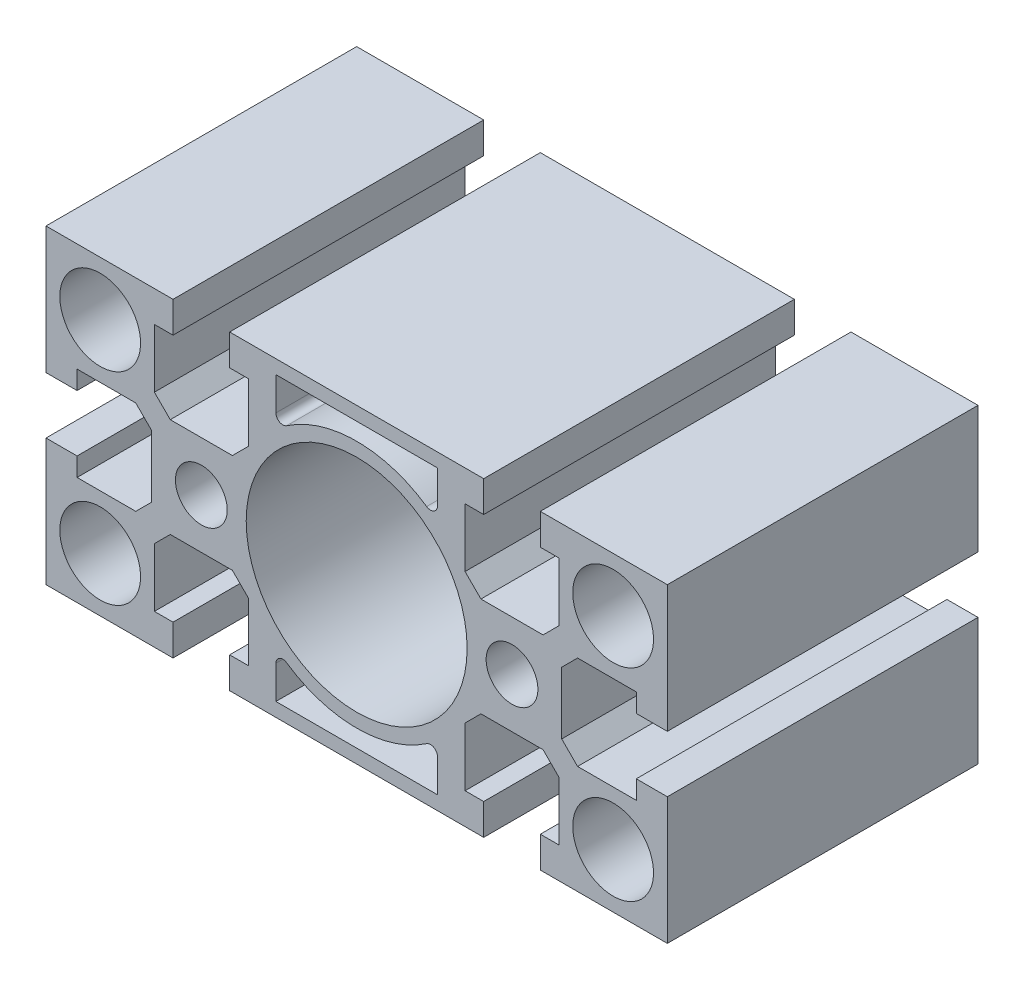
ISO-10303-21;
HEADER;
FILE_DESCRIPTION(('STEP AP214'),'2;1');
FILE_NAME('part.step','',(''),(''),'','','');
FILE_SCHEMA(('AUTOMOTIVE_DESIGN { 1 0 10303 214 1 1 1 1 }'));
ENDSEC;
DATA;
#1=APPLICATION_CONTEXT('core data for automotive mechanical design processes');
#2=APPLICATION_PROTOCOL_DEFINITION('international standard','automotive_design',2000,#1);
#3=PRODUCT_CONTEXT('',#1,'mechanical');
#4=PRODUCT('Part','Part','',(#3));
#5=PRODUCT_RELATED_PRODUCT_CATEGORY('part','',(#4));
#6=PRODUCT_DEFINITION_FORMATION('','',#4);
#7=PRODUCT_DEFINITION_CONTEXT('part definition',#1,'design');
#8=PRODUCT_DEFINITION('design','',#6,#7);
#9=PRODUCT_DEFINITION_SHAPE('','',#8);
#10=(LENGTH_UNIT() NAMED_UNIT(*) SI_UNIT(.MILLI.,.METRE.));
#11=(NAMED_UNIT(*) PLANE_ANGLE_UNIT() SI_UNIT($,.RADIAN.));
#12=(NAMED_UNIT(*) SI_UNIT($,.STERADIAN.) SOLID_ANGLE_UNIT());
#13=UNCERTAINTY_MEASURE_WITH_UNIT(LENGTH_MEASURE(1.E-05),#10,'distance_accuracy_value','');
#14=(GEOMETRIC_REPRESENTATION_CONTEXT(3) GLOBAL_UNCERTAINTY_ASSIGNED_CONTEXT((#13)) GLOBAL_UNIT_ASSIGNED_CONTEXT((#10,
#11,#12)) REPRESENTATION_CONTEXT('',''));
#15=CARTESIAN_POINT('',(0.,0.,0.));
#16=DIRECTION('',(0.,0.,1.));
#17=DIRECTION('',(1.,0.,0.));
#18=AXIS2_PLACEMENT_3D('',#15,#16,#17);
#19=CARTESIAN_POINT('',(22.5,0.,45.));
#20=DIRECTION('',(0.,0.,-1.));
#21=DIRECTION('',(-1.,0.,0.));
#22=AXIS2_PLACEMENT_3D('',#19,#20,#21);
#23=CYLINDRICAL_SURFACE('',#22,3.75000000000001);
#24=CARTESIAN_POINT('',(18.75,0.,26.6));
#25=CARTESIAN_POINT('',(18.7499957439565,-0.0864662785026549,26.6000041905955));
#26=CARTESIAN_POINT('',(18.7529935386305,-0.172900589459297,26.5972615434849));
#27=CARTESIAN_POINT('',(18.7649122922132,-0.345044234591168,26.5863643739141));
#28=CARTESIAN_POINT('',(18.7738343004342,-0.430753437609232,26.5782088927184));
#29=CARTESIAN_POINT('',(18.7974372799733,-0.60074745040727,26.5566547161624));
#30=CARTESIAN_POINT('',(18.8121212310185,-0.685031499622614,26.5432533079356));
#31=CARTESIAN_POINT('',(18.8469657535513,-0.85152182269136,26.511497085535));
#32=CARTESIAN_POINT('',(18.8671287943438,-0.933727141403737,26.4931400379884));
#33=CARTESIAN_POINT('',(18.9350279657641,-1.17526288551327,26.4314326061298));
#34=CARTESIAN_POINT('',(18.9903629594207,-1.33081824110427,26.3812723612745));
#35=CARTESIAN_POINT('',(19.1181816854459,-1.62854709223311,26.2660903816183));
#36=CARTESIAN_POINT('',(19.1906722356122,-1.77071523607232,26.2010627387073));
#37=CARTESIAN_POINT('',(19.3818362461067,-2.09467856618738,26.0309774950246));
#38=CARTESIAN_POINT('',(19.5073770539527,-2.2695317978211,25.9203197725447));
#39=CARTESIAN_POINT('',(19.7117377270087,-2.50982640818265,25.7435707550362));
#40=CARTESIAN_POINT('',(19.7826625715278,-2.58636790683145,25.6827519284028));
#41=CARTESIAN_POINT('',(19.9293959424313,-2.73224797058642,25.5584278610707));
#42=CARTESIAN_POINT('',(20.0052028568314,-2.80158889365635,25.494923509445));
#43=CARTESIAN_POINT('',(20.1632403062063,-2.93479195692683,25.3645935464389));
#44=CARTESIAN_POINT('',(20.2455828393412,-2.99847784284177,25.2977246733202));
#45=CARTESIAN_POINT('',(20.4148165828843,-3.11853669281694,25.1632398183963));
#46=CARTESIAN_POINT('',(20.5017067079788,-3.17491139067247,25.0956240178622));
#47=CARTESIAN_POINT('',(20.6799900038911,-3.28036242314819,24.9609993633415));
#48=CARTESIAN_POINT('',(20.7713757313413,-3.32945031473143,24.8939897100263));
#49=CARTESIAN_POINT('',(20.9591235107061,-3.42039151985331,24.7621498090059));
#50=CARTESIAN_POINT('',(21.0554827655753,-3.46224884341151,24.6973183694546));
#51=CARTESIAN_POINT('',(21.2520050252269,-3.53777845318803,24.5734684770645));
#52=CARTESIAN_POINT('',(21.3520536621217,-3.5715974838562,24.5143598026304));
#53=CARTESIAN_POINT('',(21.5588070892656,-3.63156135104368,24.4041224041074));
#54=CARTESIAN_POINT('',(21.6655108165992,-3.65770740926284,24.3529924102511));
#55=CARTESIAN_POINT('',(21.8678950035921,-3.69752649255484,24.2720034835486));
#56=CARTESIAN_POINT('',(21.9624236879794,-3.71255585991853,24.24001541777));
#57=CARTESIAN_POINT('',(22.1558828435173,-3.73543830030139,24.1903464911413));
#58=CARTESIAN_POINT('',(22.2547969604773,-3.74331601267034,24.1726165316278));
#59=CARTESIAN_POINT('',(22.4556487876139,-3.75109247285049,24.1551217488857));
#60=CARTESIAN_POINT('',(22.5576069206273,-3.75091002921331,24.1555397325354));
#61=CARTESIAN_POINT('',(22.7595038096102,-3.74238303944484,24.1747093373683));
#62=CARTESIAN_POINT('',(22.8594377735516,-3.73402101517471,24.1935002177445));
#63=CARTESIAN_POINT('',(23.0836103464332,-3.70651314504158,24.2530195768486));
#64=CARTESIAN_POINT('',(23.2061758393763,-3.68488953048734,24.2986292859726));
#65=CARTESIAN_POINT('',(23.4428602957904,-3.63157686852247,24.4039805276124));
#66=CARTESIAN_POINT('',(23.5569422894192,-3.59984662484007,24.4637796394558));
#67=CARTESIAN_POINT('',(23.7766998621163,-3.52785398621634,24.5903397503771));
#68=CARTESIAN_POINT('',(23.8824433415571,-3.48767308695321,24.6570313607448));
#69=CARTESIAN_POINT('',(24.0879381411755,-3.39904121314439,24.7941669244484));
#70=CARTESIAN_POINT('',(24.1876842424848,-3.35058317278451,24.864614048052));
#71=CARTESIAN_POINT('',(24.3819094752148,-3.2454763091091,25.0069359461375));
#72=CARTESIAN_POINT('',(24.4763817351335,-3.18881713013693,25.0788124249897));
#73=CARTESIAN_POINT('',(24.6601701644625,-3.06729495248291,25.2222310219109));
#74=CARTESIAN_POINT('',(24.7494861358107,-3.00243163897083,25.2937731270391));
#75=CARTESIAN_POINT('',(24.9290831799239,-2.85939845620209,25.4402480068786));
#76=CARTESIAN_POINT('',(25.0189741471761,-2.78060791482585,25.5150560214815));
#77=CARTESIAN_POINT('',(25.1922479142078,-2.61320007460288,25.6612564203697));
#78=CARTESIAN_POINT('',(25.2756288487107,-2.52457997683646,25.7326478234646));
#79=CARTESIAN_POINT('',(25.4347494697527,-2.33768078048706,25.8702621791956));
#80=CARTESIAN_POINT('',(25.5105140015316,-2.23943529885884,25.9365017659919));
#81=CARTESIAN_POINT('',(25.6535411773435,-2.03308430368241,26.0624678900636));
#82=CARTESIAN_POINT('',(25.7208059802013,-1.92498130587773,26.1221960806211));
#83=CARTESIAN_POINT('',(25.8618309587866,-1.66946373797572,26.2480856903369));
#84=CARTESIAN_POINT('',(25.9326555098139,-1.51918230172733,26.3118152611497));
#85=CARTESIAN_POINT('',(26.0550907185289,-1.20504287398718,26.4224330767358));
#86=CARTESIAN_POINT('',(26.1067152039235,-1.04119475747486,26.4693334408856));
#87=CARTESIAN_POINT('',(26.1674208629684,-0.787534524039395,26.5246004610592));
#88=CARTESIAN_POINT('',(26.1849061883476,-0.701277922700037,26.5405444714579));
#89=CARTESIAN_POINT('',(26.2138409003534,-0.526949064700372,26.5669494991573));
#90=CARTESIAN_POINT('',(26.2252932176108,-0.438877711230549,26.5774131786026));
#91=CARTESIAN_POINT('',(26.241917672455,-0.261666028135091,26.592607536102));
#92=CARTESIAN_POINT('',(26.2470910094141,-0.17252590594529,26.5973393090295));
#93=CARTESIAN_POINT('',(26.2510597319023,0.00598624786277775,26.6009693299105));
#94=CARTESIAN_POINT('',(26.2498557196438,0.0953582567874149,26.5998681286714));
#95=CARTESIAN_POINT('',(26.2376488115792,0.342823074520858,26.5887041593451));
#96=CARTESIAN_POINT('',(26.219762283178,0.500383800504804,26.5723460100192));
#97=CARTESIAN_POINT('',(26.1650173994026,0.809207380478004,26.522403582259));
#98=CARTESIAN_POINT('',(26.1281564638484,0.960469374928,26.4888169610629));
#99=CARTESIAN_POINT('',(26.0366623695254,1.25659656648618,26.4057779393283));
#100=CARTESIAN_POINT('',(25.9816713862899,1.40126004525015,26.3560063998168));
#101=CARTESIAN_POINT('',(25.8567978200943,1.67856770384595,26.2436423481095));
#102=CARTESIAN_POINT('',(25.7869084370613,1.81120635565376,26.181043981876));
#103=CARTESIAN_POINT('',(25.5965024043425,2.12674931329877,26.0118407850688));
#104=CARTESIAN_POINT('',(25.4681520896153,2.30159421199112,25.89888967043));
#105=CARTESIAN_POINT('',(25.2594866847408,2.54146516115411,25.7188576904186));
#106=CARTESIAN_POINT('',(25.1870987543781,2.61780480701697,25.6569602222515));
#107=CARTESIAN_POINT('',(25.0373854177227,2.76315840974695,25.5305461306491));
#108=CARTESIAN_POINT('',(24.9600607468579,2.83217345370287,25.466029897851));
#109=CARTESIAN_POINT('',(24.7989493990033,2.96453500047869,25.3338128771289));
#110=CARTESIAN_POINT('',(24.7150526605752,3.02770728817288,25.2660728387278));
#111=CARTESIAN_POINT('',(24.5426016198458,3.14662506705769,25.1300016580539));
#112=CARTESIAN_POINT('',(24.4540472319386,3.20237042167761,25.061670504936));
#113=CARTESIAN_POINT('',(24.2723260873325,3.30640380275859,24.9258998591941));
#114=CARTESIAN_POINT('',(24.1791684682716,3.35470587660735,24.858458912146));
#115=CARTESIAN_POINT('',(23.9876717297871,3.44390597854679,24.7261759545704));
#116=CARTESIAN_POINT('',(23.889335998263,3.48480877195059,24.6613322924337));
#117=CARTESIAN_POINT('',(23.6921576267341,3.55691866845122,24.5403448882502));
#118=CARTESIAN_POINT('',(23.5936416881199,3.58853592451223,24.4839186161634));
#119=CARTESIAN_POINT('',(23.3901402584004,3.64434795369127,24.3794207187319));
#120=CARTESIAN_POINT('',(23.2851576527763,3.66854600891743,24.3313454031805));
#121=CARTESIAN_POINT('',(23.0861195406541,3.7050517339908,24.2561476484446));
#122=CARTESIAN_POINT('',(22.9931501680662,3.71866755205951,24.2268703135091));
#123=CARTESIAN_POINT('',(22.80325077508,3.7389289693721,24.1825657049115));
#124=CARTESIAN_POINT('',(22.7063344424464,3.74559682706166,24.1674929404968));
#125=CARTESIAN_POINT('',(22.510263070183,3.75127490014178,24.1546922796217));
#126=CARTESIAN_POINT('',(22.411096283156,3.75022296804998,24.1571051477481));
#127=CARTESIAN_POINT('',(22.2149885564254,3.74045041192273,24.1790321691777));
#128=CARTESIAN_POINT('',(22.1180531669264,3.7317124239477,24.1985850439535));
#129=CARTESIAN_POINT('',(21.8946112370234,3.70309661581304,24.2602723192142));
#130=CARTESIAN_POINT('',(21.7701021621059,3.68033130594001,24.3080188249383));
#131=CARTESIAN_POINT('',(21.5298211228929,3.62444384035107,24.4176032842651));
#132=CARTESIAN_POINT('',(21.4140873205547,3.59127934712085,24.4794985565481));
#133=CARTESIAN_POINT('',(21.1915136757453,3.51624175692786,24.6098955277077));
#134=CARTESIAN_POINT('',(21.0845836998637,3.47447805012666,24.6783089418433));
#135=CARTESIAN_POINT('',(20.8768280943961,3.38241495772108,24.8186920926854));
#136=CARTESIAN_POINT('',(20.7760076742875,3.33210842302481,24.8906647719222));
#137=CARTESIAN_POINT('',(20.5797620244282,3.223010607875,25.0358364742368));
#138=CARTESIAN_POINT('',(20.4843441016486,3.16420820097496,25.1090369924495));
#139=CARTESIAN_POINT('',(20.2988473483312,3.03809182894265,25.2548677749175));
#140=CARTESIAN_POINT('',(20.2087684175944,2.97077802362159,25.3274980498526));
#141=CARTESIAN_POINT('',(20.0285791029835,2.82294202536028,25.4753330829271));
#142=CARTESIAN_POINT('',(19.9388261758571,2.74185407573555,25.5504106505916));
#143=CARTESIAN_POINT('',(19.7660678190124,2.56962899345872,25.6968405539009));
#144=CARTESIAN_POINT('',(19.6830643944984,2.47848889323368,25.7681917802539));
#145=CARTESIAN_POINT('',(19.5250099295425,2.28634029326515,25.9053682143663));
#146=CARTESIAN_POINT('',(19.4499338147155,2.18536497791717,25.9712107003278));
#147=CARTESIAN_POINT('',(19.3087307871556,1.97344885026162,26.0959151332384));
#148=CARTESIAN_POINT('',(19.2425969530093,1.8625158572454,26.1547824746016));
#149=CARTESIAN_POINT('',(19.1062665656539,1.60351004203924,26.2767432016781));
#150=CARTESIAN_POINT('',(19.038816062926,1.45286282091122,26.3375366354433));
#151=CARTESIAN_POINT('',(18.9232244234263,1.13887910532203,26.4421082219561));
#152=CARTESIAN_POINT('',(18.8750526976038,0.975563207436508,26.4859133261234));
#153=CARTESIAN_POINT('',(18.8091630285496,0.6769216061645,26.5459411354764));
#154=CARTESIAN_POINT('',(18.7870772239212,0.543340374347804,26.5661113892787));
#155=CARTESIAN_POINT('',(18.7574986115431,0.273146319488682,26.5931379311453));
#156=CARTESIAN_POINT('',(18.7500067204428,0.136533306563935,26.5999933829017));
#157=CARTESIAN_POINT('',(18.75,0.,26.6));
#158=B_SPLINE_CURVE_WITH_KNOTS('',3,(#24,#25,#26,#27,#28,#29,#30,#31,#32,#33,#34,#35,#36,#37,
#38,#39,#40,#41,#42,#43,#44,#45,#46,#47,#48,#49,#50,#51,#52,#53,#54,#55,#56,#57,#58,#59,#60,#61,
#62,#63,#64,#65,#66,#67,#68,#69,#70,#71,#72,#73,#74,#75,#76,#77,#78,#79,#80,#81,#82,#83,#84,#85,
#86,#87,#88,#89,#90,#91,#92,#93,#94,#95,#96,#97,#98,#99,#100,#101,#102,#103,#104,#105,#106,#107,
#108,#109,#110,#111,#112,#113,#114,#115,#116,#117,#118,#119,#120,#121,#122,#123,#124,#125,#126,
#127,#128,#129,#130,#131,#132,#133,#134,#135,#136,#137,#138,#139,#140,#141,#142,#143,#144,#145,
#146,#147,#148,#149,#150,#151,#152,#153,#154,#155,#156,#157),.UNSPECIFIED.,.T.,.F.,(4,2,2,2,2,2,
2,2,2,2,2,2,2,2,2,2,2,2,2,2,2,2,2,2,2,2,2,2,2,2,2,2,2,2,2,2,2,2,2,2,2,2,2,2,2,2,2,2,2,2,2,2,2,2,
2,2,2,2,2,2,2,2,2,2,2,2,4),(0.,0.259248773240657,0.518543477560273,0.777972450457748,
1.03751853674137,1.55267358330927,2.06803370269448,2.78985647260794,3.151958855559,
3.5139422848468,3.88481070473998,4.25559101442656,4.6257768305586,4.99575668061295,
5.35834905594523,5.72088366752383,6.02262829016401,6.32332933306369,6.62706007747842,
6.93144125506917,7.32688396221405,7.72395964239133,8.11736854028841,8.51111496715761,
8.90536299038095,9.29962614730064,9.72216262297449,10.1448197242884,10.5660500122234,
10.9871730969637,11.5189241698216,12.0502915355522,12.3182922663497,12.5861626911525,
12.8539819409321,13.1217759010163,13.5975375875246,14.0733639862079,14.5592080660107,
15.0452743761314,15.7745659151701,16.1405121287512,16.5064039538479,16.881012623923,
17.2556281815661,17.6295278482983,18.0031858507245,18.3562479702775,18.7091536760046,
19.0033719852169,19.2966448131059,19.592281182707,19.888587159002,20.2921516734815,
20.6973810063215,21.0977428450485,21.4984413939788,21.8996695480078,22.3008901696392,
22.7274554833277,23.1541470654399,23.5794458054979,24.0044134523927,24.5300087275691,
25.0547667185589,25.4641039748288,25.873466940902),.UNSPECIFIED.);
#159=CARTESIAN_POINT('',(18.75,0.,26.6));
#160=VERTEX_POINT('',#159);
#161=EDGE_CURVE('E34',#160,#160,#158,.T.);
#162=ORIENTED_EDGE('',*,*,#161,.F.);
#163=EDGE_LOOP('',(#162));
#164=FACE_BOUND('',#163,.T.);
#165=CARTESIAN_POINT('',(22.5,0.,45.));
#166=DIRECTION('',(0.,0.,1.));
#167=DIRECTION('',(1.,0.,0.));
#168=AXIS2_PLACEMENT_3D('',#165,#166,#167);
#169=CIRCLE('',#168,3.75000000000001);
#170=CARTESIAN_POINT('',(26.25,0.,45.));
#171=VERTEX_POINT('',#170);
#172=EDGE_CURVE('E563',#171,#171,#169,.T.);
#173=ORIENTED_EDGE('',*,*,#172,.T.);
#174=EDGE_LOOP('',(#173));
#175=FACE_BOUND('',#174,.T.);
#176=ADVANCED_FACE('F30',(#164,#175),#23,.F.);
#177=CARTESIAN_POINT('',(40.5,6.80000000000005,45.));
#178=DIRECTION('',(0.,0.,-1.));
#179=DIRECTION('',(-1.,0.,0.));
#180=AXIS2_PLACEMENT_3D('',#177,#178,#179);
#181=PLANE('',#180);
#182=ORIENTED_EDGE('',*,*,#172,.F.);
#183=EDGE_LOOP('',(#182));
#184=FACE_BOUND('',#183,.T.);
#185=CARTESIAN_POINT('',(0.,1.065814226E-13,45.));
#186=DIRECTION('',(0.,0.,1.));
#187=DIRECTION('',(1.,0.,0.));
#188=AXIS2_PLACEMENT_3D('',#185,#186,#187);
#189=CIRCLE('',#188,16.);
#190=CARTESIAN_POINT('',(16.,1.065814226E-13,45.));
#191=VERTEX_POINT('',#190);
#192=EDGE_CURVE('E575',#191,#191,#189,.T.);
#193=ORIENTED_EDGE('',*,*,#192,.F.);
#194=EDGE_LOOP('',(#193));
#195=FACE_BOUND('',#194,.T.);
#196=CARTESIAN_POINT('',(-37.15,14.65,45.));
#197=DIRECTION('',(0.,0.,1.));
#198=DIRECTION('',(1.,0.,0.));
#199=AXIS2_PLACEMENT_3D('',#196,#197,#198);
#200=CIRCLE('',#199,5.85);
#201=CARTESIAN_POINT('',(-43.,14.65,45.));
#202=VERTEX_POINT('',#201);
#203=EDGE_CURVE('E626',#202,#202,#200,.T.);
#204=ORIENTED_EDGE('',*,*,#203,.F.);
#205=EDGE_LOOP('',(#204));
#206=FACE_BOUND('',#205,.T.);
#207=CARTESIAN_POINT('',(37.15,-14.6499999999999,45.));
#208=DIRECTION('',(0.,0.,1.));
#209=DIRECTION('',(1.,0.,0.));
#210=AXIS2_PLACEMENT_3D('',#207,#208,#209);
#211=CIRCLE('',#210,5.85);
#212=CARTESIAN_POINT('',(31.3,-14.6499999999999,45.));
#213=VERTEX_POINT('',#212);
#214=EDGE_CURVE('E638',#213,#213,#211,.T.);
#215=ORIENTED_EDGE('',*,*,#214,.F.);
#216=EDGE_LOOP('',(#215));
#217=FACE_BOUND('',#216,.T.);
#218=DIRECTION('',(1.,0.,0.));
#219=VECTOR('',#218,1.);
#220=CARTESIAN_POINT('',(32.,6.80000000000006,45.));
#221=LINE('',#220,#219);
#222=CARTESIAN_POINT('',(32.,6.80000000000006,45.));
#223=VERTEX_POINT('',#222);
#224=CARTESIAN_POINT('',(40.5,6.80000000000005,45.));
#225=VERTEX_POINT('',#224);
#226=EDGE_CURVE('E650',#223,#225,#221,.T.);
#227=ORIENTED_EDGE('',*,*,#226,.T.);
#228=DIRECTION('',(0.,-1.,0.));
#229=VECTOR('',#228,1.);
#230=CARTESIAN_POINT('',(40.5,6.80000000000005,45.));
#231=LINE('',#230,#229);
#232=CARTESIAN_POINT('',(40.5,4.10000000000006,45.));
#233=VERTEX_POINT('',#232);
#234=EDGE_CURVE('E653',#225,#233,#231,.T.);
#235=ORIENTED_EDGE('',*,*,#234,.T.);
#236=DIRECTION('',(1.,0.,0.));
#237=VECTOR('',#236,1.);
#238=CARTESIAN_POINT('',(40.5,4.10000000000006,45.));
#239=LINE('',#238,#237);
#240=CARTESIAN_POINT('',(45.,4.10000000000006,45.));
#241=VERTEX_POINT('',#240);
#242=EDGE_CURVE('E656',#233,#241,#239,.T.);
#243=ORIENTED_EDGE('',*,*,#242,.T.);
#244=DIRECTION('',(0.,1.,0.));
#245=VECTOR('',#244,1.);
#246=CARTESIAN_POINT('',(45.,4.10000000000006,45.));
#247=LINE('',#246,#245);
#248=CARTESIAN_POINT('',(45.,22.5,45.));
#249=VERTEX_POINT('',#248);
#250=EDGE_CURVE('E658',#241,#249,#247,.T.);
#251=ORIENTED_EDGE('',*,*,#250,.T.);
#252=DIRECTION('',(-1.,0.,0.));
#253=VECTOR('',#252,1.);
#254=CARTESIAN_POINT('',(45.,22.5,45.));
#255=LINE('',#254,#253);
#256=CARTESIAN_POINT('',(26.6,22.5000000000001,45.));
#257=VERTEX_POINT('',#256);
#258=EDGE_CURVE('E660',#249,#257,#255,.T.);
#259=ORIENTED_EDGE('',*,*,#258,.T.);
#260=DIRECTION('',(0.,-1.,0.));
#261=VECTOR('',#260,1.);
#262=CARTESIAN_POINT('',(26.6,22.5000000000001,45.));
#263=LINE('',#262,#261);
#264=CARTESIAN_POINT('',(26.6,18.,45.));
#265=VERTEX_POINT('',#264);
#266=EDGE_CURVE('E662',#257,#265,#263,.T.);
#267=ORIENTED_EDGE('',*,*,#266,.T.);
#268=DIRECTION('',(1.,0.,0.));
#269=VECTOR('',#268,1.);
#270=CARTESIAN_POINT('',(26.6,18.,45.));
#271=LINE('',#270,#269);
#272=CARTESIAN_POINT('',(29.3,18.0000000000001,45.));
#273=VERTEX_POINT('',#272);
#274=EDGE_CURVE('E664',#265,#273,#271,.T.);
#275=ORIENTED_EDGE('',*,*,#274,.T.);
#276=DIRECTION('',(0.,-1.,0.));
#277=VECTOR('',#276,1.);
#278=CARTESIAN_POINT('',(29.3,18.0000000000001,45.));
#279=LINE('',#278,#277);
#280=CARTESIAN_POINT('',(29.3,9.50000000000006,45.));
#281=VERTEX_POINT('',#280);
#282=EDGE_CURVE('E666',#273,#281,#279,.T.);
#283=ORIENTED_EDGE('',*,*,#282,.T.);
#284=DIRECTION('',(-0.707106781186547,-0.707106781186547,0.));
#285=VECTOR('',#284,1.);
#286=CARTESIAN_POINT('',(29.3,9.50000000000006,45.));
#287=LINE('',#286,#285);
#288=CARTESIAN_POINT('',(27.,7.20000000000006,45.));
#289=VERTEX_POINT('',#288);
#290=EDGE_CURVE('E668',#281,#289,#287,.T.);
#291=ORIENTED_EDGE('',*,*,#290,.T.);
#292=DIRECTION('',(-1.,0.,0.));
#293=VECTOR('',#292,1.);
#294=CARTESIAN_POINT('',(27.,7.20000000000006,45.));
#295=LINE('',#294,#293);
#296=CARTESIAN_POINT('',(18.,7.20000000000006,45.));
#297=VERTEX_POINT('',#296);
#298=EDGE_CURVE('E670',#289,#297,#295,.T.);
#299=ORIENTED_EDGE('',*,*,#298,.T.);
#300=DIRECTION('',(-0.707106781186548,0.707106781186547,0.));
#301=VECTOR('',#300,1.);
#302=CARTESIAN_POINT('',(18.,7.20000000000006,45.));
#303=LINE('',#302,#301);
#304=CARTESIAN_POINT('',(15.6999999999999,9.5000000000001,45.));
#305=VERTEX_POINT('',#304);
#306=EDGE_CURVE('E672',#297,#305,#303,.T.);
#307=ORIENTED_EDGE('',*,*,#306,.T.);
#308=DIRECTION('',(0.,1.,0.));
#309=VECTOR('',#308,1.);
#310=CARTESIAN_POINT('',(15.6999999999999,9.5000000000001,45.));
#311=LINE('',#310,#309);
#312=CARTESIAN_POINT('',(15.6999999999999,18.0000000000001,45.));
#313=VERTEX_POINT('',#312);
#314=EDGE_CURVE('E674',#305,#313,#311,.T.);
#315=ORIENTED_EDGE('',*,*,#314,.T.);
#316=DIRECTION('',(1.,0.,0.));
#317=VECTOR('',#316,1.);
#318=CARTESIAN_POINT('',(15.6999999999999,18.0000000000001,45.));
#319=LINE('',#318,#317);
#320=CARTESIAN_POINT('',(18.4,18.0000000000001,45.));
#321=VERTEX_POINT('',#320);
#322=EDGE_CURVE('E676',#313,#321,#319,.T.);
#323=ORIENTED_EDGE('',*,*,#322,.T.);
#324=DIRECTION('',(0.,1.,0.));
#325=VECTOR('',#324,1.);
#326=CARTESIAN_POINT('',(18.4,18.0000000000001,45.));
#327=LINE('',#326,#325);
#328=CARTESIAN_POINT('',(18.4,22.5000000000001,45.));
#329=VERTEX_POINT('',#328);
#330=EDGE_CURVE('E678',#321,#329,#327,.T.);
#331=ORIENTED_EDGE('',*,*,#330,.T.);
#332=DIRECTION('',(-1.,0.,0.));
#333=VECTOR('',#332,1.);
#334=CARTESIAN_POINT('',(18.4,22.5000000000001,45.));
#335=LINE('',#334,#333);
#336=CARTESIAN_POINT('',(-18.4,22.5000000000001,45.));
#337=VERTEX_POINT('',#336);
#338=EDGE_CURVE('E680',#329,#337,#335,.T.);
#339=ORIENTED_EDGE('',*,*,#338,.T.);
#340=DIRECTION('',(0.,-1.,0.));
#341=VECTOR('',#340,1.);
#342=CARTESIAN_POINT('',(-18.4,22.5000000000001,45.));
#343=LINE('',#342,#341);
#344=CARTESIAN_POINT('',(-18.4,18.0000000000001,45.));
#345=VERTEX_POINT('',#344);
#346=EDGE_CURVE('E682',#337,#345,#343,.T.);
#347=ORIENTED_EDGE('',*,*,#346,.T.);
#348=DIRECTION('',(1.,0.,0.));
#349=VECTOR('',#348,1.);
#350=CARTESIAN_POINT('',(-18.4,18.0000000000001,45.));
#351=LINE('',#350,#349);
#352=CARTESIAN_POINT('',(-15.7,18.0000000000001,45.));
#353=VERTEX_POINT('',#352);
#354=EDGE_CURVE('E684',#345,#353,#351,.T.);
#355=ORIENTED_EDGE('',*,*,#354,.T.);
#356=DIRECTION('',(0.,-1.,0.));
#357=VECTOR('',#356,1.);
#358=CARTESIAN_POINT('',(-15.7,18.0000000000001,45.));
#359=LINE('',#358,#357);
#360=CARTESIAN_POINT('',(-15.7,9.50000000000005,45.));
#361=VERTEX_POINT('',#360);
#362=EDGE_CURVE('E686',#353,#361,#359,.T.);
#363=ORIENTED_EDGE('',*,*,#362,.T.);
#364=DIRECTION('',(-0.70710678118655,-0.707106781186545,0.));
#365=VECTOR('',#364,1.);
#366=CARTESIAN_POINT('',(-15.7,9.50000000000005,45.));
#367=LINE('',#366,#365);
#368=CARTESIAN_POINT('',(-18.,7.20000000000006,45.));
#369=VERTEX_POINT('',#368);
#370=EDGE_CURVE('E688',#361,#369,#367,.T.);
#371=ORIENTED_EDGE('',*,*,#370,.T.);
#372=DIRECTION('',(-1.,0.,0.));
#373=VECTOR('',#372,1.);
#374=CARTESIAN_POINT('',(-18.,7.20000000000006,45.));
#375=LINE('',#374,#373);
#376=CARTESIAN_POINT('',(-27.,7.20000000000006,45.));
#377=VERTEX_POINT('',#376);
#378=EDGE_CURVE('E690',#369,#377,#375,.T.);
#379=ORIENTED_EDGE('',*,*,#378,.T.);
#380=DIRECTION('',(-0.707106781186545,0.70710678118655,0.));
#381=VECTOR('',#380,1.);
#382=CARTESIAN_POINT('',(-27.,7.20000000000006,45.));
#383=LINE('',#382,#381);
#384=CARTESIAN_POINT('',(-29.3,9.50000000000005,45.));
#385=VERTEX_POINT('',#384);
#386=EDGE_CURVE('E692',#377,#385,#383,.T.);
#387=ORIENTED_EDGE('',*,*,#386,.T.);
#388=DIRECTION('',(0.,1.,0.));
#389=VECTOR('',#388,1.);
#390=CARTESIAN_POINT('',(-29.3,9.50000000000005,45.));
#391=LINE('',#390,#389);
#392=CARTESIAN_POINT('',(-29.3,18.0000000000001,45.));
#393=VERTEX_POINT('',#392);
#394=EDGE_CURVE('E694',#385,#393,#391,.T.);
#395=ORIENTED_EDGE('',*,*,#394,.T.);
#396=DIRECTION('',(1.,0.,0.));
#397=VECTOR('',#396,1.);
#398=CARTESIAN_POINT('',(-29.3,18.0000000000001,45.));
#399=LINE('',#398,#397);
#400=CARTESIAN_POINT('',(-26.6000000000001,18.0000000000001,45.));
#401=VERTEX_POINT('',#400);
#402=EDGE_CURVE('E696',#393,#401,#399,.T.);
#403=ORIENTED_EDGE('',*,*,#402,.T.);
#404=DIRECTION('',(0.,1.,0.));
#405=VECTOR('',#404,1.);
#406=CARTESIAN_POINT('',(-26.6000000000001,18.0000000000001,45.));
#407=LINE('',#406,#405);
#408=CARTESIAN_POINT('',(-26.6000000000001,22.5,45.));
#409=VERTEX_POINT('',#408);
#410=EDGE_CURVE('E698',#401,#409,#407,.T.);
#411=ORIENTED_EDGE('',*,*,#410,.T.);
#412=DIRECTION('',(-1.,0.,0.));
#413=VECTOR('',#412,1.);
#414=CARTESIAN_POINT('',(-26.6000000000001,22.5,45.));
#415=LINE('',#414,#413);
#416=CARTESIAN_POINT('',(-45.,22.5,45.));
#417=VERTEX_POINT('',#416);
#418=EDGE_CURVE('E700',#409,#417,#415,.T.);
#419=ORIENTED_EDGE('',*,*,#418,.T.);
#420=DIRECTION('',(0.,-1.,0.));
#421=VECTOR('',#420,1.);
#422=CARTESIAN_POINT('',(-45.,22.5,45.));
#423=LINE('',#422,#421);
#424=CARTESIAN_POINT('',(-45.,4.10000000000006,45.));
#425=VERTEX_POINT('',#424);
#426=EDGE_CURVE('E702',#417,#425,#423,.T.);
#427=ORIENTED_EDGE('',*,*,#426,.T.);
#428=DIRECTION('',(1.,0.,0.));
#429=VECTOR('',#428,1.);
#430=CARTESIAN_POINT('',(-45.,4.10000000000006,45.));
#431=LINE('',#430,#429);
#432=CARTESIAN_POINT('',(-40.5,4.10000000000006,45.));
#433=VERTEX_POINT('',#432);
#434=EDGE_CURVE('E704',#425,#433,#431,.T.);
#435=ORIENTED_EDGE('',*,*,#434,.T.);
#436=DIRECTION('',(0.,1.,0.));
#437=VECTOR('',#436,1.);
#438=CARTESIAN_POINT('',(-40.5,4.10000000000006,45.));
#439=LINE('',#438,#437);
#440=CARTESIAN_POINT('',(-40.5,6.80000000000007,45.));
#441=VERTEX_POINT('',#440);
#442=EDGE_CURVE('E706',#433,#441,#439,.T.);
#443=ORIENTED_EDGE('',*,*,#442,.T.);
#444=DIRECTION('',(1.,0.,0.));
#445=VECTOR('',#444,1.);
#446=CARTESIAN_POINT('',(-40.5,6.80000000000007,45.));
#447=LINE('',#446,#445);
#448=CARTESIAN_POINT('',(-32.,6.80000000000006,45.));
#449=VERTEX_POINT('',#448);
#450=EDGE_CURVE('E708',#441,#449,#447,.T.);
#451=ORIENTED_EDGE('',*,*,#450,.T.);
#452=DIRECTION('',(0.70710678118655,-0.707106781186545,0.));
#453=VECTOR('',#452,1.);
#454=CARTESIAN_POINT('',(-32.,6.80000000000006,45.));
#455=LINE('',#454,#453);
#456=CARTESIAN_POINT('',(-29.7,4.50000000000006,45.));
#457=VERTEX_POINT('',#456);
#458=EDGE_CURVE('E710',#449,#457,#455,.T.);
#459=ORIENTED_EDGE('',*,*,#458,.T.);
#460=DIRECTION('',(0.,-1.,0.));
#461=VECTOR('',#460,1.);
#462=CARTESIAN_POINT('',(-29.7,4.50000000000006,45.));
#463=LINE('',#462,#461);
#464=CARTESIAN_POINT('',(-29.7,-4.49999999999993,45.));
#465=VERTEX_POINT('',#464);
#466=EDGE_CURVE('E712',#457,#465,#463,.T.);
#467=ORIENTED_EDGE('',*,*,#466,.T.);
#468=DIRECTION('',(-0.707106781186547,-0.707106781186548,0.));
#469=VECTOR('',#468,1.);
#470=CARTESIAN_POINT('',(-29.7,-4.49999999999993,45.));
#471=LINE('',#470,#469);
#472=CARTESIAN_POINT('',(-32.,-6.79999999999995,45.));
#473=VERTEX_POINT('',#472);
#474=EDGE_CURVE('E714',#465,#473,#471,.T.);
#475=ORIENTED_EDGE('',*,*,#474,.T.);
#476=DIRECTION('',(-1.,0.,0.));
#477=VECTOR('',#476,1.);
#478=CARTESIAN_POINT('',(-32.,-6.79999999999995,45.));
#479=LINE('',#478,#477);
#480=CARTESIAN_POINT('',(-40.5,-6.79999999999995,45.));
#481=VERTEX_POINT('',#480);
#482=EDGE_CURVE('E716',#473,#481,#479,.T.);
#483=ORIENTED_EDGE('',*,*,#482,.T.);
#484=DIRECTION('',(0.,1.,0.));
#485=VECTOR('',#484,1.);
#486=CARTESIAN_POINT('',(-40.5,-6.79999999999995,45.));
#487=LINE('',#486,#485);
#488=CARTESIAN_POINT('',(-40.5,-4.09999999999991,45.));
#489=VERTEX_POINT('',#488);
#490=EDGE_CURVE('E718',#481,#489,#487,.T.);
#491=ORIENTED_EDGE('',*,*,#490,.T.);
#492=DIRECTION('',(-1.,0.,0.));
#493=VECTOR('',#492,1.);
#494=CARTESIAN_POINT('',(-40.5,-4.09999999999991,45.));
#495=LINE('',#494,#493);
#496=CARTESIAN_POINT('',(-45.,-4.09999999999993,45.));
#497=VERTEX_POINT('',#496);
#498=EDGE_CURVE('E720',#489,#497,#495,.T.);
#499=ORIENTED_EDGE('',*,*,#498,.T.);
#500=DIRECTION('',(0.,-1.,0.));
#501=VECTOR('',#500,1.);
#502=CARTESIAN_POINT('',(-45.,-4.09999999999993,45.));
#503=LINE('',#502,#501);
#504=CARTESIAN_POINT('',(-45.,-22.4999999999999,45.));
#505=VERTEX_POINT('',#504);
#506=EDGE_CURVE('E722',#497,#505,#503,.T.);
#507=ORIENTED_EDGE('',*,*,#506,.T.);
#508=DIRECTION('',(1.,0.,0.));
#509=VECTOR('',#508,1.);
#510=CARTESIAN_POINT('',(-45.,-22.4999999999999,45.));
#511=LINE('',#510,#509);
#512=CARTESIAN_POINT('',(-26.6000000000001,-22.4999999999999,45.));
#513=VERTEX_POINT('',#512);
#514=EDGE_CURVE('E724',#505,#513,#511,.T.);
#515=ORIENTED_EDGE('',*,*,#514,.T.);
#516=DIRECTION('',(0.,1.,0.));
#517=VECTOR('',#516,1.);
#518=CARTESIAN_POINT('',(-26.6000000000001,-22.4999999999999,45.));
#519=LINE('',#518,#517);
#520=CARTESIAN_POINT('',(-26.6,-17.9999999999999,45.));
#521=VERTEX_POINT('',#520);
#522=EDGE_CURVE('E726',#513,#521,#519,.T.);
#523=ORIENTED_EDGE('',*,*,#522,.T.);
#524=DIRECTION('',(-1.,0.,0.));
#525=VECTOR('',#524,1.);
#526=CARTESIAN_POINT('',(-26.6,-17.9999999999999,45.));
#527=LINE('',#526,#525);
#528=CARTESIAN_POINT('',(-29.3,-17.9999999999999,45.));
#529=VERTEX_POINT('',#528);
#530=EDGE_CURVE('E728',#521,#529,#527,.T.);
#531=ORIENTED_EDGE('',*,*,#530,.T.);
#532=DIRECTION('',(0.,1.,0.));
#533=VECTOR('',#532,1.);
#534=CARTESIAN_POINT('',(-29.3,-17.9999999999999,45.));
#535=LINE('',#534,#533);
#536=CARTESIAN_POINT('',(-29.3,-9.49999999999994,45.));
#537=VERTEX_POINT('',#536);
#538=EDGE_CURVE('E730',#529,#537,#535,.T.);
#539=ORIENTED_EDGE('',*,*,#538,.T.);
#540=DIRECTION('',(0.707106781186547,0.707106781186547,0.));
#541=VECTOR('',#540,1.);
#542=CARTESIAN_POINT('',(-29.3,-9.49999999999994,45.));
#543=LINE('',#542,#541);
#544=CARTESIAN_POINT('',(-27.,-7.19999999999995,45.));
#545=VERTEX_POINT('',#544);
#546=EDGE_CURVE('E732',#537,#545,#543,.T.);
#547=ORIENTED_EDGE('',*,*,#546,.T.);
#548=DIRECTION('',(1.,0.,0.));
#549=VECTOR('',#548,1.);
#550=CARTESIAN_POINT('',(-27.,-7.19999999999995,45.));
#551=LINE('',#550,#549);
#552=CARTESIAN_POINT('',(-18.,-7.19999999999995,45.));
#553=VERTEX_POINT('',#552);
#554=EDGE_CURVE('E734',#545,#553,#551,.T.);
#555=ORIENTED_EDGE('',*,*,#554,.T.);
#556=DIRECTION('',(0.70710678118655,-0.707106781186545,0.));
#557=VECTOR('',#556,1.);
#558=CARTESIAN_POINT('',(-18.,-7.19999999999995,45.));
#559=LINE('',#558,#557);
#560=CARTESIAN_POINT('',(-15.7,-9.49999999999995,45.));
#561=VERTEX_POINT('',#560);
#562=EDGE_CURVE('E736',#553,#561,#559,.T.);
#563=ORIENTED_EDGE('',*,*,#562,.T.);
#564=DIRECTION('',(0.,-1.,0.));
#565=VECTOR('',#564,1.);
#566=CARTESIAN_POINT('',(-15.7,-9.49999999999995,45.));
#567=LINE('',#566,#565);
#568=CARTESIAN_POINT('',(-15.7,-18.,45.));
#569=VERTEX_POINT('',#568);
#570=EDGE_CURVE('E738',#561,#569,#567,.T.);
#571=ORIENTED_EDGE('',*,*,#570,.T.);
#572=DIRECTION('',(-1.,0.,0.));
#573=VECTOR('',#572,1.);
#574=CARTESIAN_POINT('',(-15.7,-18.,45.));
#575=LINE('',#574,#573);
#576=CARTESIAN_POINT('',(-18.4,-18.,45.));
#577=VERTEX_POINT('',#576);
#578=EDGE_CURVE('E740',#569,#577,#575,.T.);
#579=ORIENTED_EDGE('',*,*,#578,.T.);
#580=DIRECTION('',(0.,-1.,0.));
#581=VECTOR('',#580,1.);
#582=CARTESIAN_POINT('',(-18.4,-18.,45.));
#583=LINE('',#582,#581);
#584=CARTESIAN_POINT('',(-18.4,-22.4999999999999,45.));
#585=VERTEX_POINT('',#584);
#586=EDGE_CURVE('E742',#577,#585,#583,.T.);
#587=ORIENTED_EDGE('',*,*,#586,.T.);
#588=DIRECTION('',(1.,0.,0.));
#589=VECTOR('',#588,1.);
#590=CARTESIAN_POINT('',(-18.4,-22.4999999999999,45.));
#591=LINE('',#590,#589);
#592=CARTESIAN_POINT('',(18.4,-22.4999999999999,45.));
#593=VERTEX_POINT('',#592);
#594=EDGE_CURVE('E744',#585,#593,#591,.T.);
#595=ORIENTED_EDGE('',*,*,#594,.T.);
#596=DIRECTION('',(0.,1.,0.));
#597=VECTOR('',#596,1.);
#598=CARTESIAN_POINT('',(18.4,-22.4999999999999,45.));
#599=LINE('',#598,#597);
#600=CARTESIAN_POINT('',(18.3999999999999,-18.,45.));
#601=VERTEX_POINT('',#600);
#602=EDGE_CURVE('E746',#593,#601,#599,.T.);
#603=ORIENTED_EDGE('',*,*,#602,.T.);
#604=DIRECTION('',(-1.,0.,0.));
#605=VECTOR('',#604,1.);
#606=CARTESIAN_POINT('',(18.3999999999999,-18.,45.));
#607=LINE('',#606,#605);
#608=CARTESIAN_POINT('',(15.7000000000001,-18.,45.));
#609=VERTEX_POINT('',#608);
#610=EDGE_CURVE('E748',#601,#609,#607,.T.);
#611=ORIENTED_EDGE('',*,*,#610,.T.);
#612=DIRECTION('',(0.,1.,0.));
#613=VECTOR('',#612,1.);
#614=CARTESIAN_POINT('',(15.7000000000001,-18.,45.));
#615=LINE('',#614,#613);
#616=CARTESIAN_POINT('',(15.7000000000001,-9.49999999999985,45.));
#617=VERTEX_POINT('',#616);
#618=EDGE_CURVE('E750',#609,#617,#615,.T.);
#619=ORIENTED_EDGE('',*,*,#618,.T.);
#620=DIRECTION('',(0.70710678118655,0.707106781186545,0.));
#621=VECTOR('',#620,1.);
#622=CARTESIAN_POINT('',(15.7000000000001,-9.49999999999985,45.));
#623=LINE('',#622,#621);
#624=CARTESIAN_POINT('',(18.,-7.19999999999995,45.));
#625=VERTEX_POINT('',#624);
#626=EDGE_CURVE('E752',#617,#625,#623,.T.);
#627=ORIENTED_EDGE('',*,*,#626,.T.);
#628=DIRECTION('',(1.,0.,0.));
#629=VECTOR('',#628,1.);
#630=CARTESIAN_POINT('',(18.,-7.19999999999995,45.));
#631=LINE('',#630,#629);
#632=CARTESIAN_POINT('',(27.,-7.19999999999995,45.));
#633=VERTEX_POINT('',#632);
#634=EDGE_CURVE('E754',#625,#633,#631,.T.);
#635=ORIENTED_EDGE('',*,*,#634,.T.);
#636=DIRECTION('',(0.707106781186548,-0.707106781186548,0.));
#637=VECTOR('',#636,1.);
#638=CARTESIAN_POINT('',(27.,-7.19999999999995,45.));
#639=LINE('',#638,#637);
#640=CARTESIAN_POINT('',(29.3,-9.49999999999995,45.));
#641=VERTEX_POINT('',#640);
#642=EDGE_CURVE('E756',#633,#641,#639,.T.);
#643=ORIENTED_EDGE('',*,*,#642,.T.);
#644=DIRECTION('',(0.,-1.,0.));
#645=VECTOR('',#644,1.);
#646=CARTESIAN_POINT('',(29.3,-9.49999999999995,45.));
#647=LINE('',#646,#645);
#648=CARTESIAN_POINT('',(29.3,-17.9999999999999,45.));
#649=VERTEX_POINT('',#648);
#650=EDGE_CURVE('E758',#641,#649,#647,.T.);
#651=ORIENTED_EDGE('',*,*,#650,.T.);
#652=DIRECTION('',(-1.,0.,0.));
#653=VECTOR('',#652,1.);
#654=CARTESIAN_POINT('',(29.3,-17.9999999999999,45.));
#655=LINE('',#654,#653);
#656=CARTESIAN_POINT('',(26.6,-18.,45.));
#657=VERTEX_POINT('',#656);
#658=EDGE_CURVE('E760',#649,#657,#655,.T.);
#659=ORIENTED_EDGE('',*,*,#658,.T.);
#660=DIRECTION('',(0.,-1.,0.));
#661=VECTOR('',#660,1.);
#662=CARTESIAN_POINT('',(26.6,-18.,45.));
#663=LINE('',#662,#661);
#664=CARTESIAN_POINT('',(26.6,-22.4999999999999,45.));
#665=VERTEX_POINT('',#664);
#666=EDGE_CURVE('E762',#657,#665,#663,.T.);
#667=ORIENTED_EDGE('',*,*,#666,.T.);
#668=DIRECTION('',(1.,0.,0.));
#669=VECTOR('',#668,1.);
#670=CARTESIAN_POINT('',(26.6,-22.4999999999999,45.));
#671=LINE('',#670,#669);
#672=CARTESIAN_POINT('',(45.0000000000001,-22.4999999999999,45.));
#673=VERTEX_POINT('',#672);
#674=EDGE_CURVE('E764',#665,#673,#671,.T.);
#675=ORIENTED_EDGE('',*,*,#674,.T.);
#676=DIRECTION('',(0.,1.,0.));
#677=VECTOR('',#676,1.);
#678=CARTESIAN_POINT('',(45.0000000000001,-22.4999999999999,45.));
#679=LINE('',#678,#677);
#680=CARTESIAN_POINT('',(45.,-4.09999999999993,45.));
#681=VERTEX_POINT('',#680);
#682=EDGE_CURVE('E766',#673,#681,#679,.T.);
#683=ORIENTED_EDGE('',*,*,#682,.T.);
#684=DIRECTION('',(-1.,0.,0.));
#685=VECTOR('',#684,1.);
#686=CARTESIAN_POINT('',(45.,-4.09999999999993,45.));
#687=LINE('',#686,#685);
#688=CARTESIAN_POINT('',(40.5,-4.09999999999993,45.));
#689=VERTEX_POINT('',#688);
#690=EDGE_CURVE('E768',#681,#689,#687,.T.);
#691=ORIENTED_EDGE('',*,*,#690,.T.);
#692=DIRECTION('',(0.,-1.,0.));
#693=VECTOR('',#692,1.);
#694=CARTESIAN_POINT('',(40.5,-4.09999999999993,45.));
#695=LINE('',#694,#693);
#696=CARTESIAN_POINT('',(40.5,-6.79999999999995,45.));
#697=VERTEX_POINT('',#696);
#698=EDGE_CURVE('E770',#689,#697,#695,.T.);
#699=ORIENTED_EDGE('',*,*,#698,.T.);
#700=DIRECTION('',(-1.,0.,0.));
#701=VECTOR('',#700,1.);
#702=CARTESIAN_POINT('',(40.5,-6.79999999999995,45.));
#703=LINE('',#702,#701);
#704=CARTESIAN_POINT('',(32.,-6.79999999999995,45.));
#705=VERTEX_POINT('',#704);
#706=EDGE_CURVE('E772',#697,#705,#703,.T.);
#707=ORIENTED_EDGE('',*,*,#706,.T.);
#708=DIRECTION('',(-0.707106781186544,0.707106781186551,0.));
#709=VECTOR('',#708,1.);
#710=CARTESIAN_POINT('',(32.,-6.79999999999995,45.));
#711=LINE('',#710,#709);
#712=CARTESIAN_POINT('',(29.7,-4.49999999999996,45.));
#713=VERTEX_POINT('',#712);
#714=EDGE_CURVE('E774',#705,#713,#711,.T.);
#715=ORIENTED_EDGE('',*,*,#714,.T.);
#716=DIRECTION('',(0.,1.,0.));
#717=VECTOR('',#716,1.);
#718=CARTESIAN_POINT('',(29.7,-4.49999999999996,45.));
#719=LINE('',#718,#717);
#720=CARTESIAN_POINT('',(29.7,4.50000000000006,45.));
#721=VERTEX_POINT('',#720);
#722=EDGE_CURVE('E776',#713,#721,#719,.T.);
#723=ORIENTED_EDGE('',*,*,#722,.T.);
#724=DIRECTION('',(0.707106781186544,0.707106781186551,0.));
#725=VECTOR('',#724,1.);
#726=CARTESIAN_POINT('',(29.7,4.50000000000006,45.));
#727=LINE('',#726,#725);
#728=EDGE_CURVE('E778',#721,#223,#727,.T.);
#729=ORIENTED_EDGE('',*,*,#728,.T.);
#730=EDGE_LOOP('',(#227,#235,#243,#251,#259,#267,#275,#283,#291,#299,#307,#315,#323,#331,#339,
#347,#355,#363,#371,#379,#387,#395,#403,#411,#419,#427,#435,#443,#451,#459,#467,#475,#483,#491,
#499,#507,#515,#523,#531,#539,#547,#555,#563,#571,#579,#587,#595,#603,#611,#619,#627,#635,#643,
#651,#659,#667,#675,#683,#691,#699,#707,#715,#723,#729));
#731=FACE_BOUND('',#730,.T.);
#732=CARTESIAN_POINT('',(37.15,14.65,45.));
#733=DIRECTION('',(0.,0.,1.));
#734=DIRECTION('',(1.,0.,0.));
#735=AXIS2_PLACEMENT_3D('',#732,#733,#734);
#736=CIRCLE('',#735,5.85);
#737=CARTESIAN_POINT('',(31.3,14.65,45.));
#738=VERTEX_POINT('',#737);
#739=EDGE_CURVE('E644',#738,#738,#736,.T.);
#740=ORIENTED_EDGE('',*,*,#739,.F.);
#741=EDGE_LOOP('',(#740));
#742=FACE_BOUND('',#741,.T.);
#743=CARTESIAN_POINT('',(-37.15,-14.6499999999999,45.));
#744=DIRECTION('',(0.,0.,1.));
#745=DIRECTION('',(1.,0.,0.));
#746=AXIS2_PLACEMENT_3D('',#743,#744,#745);
#747=CIRCLE('',#746,5.85);
#748=CARTESIAN_POINT('',(-43.,-14.6499999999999,45.));
#749=VERTEX_POINT('',#748);
#750=EDGE_CURVE('E632',#749,#749,#747,.T.);
#751=ORIENTED_EDGE('',*,*,#750,.F.);
#752=EDGE_LOOP('',(#751));
#753=FACE_BOUND('',#752,.T.);
#754=CARTESIAN_POINT('',(-10.7,15.7006369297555,45.));
#755=DIRECTION('',(0.,0.,1.));
#756=DIRECTION('',(1.,0.,0.));
#757=AXIS2_PLACEMENT_3D('',#754,#755,#756);
#758=CIRCLE('',#757,0.999999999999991);
#759=CARTESIAN_POINT('',(-11.7,15.7006369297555,45.));
#760=VERTEX_POINT('',#759);
#761=CARTESIAN_POINT('',(-10.1368421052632,14.8742876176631,45.));
#762=VERTEX_POINT('',#761);
#763=EDGE_CURVE('E581',#760,#762,#758,.T.);
#764=ORIENTED_EDGE('',*,*,#763,.F.);
#765=DIRECTION('',(0.,-1.,0.));
#766=VECTOR('',#765,1.);
#767=CARTESIAN_POINT('',(-11.7,15.7006369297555,45.));
#768=LINE('',#767,#766);
#769=CARTESIAN_POINT('',(-11.7,20.5,45.));
#770=VERTEX_POINT('',#769);
#771=EDGE_CURVE('E593',#770,#760,#768,.T.);
#772=ORIENTED_EDGE('',*,*,#771,.F.);
#773=DIRECTION('',(-1.,0.,0.));
#774=VECTOR('',#773,1.);
#775=CARTESIAN_POINT('',(-11.7,20.5,45.));
#776=LINE('',#775,#774);
#777=CARTESIAN_POINT('',(11.7,20.5,45.));
#778=VERTEX_POINT('',#777);
#779=EDGE_CURVE('E590',#778,#770,#776,.T.);
#780=ORIENTED_EDGE('',*,*,#779,.F.);
#781=DIRECTION('',(0.,1.,0.));
#782=VECTOR('',#781,1.);
#783=CARTESIAN_POINT('',(11.7,20.5,45.));
#784=LINE('',#783,#782);
#785=CARTESIAN_POINT('',(11.7,15.7006369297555,45.));
#786=VERTEX_POINT('',#785);
#787=EDGE_CURVE('E588',#786,#778,#784,.T.);
#788=ORIENTED_EDGE('',*,*,#787,.F.);
#789=CARTESIAN_POINT('',(10.7,15.7006369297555,45.));
#790=DIRECTION('',(0.,0.,1.));
#791=DIRECTION('',(1.,0.,0.));
#792=AXIS2_PLACEMENT_3D('',#789,#790,#791);
#793=CIRCLE('',#792,0.999999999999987);
#794=CARTESIAN_POINT('',(10.1368421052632,14.8742876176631,45.));
#795=VERTEX_POINT('',#794);
#796=EDGE_CURVE('E586',#795,#786,#793,.T.);
#797=ORIENTED_EDGE('',*,*,#796,.F.);
#798=CARTESIAN_POINT('',(0.,1.065814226E-13,45.));
#799=DIRECTION('',(0.,0.,-1.));
#800=DIRECTION('',(1.,0.,0.));
#801=AXIS2_PLACEMENT_3D('',#798,#799,#800);
#802=CIRCLE('',#801,18.);
#803=EDGE_CURVE('E583',#762,#795,#802,.T.);
#804=ORIENTED_EDGE('',*,*,#803,.F.);
#805=EDGE_LOOP('',(#764,#772,#780,#788,#797,#804));
#806=FACE_BOUND('',#805,.T.);
#807=CARTESIAN_POINT('',(-22.5,0.,45.));
#808=DIRECTION('',(0.,0.,1.));
#809=DIRECTION('',(1.,0.,0.));
#810=AXIS2_PLACEMENT_3D('',#807,#808,#809);
#811=CIRCLE('',#810,3.75000000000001);
#812=CARTESIAN_POINT('',(-26.25,0.,45.));
#813=VERTEX_POINT('',#812);
#814=EDGE_CURVE('E569',#813,#813,#811,.T.);
#815=ORIENTED_EDGE('',*,*,#814,.F.);
#816=EDGE_LOOP('',(#815));
#817=FACE_BOUND('',#816,.T.);
#818=CARTESIAN_POINT('',(10.6999999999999,-15.7006369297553,45.));
#819=DIRECTION('',(0.,0.,1.));
#820=DIRECTION('',(1.,0.,0.));
#821=AXIS2_PLACEMENT_3D('',#818,#819,#820);
#822=CIRCLE('',#821,0.999999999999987);
#823=CARTESIAN_POINT('',(11.6999999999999,-15.7006369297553,45.));
#824=VERTEX_POINT('',#823);
#825=CARTESIAN_POINT('',(10.1368421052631,-14.874287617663,45.));
#826=VERTEX_POINT('',#825);
#827=EDGE_CURVE('E509',#824,#826,#822,.T.);
#828=ORIENTED_EDGE('',*,*,#827,.F.);
#829=DIRECTION('',(0.,1.,0.));
#830=VECTOR('',#829,1.);
#831=CARTESIAN_POINT('',(11.6999999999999,-15.7006369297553,45.));
#832=LINE('',#831,#830);
#833=CARTESIAN_POINT('',(11.6999999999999,-20.4999999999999,45.));
#834=VERTEX_POINT('',#833);
#835=EDGE_CURVE('E540',#834,#824,#832,.T.);
#836=ORIENTED_EDGE('',*,*,#835,.F.);
#837=DIRECTION('',(1.,0.,0.));
#838=VECTOR('',#837,1.);
#839=CARTESIAN_POINT('',(11.6999999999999,-20.4999999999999,45.));
#840=LINE('',#839,#838);
#841=CARTESIAN_POINT('',(-11.7000000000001,-20.4999999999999,45.));
#842=VERTEX_POINT('',#841);
#843=EDGE_CURVE('E538',#842,#834,#840,.T.);
#844=ORIENTED_EDGE('',*,*,#843,.F.);
#845=DIRECTION('',(0.,-1.,0.));
#846=VECTOR('',#845,1.);
#847=CARTESIAN_POINT('',(-11.7000000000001,-20.4999999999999,45.));
#848=LINE('',#847,#846);
#849=CARTESIAN_POINT('',(-11.7000000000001,-15.7006369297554,45.));
#850=VERTEX_POINT('',#849);
#851=EDGE_CURVE('E533',#850,#842,#848,.T.);
#852=ORIENTED_EDGE('',*,*,#851,.F.);
#853=CARTESIAN_POINT('',(-10.7000000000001,-15.7006369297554,45.));
#854=DIRECTION('',(0.,0.,1.));
#855=DIRECTION('',(1.,0.,0.));
#856=AXIS2_PLACEMENT_3D('',#853,#854,#855);
#857=CIRCLE('',#856,0.999999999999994);
#858=CARTESIAN_POINT('',(-10.1368421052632,-14.874287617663,45.));
#859=VERTEX_POINT('',#858);
#860=EDGE_CURVE('E531',#859,#850,#857,.T.);
#861=ORIENTED_EDGE('',*,*,#860,.F.);
#862=CARTESIAN_POINT('',(0.,1.065814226E-13,45.));
#863=DIRECTION('',(0.,0.,-1.));
#864=DIRECTION('',(1.,0.,0.));
#865=AXIS2_PLACEMENT_3D('',#862,#863,#864);
#866=CIRCLE('',#865,18.);
#867=EDGE_CURVE('E517',#826,#859,#866,.T.);
#868=ORIENTED_EDGE('',*,*,#867,.F.);
#869=EDGE_LOOP('',(#828,#836,#844,#852,#861,#868));
#870=FACE_BOUND('',#869,.T.);
#871=ADVANCED_FACE('F529',(#184,#195,#206,#217,#731,#742,#753,#806,#817,#870),#181,.F.);
#872=CARTESIAN_POINT('',(40.5,6.80000000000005,0.));
#873=DIRECTION('',(0.,0.,-1.));
#874=DIRECTION('',(-1.,0.,0.));
#875=AXIS2_PLACEMENT_3D('',#872,#873,#874);
#876=PLANE('',#875);
#877=CARTESIAN_POINT('',(22.5,0.,0.));
#878=DIRECTION('',(0.,0.,1.));
#879=DIRECTION('',(1.,0.,0.));
#880=AXIS2_PLACEMENT_3D('',#877,#878,#879);
#881=CIRCLE('',#880,3.75000000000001);
#882=CARTESIAN_POINT('',(26.25,0.,0.));
#883=VERTEX_POINT('',#882);
#884=EDGE_CURVE('E525',#883,#883,#881,.T.);
#885=ORIENTED_EDGE('',*,*,#884,.T.);
#886=EDGE_LOOP('',(#885));
#887=FACE_BOUND('',#886,.T.);
#888=CARTESIAN_POINT('',(0.,1.065814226E-13,0.));
#889=DIRECTION('',(0.,0.,1.));
#890=DIRECTION('',(1.,0.,0.));
#891=AXIS2_PLACEMENT_3D('',#888,#889,#890);
#892=CIRCLE('',#891,16.);
#893=CARTESIAN_POINT('',(16.,1.065814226E-13,0.));
#894=VERTEX_POINT('',#893);
#895=EDGE_CURVE('E572',#894,#894,#892,.T.);
#896=ORIENTED_EDGE('',*,*,#895,.T.);
#897=EDGE_LOOP('',(#896));
#898=FACE_BOUND('',#897,.T.);
#899=CARTESIAN_POINT('',(-37.15,14.65,0.));
#900=DIRECTION('',(0.,0.,1.));
#901=DIRECTION('',(1.,0.,0.));
#902=AXIS2_PLACEMENT_3D('',#899,#900,#901);
#903=CIRCLE('',#902,5.85);
#904=CARTESIAN_POINT('',(-43.,14.65,0.));
#905=VERTEX_POINT('',#904);
#906=EDGE_CURVE('E625',#905,#905,#903,.T.);
#907=ORIENTED_EDGE('',*,*,#906,.T.);
#908=EDGE_LOOP('',(#907));
#909=FACE_BOUND('',#908,.T.);
#910=CARTESIAN_POINT('',(37.15,-14.6499999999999,0.));
#911=DIRECTION('',(0.,0.,1.));
#912=DIRECTION('',(1.,0.,0.));
#913=AXIS2_PLACEMENT_3D('',#910,#911,#912);
#914=CIRCLE('',#913,5.85);
#915=CARTESIAN_POINT('',(31.3,-14.6499999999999,0.));
#916=VERTEX_POINT('',#915);
#917=EDGE_CURVE('E635',#916,#916,#914,.T.);
#918=ORIENTED_EDGE('',*,*,#917,.T.);
#919=EDGE_LOOP('',(#918));
#920=FACE_BOUND('',#919,.T.);
#921=DIRECTION('',(1.,0.,0.));
#922=VECTOR('',#921,1.);
#923=CARTESIAN_POINT('',(32.,6.80000000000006,0.));
#924=LINE('',#923,#922);
#925=CARTESIAN_POINT('',(32.,6.80000000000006,0.));
#926=VERTEX_POINT('',#925);
#927=CARTESIAN_POINT('',(40.5,6.80000000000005,0.));
#928=VERTEX_POINT('',#927);
#929=EDGE_CURVE('E647',#926,#928,#924,.T.);
#930=ORIENTED_EDGE('',*,*,#929,.F.);
#931=DIRECTION('',(0.707106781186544,0.707106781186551,0.));
#932=VECTOR('',#931,1.);
#933=CARTESIAN_POINT('',(29.7,4.50000000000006,0.));
#934=LINE('',#933,#932);
#935=CARTESIAN_POINT('',(29.7,4.50000000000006,0.));
#936=VERTEX_POINT('',#935);
#937=EDGE_CURVE('E654',#936,#926,#934,.T.);
#938=ORIENTED_EDGE('',*,*,#937,.F.);
#939=DIRECTION('',(0.,1.,0.));
#940=VECTOR('',#939,1.);
#941=CARTESIAN_POINT('',(29.7,-4.49999999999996,0.));
#942=LINE('',#941,#940);
#943=CARTESIAN_POINT('',(29.7,-4.49999999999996,0.));
#944=VERTEX_POINT('',#943);
#945=EDGE_CURVE('E909',#944,#936,#942,.T.);
#946=ORIENTED_EDGE('',*,*,#945,.F.);
#947=DIRECTION('',(-0.707106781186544,0.707106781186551,0.));
#948=VECTOR('',#947,1.);
#949=CARTESIAN_POINT('',(32.,-6.79999999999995,0.));
#950=LINE('',#949,#948);
#951=CARTESIAN_POINT('',(32.,-6.79999999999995,0.));
#952=VERTEX_POINT('',#951);
#953=EDGE_CURVE('E907',#952,#944,#950,.T.);
#954=ORIENTED_EDGE('',*,*,#953,.F.);
#955=DIRECTION('',(-1.,0.,0.));
#956=VECTOR('',#955,1.);
#957=CARTESIAN_POINT('',(40.5,-6.79999999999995,0.));
#958=LINE('',#957,#956);
#959=CARTESIAN_POINT('',(40.5,-6.79999999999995,0.));
#960=VERTEX_POINT('',#959);
#961=EDGE_CURVE('E905',#960,#952,#958,.T.);
#962=ORIENTED_EDGE('',*,*,#961,.F.);
#963=DIRECTION('',(0.,-1.,0.));
#964=VECTOR('',#963,1.);
#965=CARTESIAN_POINT('',(40.5,-4.09999999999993,0.));
#966=LINE('',#965,#964);
#967=CARTESIAN_POINT('',(40.5,-4.09999999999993,0.));
#968=VERTEX_POINT('',#967);
#969=EDGE_CURVE('E903',#968,#960,#966,.T.);
#970=ORIENTED_EDGE('',*,*,#969,.F.);
#971=DIRECTION('',(-1.,0.,0.));
#972=VECTOR('',#971,1.);
#973=CARTESIAN_POINT('',(45.,-4.09999999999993,0.));
#974=LINE('',#973,#972);
#975=CARTESIAN_POINT('',(45.,-4.09999999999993,0.));
#976=VERTEX_POINT('',#975);
#977=EDGE_CURVE('E900',#976,#968,#974,.T.);
#978=ORIENTED_EDGE('',*,*,#977,.F.);
#979=DIRECTION('',(0.,1.,0.));
#980=VECTOR('',#979,1.);
#981=CARTESIAN_POINT('',(45.0000000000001,-22.4999999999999,0.));
#982=LINE('',#981,#980);
#983=CARTESIAN_POINT('',(45.0000000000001,-22.4999999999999,0.));
#984=VERTEX_POINT('',#983);
#985=EDGE_CURVE('E897',#984,#976,#982,.T.);
#986=ORIENTED_EDGE('',*,*,#985,.F.);
#987=DIRECTION('',(1.,0.,0.));
#988=VECTOR('',#987,1.);
#989=CARTESIAN_POINT('',(26.6,-22.4999999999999,0.));
#990=LINE('',#989,#988);
#991=CARTESIAN_POINT('',(26.6,-22.4999999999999,0.));
#992=VERTEX_POINT('',#991);
#993=EDGE_CURVE('E895',#992,#984,#990,.T.);
#994=ORIENTED_EDGE('',*,*,#993,.F.);
#995=DIRECTION('',(0.,-1.,0.));
#996=VECTOR('',#995,1.);
#997=CARTESIAN_POINT('',(26.6,-18.,0.));
#998=LINE('',#997,#996);
#999=CARTESIAN_POINT('',(26.6,-18.,0.));
#1000=VERTEX_POINT('',#999);
#1001=EDGE_CURVE('E893',#1000,#992,#998,.T.);
#1002=ORIENTED_EDGE('',*,*,#1001,.F.);
#1003=DIRECTION('',(-1.,0.,0.));
#1004=VECTOR('',#1003,1.);
#1005=CARTESIAN_POINT('',(29.3,-17.9999999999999,0.));
#1006=LINE('',#1005,#1004);
#1007=CARTESIAN_POINT('',(29.3,-17.9999999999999,0.));
#1008=VERTEX_POINT('',#1007);
#1009=EDGE_CURVE('E891',#1008,#1000,#1006,.T.);
#1010=ORIENTED_EDGE('',*,*,#1009,.F.);
#1011=DIRECTION('',(0.,-1.,0.));
#1012=VECTOR('',#1011,1.);
#1013=CARTESIAN_POINT('',(29.3,-9.49999999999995,0.));
#1014=LINE('',#1013,#1012);
#1015=CARTESIAN_POINT('',(29.3,-9.49999999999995,0.));
#1016=VERTEX_POINT('',#1015);
#1017=EDGE_CURVE('E889',#1016,#1008,#1014,.T.);
#1018=ORIENTED_EDGE('',*,*,#1017,.F.);
#1019=DIRECTION('',(0.707106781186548,-0.707106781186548,0.));
#1020=VECTOR('',#1019,1.);
#1021=CARTESIAN_POINT('',(27.,-7.19999999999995,0.));
#1022=LINE('',#1021,#1020);
#1023=CARTESIAN_POINT('',(27.,-7.19999999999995,0.));
#1024=VERTEX_POINT('',#1023);
#1025=EDGE_CURVE('E887',#1024,#1016,#1022,.T.);
#1026=ORIENTED_EDGE('',*,*,#1025,.F.);
#1027=DIRECTION('',(1.,0.,0.));
#1028=VECTOR('',#1027,1.);
#1029=CARTESIAN_POINT('',(18.,-7.19999999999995,0.));
#1030=LINE('',#1029,#1028);
#1031=CARTESIAN_POINT('',(18.,-7.19999999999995,0.));
#1032=VERTEX_POINT('',#1031);
#1033=EDGE_CURVE('E885',#1032,#1024,#1030,.T.);
#1034=ORIENTED_EDGE('',*,*,#1033,.F.);
#1035=DIRECTION('',(0.70710678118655,0.707106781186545,0.));
#1036=VECTOR('',#1035,1.);
#1037=CARTESIAN_POINT('',(15.7000000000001,-9.49999999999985,0.));
#1038=LINE('',#1037,#1036);
#1039=CARTESIAN_POINT('',(15.7000000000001,-9.49999999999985,0.));
#1040=VERTEX_POINT('',#1039);
#1041=EDGE_CURVE('E883',#1040,#1032,#1038,.T.);
#1042=ORIENTED_EDGE('',*,*,#1041,.F.);
#1043=DIRECTION('',(0.,1.,0.));
#1044=VECTOR('',#1043,1.);
#1045=CARTESIAN_POINT('',(15.7000000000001,-18.,0.));
#1046=LINE('',#1045,#1044);
#1047=CARTESIAN_POINT('',(15.7000000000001,-18.,0.));
#1048=VERTEX_POINT('',#1047);
#1049=EDGE_CURVE('E881',#1048,#1040,#1046,.T.);
#1050=ORIENTED_EDGE('',*,*,#1049,.F.);
#1051=DIRECTION('',(-1.,0.,0.));
#1052=VECTOR('',#1051,1.);
#1053=CARTESIAN_POINT('',(18.3999999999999,-18.,0.));
#1054=LINE('',#1053,#1052);
#1055=CARTESIAN_POINT('',(18.3999999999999,-18.,0.));
#1056=VERTEX_POINT('',#1055);
#1057=EDGE_CURVE('E879',#1056,#1048,#1054,.T.);
#1058=ORIENTED_EDGE('',*,*,#1057,.F.);
#1059=DIRECTION('',(0.,1.,0.));
#1060=VECTOR('',#1059,1.);
#1061=CARTESIAN_POINT('',(18.4,-22.4999999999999,0.));
#1062=LINE('',#1061,#1060);
#1063=CARTESIAN_POINT('',(18.4,-22.4999999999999,0.));
#1064=VERTEX_POINT('',#1063);
#1065=EDGE_CURVE('E877',#1064,#1056,#1062,.T.);
#1066=ORIENTED_EDGE('',*,*,#1065,.F.);
#1067=DIRECTION('',(1.,0.,0.));
#1068=VECTOR('',#1067,1.);
#1069=CARTESIAN_POINT('',(-18.4,-22.4999999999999,0.));
#1070=LINE('',#1069,#1068);
#1071=CARTESIAN_POINT('',(-18.4,-22.4999999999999,0.));
#1072=VERTEX_POINT('',#1071);
#1073=EDGE_CURVE('E875',#1072,#1064,#1070,.T.);
#1074=ORIENTED_EDGE('',*,*,#1073,.F.);
#1075=DIRECTION('',(0.,-1.,0.));
#1076=VECTOR('',#1075,1.);
#1077=CARTESIAN_POINT('',(-18.4,-18.,0.));
#1078=LINE('',#1077,#1076);
#1079=CARTESIAN_POINT('',(-18.4,-18.,0.));
#1080=VERTEX_POINT('',#1079);
#1081=EDGE_CURVE('E873',#1080,#1072,#1078,.T.);
#1082=ORIENTED_EDGE('',*,*,#1081,.F.);
#1083=DIRECTION('',(-1.,0.,0.));
#1084=VECTOR('',#1083,1.);
#1085=CARTESIAN_POINT('',(-15.7,-18.,0.));
#1086=LINE('',#1085,#1084);
#1087=CARTESIAN_POINT('',(-15.7,-18.,0.));
#1088=VERTEX_POINT('',#1087);
#1089=EDGE_CURVE('E871',#1088,#1080,#1086,.T.);
#1090=ORIENTED_EDGE('',*,*,#1089,.F.);
#1091=DIRECTION('',(0.,-1.,0.));
#1092=VECTOR('',#1091,1.);
#1093=CARTESIAN_POINT('',(-15.7,-9.49999999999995,0.));
#1094=LINE('',#1093,#1092);
#1095=CARTESIAN_POINT('',(-15.7,-9.49999999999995,0.));
#1096=VERTEX_POINT('',#1095);
#1097=EDGE_CURVE('E869',#1096,#1088,#1094,.T.);
#1098=ORIENTED_EDGE('',*,*,#1097,.F.);
#1099=DIRECTION('',(0.70710678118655,-0.707106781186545,0.));
#1100=VECTOR('',#1099,1.);
#1101=CARTESIAN_POINT('',(-18.,-7.19999999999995,0.));
#1102=LINE('',#1101,#1100);
#1103=CARTESIAN_POINT('',(-18.,-7.19999999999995,0.));
#1104=VERTEX_POINT('',#1103);
#1105=EDGE_CURVE('E867',#1104,#1096,#1102,.T.);
#1106=ORIENTED_EDGE('',*,*,#1105,.F.);
#1107=DIRECTION('',(1.,0.,0.));
#1108=VECTOR('',#1107,1.);
#1109=CARTESIAN_POINT('',(-27.,-7.19999999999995,0.));
#1110=LINE('',#1109,#1108);
#1111=CARTESIAN_POINT('',(-27.,-7.19999999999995,0.));
#1112=VERTEX_POINT('',#1111);
#1113=EDGE_CURVE('E865',#1112,#1104,#1110,.T.);
#1114=ORIENTED_EDGE('',*,*,#1113,.F.);
#1115=DIRECTION('',(0.707106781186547,0.707106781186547,0.));
#1116=VECTOR('',#1115,1.);
#1117=CARTESIAN_POINT('',(-29.3,-9.49999999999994,0.));
#1118=LINE('',#1117,#1116);
#1119=CARTESIAN_POINT('',(-29.3,-9.49999999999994,0.));
#1120=VERTEX_POINT('',#1119);
#1121=EDGE_CURVE('E863',#1120,#1112,#1118,.T.);
#1122=ORIENTED_EDGE('',*,*,#1121,.F.);
#1123=DIRECTION('',(0.,1.,0.));
#1124=VECTOR('',#1123,1.);
#1125=CARTESIAN_POINT('',(-29.3,-17.9999999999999,0.));
#1126=LINE('',#1125,#1124);
#1127=CARTESIAN_POINT('',(-29.3,-17.9999999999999,0.));
#1128=VERTEX_POINT('',#1127);
#1129=EDGE_CURVE('E861',#1128,#1120,#1126,.T.);
#1130=ORIENTED_EDGE('',*,*,#1129,.F.);
#1131=DIRECTION('',(-1.,0.,0.));
#1132=VECTOR('',#1131,1.);
#1133=CARTESIAN_POINT('',(-26.6,-17.9999999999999,0.));
#1134=LINE('',#1133,#1132);
#1135=CARTESIAN_POINT('',(-26.6,-17.9999999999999,0.));
#1136=VERTEX_POINT('',#1135);
#1137=EDGE_CURVE('E859',#1136,#1128,#1134,.T.);
#1138=ORIENTED_EDGE('',*,*,#1137,.F.);
#1139=DIRECTION('',(0.,1.,0.));
#1140=VECTOR('',#1139,1.);
#1141=CARTESIAN_POINT('',(-26.6000000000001,-22.4999999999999,0.));
#1142=LINE('',#1141,#1140);
#1143=CARTESIAN_POINT('',(-26.6000000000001,-22.4999999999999,0.));
#1144=VERTEX_POINT('',#1143);
#1145=EDGE_CURVE('E857',#1144,#1136,#1142,.T.);
#1146=ORIENTED_EDGE('',*,*,#1145,.F.);
#1147=DIRECTION('',(1.,0.,0.));
#1148=VECTOR('',#1147,1.);
#1149=CARTESIAN_POINT('',(-45.,-22.4999999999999,0.));
#1150=LINE('',#1149,#1148);
#1151=CARTESIAN_POINT('',(-45.,-22.4999999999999,0.));
#1152=VERTEX_POINT('',#1151);
#1153=EDGE_CURVE('E855',#1152,#1144,#1150,.T.);
#1154=ORIENTED_EDGE('',*,*,#1153,.F.);
#1155=DIRECTION('',(0.,-1.,0.));
#1156=VECTOR('',#1155,1.);
#1157=CARTESIAN_POINT('',(-45.,-4.09999999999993,0.));
#1158=LINE('',#1157,#1156);
#1159=CARTESIAN_POINT('',(-45.,-4.09999999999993,0.));
#1160=VERTEX_POINT('',#1159);
#1161=EDGE_CURVE('E853',#1160,#1152,#1158,.T.);
#1162=ORIENTED_EDGE('',*,*,#1161,.F.);
#1163=DIRECTION('',(-1.,0.,0.));
#1164=VECTOR('',#1163,1.);
#1165=CARTESIAN_POINT('',(-40.5,-4.09999999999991,0.));
#1166=LINE('',#1165,#1164);
#1167=CARTESIAN_POINT('',(-40.5,-4.09999999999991,0.));
#1168=VERTEX_POINT('',#1167);
#1169=EDGE_CURVE('E851',#1168,#1160,#1166,.T.);
#1170=ORIENTED_EDGE('',*,*,#1169,.F.);
#1171=DIRECTION('',(0.,1.,0.));
#1172=VECTOR('',#1171,1.);
#1173=CARTESIAN_POINT('',(-40.5,-6.79999999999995,0.));
#1174=LINE('',#1173,#1172);
#1175=CARTESIAN_POINT('',(-40.5,-6.79999999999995,0.));
#1176=VERTEX_POINT('',#1175);
#1177=EDGE_CURVE('E849',#1176,#1168,#1174,.T.);
#1178=ORIENTED_EDGE('',*,*,#1177,.F.);
#1179=DIRECTION('',(-1.,0.,0.));
#1180=VECTOR('',#1179,1.);
#1181=CARTESIAN_POINT('',(-32.,-6.79999999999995,0.));
#1182=LINE('',#1181,#1180);
#1183=CARTESIAN_POINT('',(-32.,-6.79999999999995,0.));
#1184=VERTEX_POINT('',#1183);
#1185=EDGE_CURVE('E847',#1184,#1176,#1182,.T.);
#1186=ORIENTED_EDGE('',*,*,#1185,.F.);
#1187=DIRECTION('',(-0.707106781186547,-0.707106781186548,0.));
#1188=VECTOR('',#1187,1.);
#1189=CARTESIAN_POINT('',(-29.7,-4.49999999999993,0.));
#1190=LINE('',#1189,#1188);
#1191=CARTESIAN_POINT('',(-29.7,-4.49999999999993,0.));
#1192=VERTEX_POINT('',#1191);
#1193=EDGE_CURVE('E845',#1192,#1184,#1190,.T.);
#1194=ORIENTED_EDGE('',*,*,#1193,.F.);
#1195=DIRECTION('',(0.,-1.,0.));
#1196=VECTOR('',#1195,1.);
#1197=CARTESIAN_POINT('',(-29.7,4.50000000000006,0.));
#1198=LINE('',#1197,#1196);
#1199=CARTESIAN_POINT('',(-29.7,4.50000000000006,0.));
#1200=VERTEX_POINT('',#1199);
#1201=EDGE_CURVE('E843',#1200,#1192,#1198,.T.);
#1202=ORIENTED_EDGE('',*,*,#1201,.F.);
#1203=DIRECTION('',(0.70710678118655,-0.707106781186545,0.));
#1204=VECTOR('',#1203,1.);
#1205=CARTESIAN_POINT('',(-32.,6.80000000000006,0.));
#1206=LINE('',#1205,#1204);
#1207=CARTESIAN_POINT('',(-32.,6.80000000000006,0.));
#1208=VERTEX_POINT('',#1207);
#1209=EDGE_CURVE('E841',#1208,#1200,#1206,.T.);
#1210=ORIENTED_EDGE('',*,*,#1209,.F.);
#1211=DIRECTION('',(1.,0.,0.));
#1212=VECTOR('',#1211,1.);
#1213=CARTESIAN_POINT('',(-40.5,6.80000000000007,0.));
#1214=LINE('',#1213,#1212);
#1215=CARTESIAN_POINT('',(-40.5,6.80000000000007,0.));
#1216=VERTEX_POINT('',#1215);
#1217=EDGE_CURVE('E839',#1216,#1208,#1214,.T.);
#1218=ORIENTED_EDGE('',*,*,#1217,.F.);
#1219=DIRECTION('',(0.,1.,0.));
#1220=VECTOR('',#1219,1.);
#1221=CARTESIAN_POINT('',(-40.5,4.10000000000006,0.));
#1222=LINE('',#1221,#1220);
#1223=CARTESIAN_POINT('',(-40.5,4.10000000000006,0.));
#1224=VERTEX_POINT('',#1223);
#1225=EDGE_CURVE('E837',#1224,#1216,#1222,.T.);
#1226=ORIENTED_EDGE('',*,*,#1225,.F.);
#1227=DIRECTION('',(1.,0.,0.));
#1228=VECTOR('',#1227,1.);
#1229=CARTESIAN_POINT('',(-45.,4.10000000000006,0.));
#1230=LINE('',#1229,#1228);
#1231=CARTESIAN_POINT('',(-45.,4.10000000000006,0.));
#1232=VERTEX_POINT('',#1231);
#1233=EDGE_CURVE('E835',#1232,#1224,#1230,.T.);
#1234=ORIENTED_EDGE('',*,*,#1233,.F.);
#1235=DIRECTION('',(0.,-1.,0.));
#1236=VECTOR('',#1235,1.);
#1237=CARTESIAN_POINT('',(-45.,22.5,0.));
#1238=LINE('',#1237,#1236);
#1239=CARTESIAN_POINT('',(-45.,22.5,0.));
#1240=VERTEX_POINT('',#1239);
#1241=EDGE_CURVE('E833',#1240,#1232,#1238,.T.);
#1242=ORIENTED_EDGE('',*,*,#1241,.F.);
#1243=DIRECTION('',(-1.,0.,0.));
#1244=VECTOR('',#1243,1.);
#1245=CARTESIAN_POINT('',(-26.6000000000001,22.5,0.));
#1246=LINE('',#1245,#1244);
#1247=CARTESIAN_POINT('',(-26.6000000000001,22.5,0.));
#1248=VERTEX_POINT('',#1247);
#1249=EDGE_CURVE('E831',#1248,#1240,#1246,.T.);
#1250=ORIENTED_EDGE('',*,*,#1249,.F.);
#1251=DIRECTION('',(0.,1.,0.));
#1252=VECTOR('',#1251,1.);
#1253=CARTESIAN_POINT('',(-26.6000000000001,18.0000000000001,0.));
#1254=LINE('',#1253,#1252);
#1255=CARTESIAN_POINT('',(-26.6000000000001,18.0000000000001,0.));
#1256=VERTEX_POINT('',#1255);
#1257=EDGE_CURVE('E829',#1256,#1248,#1254,.T.);
#1258=ORIENTED_EDGE('',*,*,#1257,.F.);
#1259=DIRECTION('',(1.,0.,0.));
#1260=VECTOR('',#1259,1.);
#1261=CARTESIAN_POINT('',(-29.3,18.0000000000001,0.));
#1262=LINE('',#1261,#1260);
#1263=CARTESIAN_POINT('',(-29.3,18.0000000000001,0.));
#1264=VERTEX_POINT('',#1263);
#1265=EDGE_CURVE('E827',#1264,#1256,#1262,.T.);
#1266=ORIENTED_EDGE('',*,*,#1265,.F.);
#1267=DIRECTION('',(0.,1.,0.));
#1268=VECTOR('',#1267,1.);
#1269=CARTESIAN_POINT('',(-29.3,9.50000000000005,0.));
#1270=LINE('',#1269,#1268);
#1271=CARTESIAN_POINT('',(-29.3,9.50000000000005,0.));
#1272=VERTEX_POINT('',#1271);
#1273=EDGE_CURVE('E825',#1272,#1264,#1270,.T.);
#1274=ORIENTED_EDGE('',*,*,#1273,.F.);
#1275=DIRECTION('',(-0.707106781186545,0.70710678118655,0.));
#1276=VECTOR('',#1275,1.);
#1277=CARTESIAN_POINT('',(-27.,7.20000000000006,0.));
#1278=LINE('',#1277,#1276);
#1279=CARTESIAN_POINT('',(-27.,7.20000000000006,0.));
#1280=VERTEX_POINT('',#1279);
#1281=EDGE_CURVE('E823',#1280,#1272,#1278,.T.);
#1282=ORIENTED_EDGE('',*,*,#1281,.F.);
#1283=DIRECTION('',(-1.,0.,0.));
#1284=VECTOR('',#1283,1.);
#1285=CARTESIAN_POINT('',(-18.,7.20000000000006,0.));
#1286=LINE('',#1285,#1284);
#1287=CARTESIAN_POINT('',(-18.,7.20000000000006,0.));
#1288=VERTEX_POINT('',#1287);
#1289=EDGE_CURVE('E821',#1288,#1280,#1286,.T.);
#1290=ORIENTED_EDGE('',*,*,#1289,.F.);
#1291=DIRECTION('',(-0.70710678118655,-0.707106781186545,0.));
#1292=VECTOR('',#1291,1.);
#1293=CARTESIAN_POINT('',(-15.7,9.50000000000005,0.));
#1294=LINE('',#1293,#1292);
#1295=CARTESIAN_POINT('',(-15.7,9.50000000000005,0.));
#1296=VERTEX_POINT('',#1295);
#1297=EDGE_CURVE('E819',#1296,#1288,#1294,.T.);
#1298=ORIENTED_EDGE('',*,*,#1297,.F.);
#1299=DIRECTION('',(0.,-1.,0.));
#1300=VECTOR('',#1299,1.);
#1301=CARTESIAN_POINT('',(-15.7,18.0000000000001,0.));
#1302=LINE('',#1301,#1300);
#1303=CARTESIAN_POINT('',(-15.7,18.0000000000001,0.));
#1304=VERTEX_POINT('',#1303);
#1305=EDGE_CURVE('E817',#1304,#1296,#1302,.T.);
#1306=ORIENTED_EDGE('',*,*,#1305,.F.);
#1307=DIRECTION('',(1.,0.,0.));
#1308=VECTOR('',#1307,1.);
#1309=CARTESIAN_POINT('',(-18.4,18.0000000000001,0.));
#1310=LINE('',#1309,#1308);
#1311=CARTESIAN_POINT('',(-18.4,18.0000000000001,0.));
#1312=VERTEX_POINT('',#1311);
#1313=EDGE_CURVE('E815',#1312,#1304,#1310,.T.);
#1314=ORIENTED_EDGE('',*,*,#1313,.F.);
#1315=DIRECTION('',(0.,-1.,0.));
#1316=VECTOR('',#1315,1.);
#1317=CARTESIAN_POINT('',(-18.4,22.5000000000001,0.));
#1318=LINE('',#1317,#1316);
#1319=CARTESIAN_POINT('',(-18.4,22.5000000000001,0.));
#1320=VERTEX_POINT('',#1319);
#1321=EDGE_CURVE('E813',#1320,#1312,#1318,.T.);
#1322=ORIENTED_EDGE('',*,*,#1321,.F.);
#1323=DIRECTION('',(-1.,0.,0.));
#1324=VECTOR('',#1323,1.);
#1325=CARTESIAN_POINT('',(18.4,22.5000000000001,0.));
#1326=LINE('',#1325,#1324);
#1327=CARTESIAN_POINT('',(18.4,22.5000000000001,0.));
#1328=VERTEX_POINT('',#1327);
#1329=EDGE_CURVE('E811',#1328,#1320,#1326,.T.);
#1330=ORIENTED_EDGE('',*,*,#1329,.F.);
#1331=DIRECTION('',(0.,1.,0.));
#1332=VECTOR('',#1331,1.);
#1333=CARTESIAN_POINT('',(18.4,18.0000000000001,0.));
#1334=LINE('',#1333,#1332);
#1335=CARTESIAN_POINT('',(18.4,18.0000000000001,0.));
#1336=VERTEX_POINT('',#1335);
#1337=EDGE_CURVE('E809',#1336,#1328,#1334,.T.);
#1338=ORIENTED_EDGE('',*,*,#1337,.F.);
#1339=DIRECTION('',(1.,0.,0.));
#1340=VECTOR('',#1339,1.);
#1341=CARTESIAN_POINT('',(15.6999999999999,18.0000000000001,0.));
#1342=LINE('',#1341,#1340);
#1343=CARTESIAN_POINT('',(15.6999999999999,18.0000000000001,0.));
#1344=VERTEX_POINT('',#1343);
#1345=EDGE_CURVE('E807',#1344,#1336,#1342,.T.);
#1346=ORIENTED_EDGE('',*,*,#1345,.F.);
#1347=DIRECTION('',(0.,1.,0.));
#1348=VECTOR('',#1347,1.);
#1349=CARTESIAN_POINT('',(15.6999999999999,9.5000000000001,0.));
#1350=LINE('',#1349,#1348);
#1351=CARTESIAN_POINT('',(15.6999999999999,9.5000000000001,0.));
#1352=VERTEX_POINT('',#1351);
#1353=EDGE_CURVE('E805',#1352,#1344,#1350,.T.);
#1354=ORIENTED_EDGE('',*,*,#1353,.F.);
#1355=DIRECTION('',(-0.707106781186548,0.707106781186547,0.));
#1356=VECTOR('',#1355,1.);
#1357=CARTESIAN_POINT('',(18.,7.20000000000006,0.));
#1358=LINE('',#1357,#1356);
#1359=CARTESIAN_POINT('',(18.,7.20000000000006,0.));
#1360=VERTEX_POINT('',#1359);
#1361=EDGE_CURVE('E803',#1360,#1352,#1358,.T.);
#1362=ORIENTED_EDGE('',*,*,#1361,.F.);
#1363=DIRECTION('',(-1.,0.,0.));
#1364=VECTOR('',#1363,1.);
#1365=CARTESIAN_POINT('',(27.,7.20000000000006,0.));
#1366=LINE('',#1365,#1364);
#1367=CARTESIAN_POINT('',(27.,7.20000000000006,0.));
#1368=VERTEX_POINT('',#1367);
#1369=EDGE_CURVE('E801',#1368,#1360,#1366,.T.);
#1370=ORIENTED_EDGE('',*,*,#1369,.F.);
#1371=DIRECTION('',(-0.707106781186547,-0.707106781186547,0.));
#1372=VECTOR('',#1371,1.);
#1373=CARTESIAN_POINT('',(29.3,9.50000000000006,0.));
#1374=LINE('',#1373,#1372);
#1375=CARTESIAN_POINT('',(29.3,9.50000000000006,0.));
#1376=VERTEX_POINT('',#1375);
#1377=EDGE_CURVE('E799',#1376,#1368,#1374,.T.);
#1378=ORIENTED_EDGE('',*,*,#1377,.F.);
#1379=DIRECTION('',(0.,-1.,0.));
#1380=VECTOR('',#1379,1.);
#1381=CARTESIAN_POINT('',(29.3,18.0000000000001,0.));
#1382=LINE('',#1381,#1380);
#1383=CARTESIAN_POINT('',(29.3,18.0000000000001,0.));
#1384=VERTEX_POINT('',#1383);
#1385=EDGE_CURVE('E797',#1384,#1376,#1382,.T.);
#1386=ORIENTED_EDGE('',*,*,#1385,.F.);
#1387=DIRECTION('',(1.,0.,0.));
#1388=VECTOR('',#1387,1.);
#1389=CARTESIAN_POINT('',(26.6,18.,0.));
#1390=LINE('',#1389,#1388);
#1391=CARTESIAN_POINT('',(26.6,18.,0.));
#1392=VERTEX_POINT('',#1391);
#1393=EDGE_CURVE('E795',#1392,#1384,#1390,.T.);
#1394=ORIENTED_EDGE('',*,*,#1393,.F.);
#1395=DIRECTION('',(0.,-1.,0.));
#1396=VECTOR('',#1395,1.);
#1397=CARTESIAN_POINT('',(26.6,22.5000000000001,0.));
#1398=LINE('',#1397,#1396);
#1399=CARTESIAN_POINT('',(26.6,22.5000000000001,0.));
#1400=VERTEX_POINT('',#1399);
#1401=EDGE_CURVE('E793',#1400,#1392,#1398,.T.);
#1402=ORIENTED_EDGE('',*,*,#1401,.F.);
#1403=DIRECTION('',(-1.,0.,0.));
#1404=VECTOR('',#1403,1.);
#1405=CARTESIAN_POINT('',(45.,22.5,0.));
#1406=LINE('',#1405,#1404);
#1407=CARTESIAN_POINT('',(45.,22.5,0.));
#1408=VERTEX_POINT('',#1407);
#1409=EDGE_CURVE('E791',#1408,#1400,#1406,.T.);
#1410=ORIENTED_EDGE('',*,*,#1409,.F.);
#1411=DIRECTION('',(0.,1.,0.));
#1412=VECTOR('',#1411,1.);
#1413=CARTESIAN_POINT('',(45.,4.10000000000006,0.));
#1414=LINE('',#1413,#1412);
#1415=CARTESIAN_POINT('',(45.,4.10000000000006,0.));
#1416=VERTEX_POINT('',#1415);
#1417=EDGE_CURVE('E789',#1416,#1408,#1414,.T.);
#1418=ORIENTED_EDGE('',*,*,#1417,.F.);
#1419=DIRECTION('',(1.,0.,0.));
#1420=VECTOR('',#1419,1.);
#1421=CARTESIAN_POINT('',(40.5,4.10000000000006,0.));
#1422=LINE('',#1421,#1420);
#1423=CARTESIAN_POINT('',(40.5,4.10000000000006,0.));
#1424=VERTEX_POINT('',#1423);
#1425=EDGE_CURVE('E786',#1424,#1416,#1422,.T.);
#1426=ORIENTED_EDGE('',*,*,#1425,.F.);
#1427=DIRECTION('',(0.,-1.,0.));
#1428=VECTOR('',#1427,1.);
#1429=CARTESIAN_POINT('',(40.5,6.80000000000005,0.));
#1430=LINE('',#1429,#1428);
#1431=EDGE_CURVE('E783',#928,#1424,#1430,.T.);
#1432=ORIENTED_EDGE('',*,*,#1431,.F.);
#1433=EDGE_LOOP('',(#930,#938,#946,#954,#962,#970,#978,#986,#994,#1002,#1010,#1018,#1026,#1034,
#1042,#1050,#1058,#1066,#1074,#1082,#1090,#1098,#1106,#1114,#1122,#1130,#1138,#1146,#1154,#1162,
#1170,#1178,#1186,#1194,#1202,#1210,#1218,#1226,#1234,#1242,#1250,#1258,#1266,#1274,#1282,#1290,
#1298,#1306,#1314,#1322,#1330,#1338,#1346,#1354,#1362,#1370,#1378,#1386,#1394,#1402,#1410,#1418,
#1426,#1432));
#1434=FACE_BOUND('',#1433,.T.);
#1435=CARTESIAN_POINT('',(37.15,14.65,0.));
#1436=DIRECTION('',(0.,0.,1.));
#1437=DIRECTION('',(1.,0.,0.));
#1438=AXIS2_PLACEMENT_3D('',#1435,#1436,#1437);
#1439=CIRCLE('',#1438,5.85);
#1440=CARTESIAN_POINT('',(31.3,14.65,0.));
#1441=VERTEX_POINT('',#1440);
#1442=EDGE_CURVE('E641',#1441,#1441,#1439,.T.);
#1443=ORIENTED_EDGE('',*,*,#1442,.T.);
#1444=EDGE_LOOP('',(#1443));
#1445=FACE_BOUND('',#1444,.T.);
#1446=CARTESIAN_POINT('',(-37.15,-14.6499999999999,0.));
#1447=DIRECTION('',(0.,0.,1.));
#1448=DIRECTION('',(1.,0.,0.));
#1449=AXIS2_PLACEMENT_3D('',#1446,#1447,#1448);
#1450=CIRCLE('',#1449,5.85);
#1451=CARTESIAN_POINT('',(-43.,-14.6499999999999,0.));
#1452=VERTEX_POINT('',#1451);
#1453=EDGE_CURVE('E629',#1452,#1452,#1450,.T.);
#1454=ORIENTED_EDGE('',*,*,#1453,.T.);
#1455=EDGE_LOOP('',(#1454));
#1456=FACE_BOUND('',#1455,.T.);
#1457=DIRECTION('',(0.,-1.,0.));
#1458=VECTOR('',#1457,1.);
#1459=CARTESIAN_POINT('',(-11.7,15.7006369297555,0.));
#1460=LINE('',#1459,#1458);
#1461=CARTESIAN_POINT('',(-11.7,20.5,0.));
#1462=VERTEX_POINT('',#1461);
#1463=CARTESIAN_POINT('',(-11.7,15.7006369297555,0.));
#1464=VERTEX_POINT('',#1463);
#1465=EDGE_CURVE('E584',#1462,#1464,#1460,.T.);
#1466=ORIENTED_EDGE('',*,*,#1465,.T.);
#1467=CARTESIAN_POINT('',(-10.7,15.7006369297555,0.));
#1468=DIRECTION('',(0.,0.,1.));
#1469=DIRECTION('',(1.,0.,0.));
#1470=AXIS2_PLACEMENT_3D('',#1467,#1468,#1469);
#1471=CIRCLE('',#1470,0.999999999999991);
#1472=CARTESIAN_POINT('',(-10.1368421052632,14.8742876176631,0.));
#1473=VERTEX_POINT('',#1472);
#1474=EDGE_CURVE('E578',#1464,#1473,#1471,.T.);
#1475=ORIENTED_EDGE('',*,*,#1474,.T.);
#1476=CARTESIAN_POINT('',(0.,1.065814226E-13,0.));
#1477=DIRECTION('',(0.,0.,-1.));
#1478=DIRECTION('',(1.,0.,0.));
#1479=AXIS2_PLACEMENT_3D('',#1476,#1477,#1478);
#1480=CIRCLE('',#1479,18.);
#1481=CARTESIAN_POINT('',(10.1368421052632,14.8742876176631,0.));
#1482=VERTEX_POINT('',#1481);
#1483=EDGE_CURVE('E598',#1473,#1482,#1480,.T.);
#1484=ORIENTED_EDGE('',*,*,#1483,.T.);
#1485=CARTESIAN_POINT('',(10.7,15.7006369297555,0.));
#1486=DIRECTION('',(0.,0.,1.));
#1487=DIRECTION('',(1.,0.,0.));
#1488=AXIS2_PLACEMENT_3D('',#1485,#1486,#1487);
#1489=CIRCLE('',#1488,0.999999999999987);
#1490=CARTESIAN_POINT('',(11.7,15.7006369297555,0.));
#1491=VERTEX_POINT('',#1490);
#1492=EDGE_CURVE('E601',#1482,#1491,#1489,.T.);
#1493=ORIENTED_EDGE('',*,*,#1492,.T.);
#1494=DIRECTION('',(0.,1.,0.));
#1495=VECTOR('',#1494,1.);
#1496=CARTESIAN_POINT('',(11.7,20.5,0.));
#1497=LINE('',#1496,#1495);
#1498=CARTESIAN_POINT('',(11.7,20.5,0.));
#1499=VERTEX_POINT('',#1498);
#1500=EDGE_CURVE('E604',#1491,#1499,#1497,.T.);
#1501=ORIENTED_EDGE('',*,*,#1500,.T.);
#1502=DIRECTION('',(-1.,0.,0.));
#1503=VECTOR('',#1502,1.);
#1504=CARTESIAN_POINT('',(-11.7,20.5,0.));
#1505=LINE('',#1504,#1503);
#1506=EDGE_CURVE('E607',#1499,#1462,#1505,.T.);
#1507=ORIENTED_EDGE('',*,*,#1506,.T.);
#1508=EDGE_LOOP('',(#1466,#1475,#1484,#1493,#1501,#1507));
#1509=FACE_BOUND('',#1508,.T.);
#1510=CARTESIAN_POINT('',(-22.5,0.,0.));
#1511=DIRECTION('',(0.,0.,1.));
#1512=DIRECTION('',(1.,0.,0.));
#1513=AXIS2_PLACEMENT_3D('',#1510,#1511,#1512);
#1514=CIRCLE('',#1513,3.75000000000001);
#1515=CARTESIAN_POINT('',(-26.25,0.,0.));
#1516=VERTEX_POINT('',#1515);
#1517=EDGE_CURVE('E566',#1516,#1516,#1514,.T.);
#1518=ORIENTED_EDGE('',*,*,#1517,.T.);
#1519=EDGE_LOOP('',(#1518));
#1520=FACE_BOUND('',#1519,.T.);
#1521=DIRECTION('',(0.,1.,0.));
#1522=VECTOR('',#1521,1.);
#1523=CARTESIAN_POINT('',(11.6999999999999,-15.7006369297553,0.));
#1524=LINE('',#1523,#1522);
#1525=CARTESIAN_POINT('',(11.6999999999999,-20.4999999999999,0.));
#1526=VERTEX_POINT('',#1525);
#1527=CARTESIAN_POINT('',(11.6999999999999,-15.7006369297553,0.));
#1528=VERTEX_POINT('',#1527);
#1529=EDGE_CURVE('E518',#1526,#1528,#1524,.T.);
#1530=ORIENTED_EDGE('',*,*,#1529,.T.);
#1531=CARTESIAN_POINT('',(10.6999999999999,-15.7006369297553,0.));
#1532=DIRECTION('',(0.,0.,1.));
#1533=DIRECTION('',(1.,0.,0.));
#1534=AXIS2_PLACEMENT_3D('',#1531,#1532,#1533);
#1535=CIRCLE('',#1534,0.999999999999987);
#1536=CARTESIAN_POINT('',(10.1368421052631,-14.874287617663,0.));
#1537=VERTEX_POINT('',#1536);
#1538=EDGE_CURVE('E59',#1528,#1537,#1535,.T.);
#1539=ORIENTED_EDGE('',*,*,#1538,.T.);
#1540=CARTESIAN_POINT('',(0.,1.065814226E-13,0.));
#1541=DIRECTION('',(0.,0.,-1.));
#1542=DIRECTION('',(1.,0.,0.));
#1543=AXIS2_PLACEMENT_3D('',#1540,#1541,#1542);
#1544=CIRCLE('',#1543,18.);
#1545=CARTESIAN_POINT('',(-10.1368421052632,-14.874287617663,0.));
#1546=VERTEX_POINT('',#1545);
#1547=EDGE_CURVE('E524',#1537,#1546,#1544,.T.);
#1548=ORIENTED_EDGE('',*,*,#1547,.T.);
#1549=CARTESIAN_POINT('',(-10.7000000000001,-15.7006369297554,0.));
#1550=DIRECTION('',(0.,0.,1.));
#1551=DIRECTION('',(1.,0.,0.));
#1552=AXIS2_PLACEMENT_3D('',#1549,#1550,#1551);
#1553=CIRCLE('',#1552,0.999999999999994);
#1554=CARTESIAN_POINT('',(-11.7000000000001,-15.7006369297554,0.));
#1555=VERTEX_POINT('',#1554);
#1556=EDGE_CURVE('E545',#1546,#1555,#1553,.T.);
#1557=ORIENTED_EDGE('',*,*,#1556,.T.);
#1558=DIRECTION('',(0.,-1.,0.));
#1559=VECTOR('',#1558,1.);
#1560=CARTESIAN_POINT('',(-11.7000000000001,-20.4999999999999,0.));
#1561=LINE('',#1560,#1559);
#1562=CARTESIAN_POINT('',(-11.7000000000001,-20.4999999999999,0.));
#1563=VERTEX_POINT('',#1562);
#1564=EDGE_CURVE('E548',#1555,#1563,#1561,.T.);
#1565=ORIENTED_EDGE('',*,*,#1564,.T.);
#1566=DIRECTION('',(1.,0.,0.));
#1567=VECTOR('',#1566,1.);
#1568=CARTESIAN_POINT('',(11.6999999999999,-20.4999999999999,0.));
#1569=LINE('',#1568,#1567);
#1570=EDGE_CURVE('E551',#1563,#1526,#1569,.T.);
#1571=ORIENTED_EDGE('',*,*,#1570,.T.);
#1572=EDGE_LOOP('',(#1530,#1539,#1548,#1557,#1565,#1571));
#1573=FACE_BOUND('',#1572,.T.);
#1574=ADVANCED_FACE('F1166',(#887,#898,#909,#920,#1434,#1445,#1456,#1509,#1520,#1573),#876,.T.);
#1575=CARTESIAN_POINT('',(32.,6.80000000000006,45.));
#1576=DIRECTION('',(0.,1.,0.));
#1577=DIRECTION('',(-1.,0.,0.));
#1578=AXIS2_PLACEMENT_3D('',#1575,#1576,#1577);
#1579=PLANE('',#1578);
#1580=ORIENTED_EDGE('',*,*,#929,.T.);
#1581=DIRECTION('',(0.,0.,-1.));
#1582=VECTOR('',#1581,1.);
#1583=CARTESIAN_POINT('',(40.5,6.80000000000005,45.));
#1584=LINE('',#1583,#1582);
#1585=EDGE_CURVE('E11',#225,#928,#1584,.T.);
#1586=ORIENTED_EDGE('',*,*,#1585,.F.);
#1587=ORIENTED_EDGE('',*,*,#226,.F.);
#1588=DIRECTION('',(0.,0.,-1.));
#1589=VECTOR('',#1588,1.);
#1590=CARTESIAN_POINT('',(32.,6.80000000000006,45.));
#1591=LINE('',#1590,#1589);
#1592=EDGE_CURVE('E780',#223,#926,#1591,.T.);
#1593=ORIENTED_EDGE('',*,*,#1592,.T.);
#1594=EDGE_LOOP('',(#1580,#1586,#1587,#1593));
#1595=FACE_BOUND('',#1594,.T.);
#1596=ADVANCED_FACE('F32',(#1595),#1579,.F.);
#1597=CARTESIAN_POINT('',(40.5,6.80000000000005,45.));
#1598=DIRECTION('',(1.,0.,0.));
#1599=DIRECTION('',(0.,0.,-1.));
#1600=AXIS2_PLACEMENT_3D('',#1597,#1598,#1599);
#1601=PLANE('',#1600);
#1602=ORIENTED_EDGE('',*,*,#1431,.T.);
#1603=DIRECTION('',(0.,0.,-1.));
#1604=VECTOR('',#1603,1.);
#1605=CARTESIAN_POINT('',(40.5,4.10000000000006,45.));
#1606=LINE('',#1605,#1604);
#1607=EDGE_CURVE('E43',#233,#1424,#1606,.T.);
#1608=ORIENTED_EDGE('',*,*,#1607,.F.);
#1609=ORIENTED_EDGE('',*,*,#234,.F.);
#1610=ORIENTED_EDGE('',*,*,#1585,.T.);
#1611=EDGE_LOOP('',(#1602,#1608,#1609,#1610));
#1612=FACE_BOUND('',#1611,.T.);
#1613=ADVANCED_FACE('F1416',(#1612),#1601,.F.);
#1614=CARTESIAN_POINT('',(40.5,4.10000000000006,45.));
#1615=DIRECTION('',(0.,1.,0.));
#1616=DIRECTION('',(-1.,0.,0.));
#1617=AXIS2_PLACEMENT_3D('',#1614,#1615,#1616);
#1618=PLANE('',#1617);
#1619=ORIENTED_EDGE('',*,*,#1607,.T.);
#1620=ORIENTED_EDGE('',*,*,#1425,.T.);
#1621=DIRECTION('',(0.,0.,-1.));
#1622=VECTOR('',#1621,1.);
#1623=CARTESIAN_POINT('',(45.,4.10000000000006,45.));
#1624=LINE('',#1623,#1622);
#1625=EDGE_CURVE('E1092',#241,#1416,#1624,.T.);
#1626=ORIENTED_EDGE('',*,*,#1625,.F.);
#1627=ORIENTED_EDGE('',*,*,#242,.F.);
#1628=EDGE_LOOP('',(#1619,#1620,#1626,#1627));
#1629=FACE_BOUND('',#1628,.T.);
#1630=ADVANCED_FACE('F1413',(#1629),#1618,.F.);
#1631=CARTESIAN_POINT('',(45.,4.10000000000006,45.));
#1632=DIRECTION('',(-1.,0.,0.));
#1633=DIRECTION('',(0.,0.,1.));
#1634=AXIS2_PLACEMENT_3D('',#1631,#1632,#1633);
#1635=PLANE('',#1634);
#1636=ORIENTED_EDGE('',*,*,#1417,.T.);
#1637=DIRECTION('',(0.,0.,-1.));
#1638=VECTOR('',#1637,1.);
#1639=CARTESIAN_POINT('',(45.,22.5,45.));
#1640=LINE('',#1639,#1638);
#1641=EDGE_CURVE('E1089',#249,#1408,#1640,.T.);
#1642=ORIENTED_EDGE('',*,*,#1641,.F.);
#1643=ORIENTED_EDGE('',*,*,#250,.F.);
#1644=ORIENTED_EDGE('',*,*,#1625,.T.);
#1645=EDGE_LOOP('',(#1636,#1642,#1643,#1644));
#1646=FACE_BOUND('',#1645,.T.);
#1647=ADVANCED_FACE('F1409',(#1646),#1635,.F.);
#1648=CARTESIAN_POINT('',(45.,22.5,45.));
#1649=DIRECTION('',(0.,-1.,0.));
#1650=DIRECTION('',(1.,0.,0.));
#1651=AXIS2_PLACEMENT_3D('',#1648,#1649,#1650);
#1652=PLANE('',#1651);
#1653=ORIENTED_EDGE('',*,*,#1409,.T.);
#1654=DIRECTION('',(0.,0.,-1.));
#1655=VECTOR('',#1654,1.);
#1656=CARTESIAN_POINT('',(26.6,22.5000000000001,45.));
#1657=LINE('',#1656,#1655);
#1658=EDGE_CURVE('E1086',#257,#1400,#1657,.T.);
#1659=ORIENTED_EDGE('',*,*,#1658,.F.);
#1660=ORIENTED_EDGE('',*,*,#258,.F.);
#1661=ORIENTED_EDGE('',*,*,#1641,.T.);
#1662=EDGE_LOOP('',(#1653,#1659,#1660,#1661));
#1663=FACE_BOUND('',#1662,.T.);
#1664=ADVANCED_FACE('F1405',(#1663),#1652,.F.);
#1665=CARTESIAN_POINT('',(26.6,22.5000000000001,45.));
#1666=DIRECTION('',(1.,0.,0.));
#1667=DIRECTION('',(0.,1.,0.));
#1668=AXIS2_PLACEMENT_3D('',#1665,#1666,#1667);
#1669=PLANE('',#1668);
#1670=ORIENTED_EDGE('',*,*,#1401,.T.);
#1671=DIRECTION('',(0.,0.,-1.));
#1672=VECTOR('',#1671,1.);
#1673=CARTESIAN_POINT('',(26.6,18.,45.));
#1674=LINE('',#1673,#1672);
#1675=EDGE_CURVE('E1083',#265,#1392,#1674,.T.);
#1676=ORIENTED_EDGE('',*,*,#1675,.F.);
#1677=ORIENTED_EDGE('',*,*,#266,.F.);
#1678=ORIENTED_EDGE('',*,*,#1658,.T.);
#1679=EDGE_LOOP('',(#1670,#1676,#1677,#1678));
#1680=FACE_BOUND('',#1679,.T.);
#1681=ADVANCED_FACE('F1401',(#1680),#1669,.F.);
#1682=CARTESIAN_POINT('',(26.6,18.,45.));
#1683=DIRECTION('',(0.,1.,0.));
#1684=DIRECTION('',(-1.,0.,0.));
#1685=AXIS2_PLACEMENT_3D('',#1682,#1683,#1684);
#1686=PLANE('',#1685);
#1687=ORIENTED_EDGE('',*,*,#1393,.T.);
#1688=DIRECTION('',(0.,0.,-1.));
#1689=VECTOR('',#1688,1.);
#1690=CARTESIAN_POINT('',(29.3,18.0000000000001,45.));
#1691=LINE('',#1690,#1689);
#1692=EDGE_CURVE('E1080',#273,#1384,#1691,.T.);
#1693=ORIENTED_EDGE('',*,*,#1692,.F.);
#1694=ORIENTED_EDGE('',*,*,#274,.F.);
#1695=ORIENTED_EDGE('',*,*,#1675,.T.);
#1696=EDGE_LOOP('',(#1687,#1693,#1694,#1695));
#1697=FACE_BOUND('',#1696,.T.);
#1698=ADVANCED_FACE('F1397',(#1697),#1686,.F.);
#1699=CARTESIAN_POINT('',(29.3,18.0000000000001,45.));
#1700=DIRECTION('',(1.,0.,0.));
#1701=DIRECTION('',(0.,1.,0.));
#1702=AXIS2_PLACEMENT_3D('',#1699,#1700,#1701);
#1703=PLANE('',#1702);
#1704=ORIENTED_EDGE('',*,*,#1385,.T.);
#1705=DIRECTION('',(0.,0.,-1.));
#1706=VECTOR('',#1705,1.);
#1707=CARTESIAN_POINT('',(29.3,9.50000000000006,45.));
#1708=LINE('',#1707,#1706);
#1709=EDGE_CURVE('E1077',#281,#1376,#1708,.T.);
#1710=ORIENTED_EDGE('',*,*,#1709,.F.);
#1711=ORIENTED_EDGE('',*,*,#282,.F.);
#1712=ORIENTED_EDGE('',*,*,#1692,.T.);
#1713=EDGE_LOOP('',(#1704,#1710,#1711,#1712));
#1714=FACE_BOUND('',#1713,.T.);
#1715=ADVANCED_FACE('F1393',(#1714),#1703,.F.);
#1716=CARTESIAN_POINT('',(29.3,9.50000000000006,45.));
#1717=DIRECTION('',(0.707106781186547,-0.707106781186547,0.));
#1718=DIRECTION('',(0.707106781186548,0.707106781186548,0.));
#1719=AXIS2_PLACEMENT_3D('',#1716,#1717,#1718);
#1720=PLANE('',#1719);
#1721=ORIENTED_EDGE('',*,*,#1377,.T.);
#1722=DIRECTION('',(0.,0.,-1.));
#1723=VECTOR('',#1722,1.);
#1724=CARTESIAN_POINT('',(27.,7.20000000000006,45.));
#1725=LINE('',#1724,#1723);
#1726=EDGE_CURVE('E1074',#289,#1368,#1725,.T.);
#1727=ORIENTED_EDGE('',*,*,#1726,.F.);
#1728=ORIENTED_EDGE('',*,*,#290,.F.);
#1729=ORIENTED_EDGE('',*,*,#1709,.T.);
#1730=EDGE_LOOP('',(#1721,#1727,#1728,#1729));
#1731=FACE_BOUND('',#1730,.T.);
#1732=ADVANCED_FACE('F1389',(#1731),#1720,.F.);
#1733=CARTESIAN_POINT('',(27.,7.20000000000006,45.));
#1734=DIRECTION('',(0.,-1.,0.));
#1735=DIRECTION('',(0.,0.,-1.));
#1736=AXIS2_PLACEMENT_3D('',#1733,#1734,#1735);
#1737=PLANE('',#1736);
#1738=ORIENTED_EDGE('',*,*,#1369,.T.);
#1739=DIRECTION('',(0.,0.,-1.));
#1740=VECTOR('',#1739,1.);
#1741=CARTESIAN_POINT('',(18.,7.20000000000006,45.));
#1742=LINE('',#1741,#1740);
#1743=EDGE_CURVE('E1071',#297,#1360,#1742,.T.);
#1744=ORIENTED_EDGE('',*,*,#1743,.F.);
#1745=ORIENTED_EDGE('',*,*,#298,.F.);
#1746=ORIENTED_EDGE('',*,*,#1726,.T.);
#1747=EDGE_LOOP('',(#1738,#1744,#1745,#1746));
#1748=FACE_BOUND('',#1747,.T.);
#1749=ADVANCED_FACE('F1385',(#1748),#1737,.F.);
#1750=CARTESIAN_POINT('',(18.,7.20000000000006,45.));
#1751=DIRECTION('',(-0.707106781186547,-0.707106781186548,0.));
#1752=DIRECTION('',(0.707106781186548,-0.707106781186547,0.));
#1753=AXIS2_PLACEMENT_3D('',#1750,#1751,#1752);
#1754=PLANE('',#1753);
#1755=ORIENTED_EDGE('',*,*,#1361,.T.);
#1756=DIRECTION('',(0.,0.,-1.));
#1757=VECTOR('',#1756,1.);
#1758=CARTESIAN_POINT('',(15.6999999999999,9.5000000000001,45.));
#1759=LINE('',#1758,#1757);
#1760=EDGE_CURVE('E1068',#305,#1352,#1759,.T.);
#1761=ORIENTED_EDGE('',*,*,#1760,.F.);
#1762=ORIENTED_EDGE('',*,*,#306,.F.);
#1763=ORIENTED_EDGE('',*,*,#1743,.T.);
#1764=EDGE_LOOP('',(#1755,#1761,#1762,#1763));
#1765=FACE_BOUND('',#1764,.T.);
#1766=ADVANCED_FACE('F1381',(#1765),#1754,.F.);
#1767=CARTESIAN_POINT('',(15.6999999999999,9.5000000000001,45.));
#1768=DIRECTION('',(-1.,0.,0.));
#1769=DIRECTION('',(0.,0.,1.));
#1770=AXIS2_PLACEMENT_3D('',#1767,#1768,#1769);
#1771=PLANE('',#1770);
#1772=ORIENTED_EDGE('',*,*,#1353,.T.);
#1773=DIRECTION('',(0.,0.,-1.));
#1774=VECTOR('',#1773,1.);
#1775=CARTESIAN_POINT('',(15.6999999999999,18.0000000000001,45.));
#1776=LINE('',#1775,#1774);
#1777=EDGE_CURVE('E1065',#313,#1344,#1776,.T.);
#1778=ORIENTED_EDGE('',*,*,#1777,.F.);
#1779=ORIENTED_EDGE('',*,*,#314,.F.);
#1780=ORIENTED_EDGE('',*,*,#1760,.T.);
#1781=EDGE_LOOP('',(#1772,#1778,#1779,#1780));
#1782=FACE_BOUND('',#1781,.T.);
#1783=ADVANCED_FACE('F1377',(#1782),#1771,.F.);
#1784=CARTESIAN_POINT('',(15.6999999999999,18.0000000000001,45.));
#1785=DIRECTION('',(0.,1.,0.));
#1786=DIRECTION('',(0.,0.,1.));
#1787=AXIS2_PLACEMENT_3D('',#1784,#1785,#1786);
#1788=PLANE('',#1787);
#1789=ORIENTED_EDGE('',*,*,#1345,.T.);
#1790=DIRECTION('',(0.,0.,-1.));
#1791=VECTOR('',#1790,1.);
#1792=CARTESIAN_POINT('',(18.4,18.0000000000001,45.));
#1793=LINE('',#1792,#1791);
#1794=EDGE_CURVE('E1062',#321,#1336,#1793,.T.);
#1795=ORIENTED_EDGE('',*,*,#1794,.F.);
#1796=ORIENTED_EDGE('',*,*,#322,.F.);
#1797=ORIENTED_EDGE('',*,*,#1777,.T.);
#1798=EDGE_LOOP('',(#1789,#1795,#1796,#1797));
#1799=FACE_BOUND('',#1798,.T.);
#1800=ADVANCED_FACE('F1373',(#1799),#1788,.F.);
#1801=CARTESIAN_POINT('',(18.4,18.0000000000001,45.));
#1802=DIRECTION('',(-1.,0.,0.));
#1803=DIRECTION('',(0.,-1.,0.));
#1804=AXIS2_PLACEMENT_3D('',#1801,#1802,#1803);
#1805=PLANE('',#1804);
#1806=ORIENTED_EDGE('',*,*,#1337,.T.);
#1807=DIRECTION('',(0.,0.,-1.));
#1808=VECTOR('',#1807,1.);
#1809=CARTESIAN_POINT('',(18.4,22.5000000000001,45.));
#1810=LINE('',#1809,#1808);
#1811=EDGE_CURVE('E1059',#329,#1328,#1810,.T.);
#1812=ORIENTED_EDGE('',*,*,#1811,.F.);
#1813=ORIENTED_EDGE('',*,*,#330,.F.);
#1814=ORIENTED_EDGE('',*,*,#1794,.T.);
#1815=EDGE_LOOP('',(#1806,#1812,#1813,#1814));
#1816=FACE_BOUND('',#1815,.T.);
#1817=ADVANCED_FACE('F1369',(#1816),#1805,.F.);
#1818=CARTESIAN_POINT('',(18.4,22.5000000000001,45.));
#1819=DIRECTION('',(0.,-1.,0.));
#1820=DIRECTION('',(0.,0.,-1.));
#1821=AXIS2_PLACEMENT_3D('',#1818,#1819,#1820);
#1822=PLANE('',#1821);
#1823=ORIENTED_EDGE('',*,*,#1329,.T.);
#1824=DIRECTION('',(0.,0.,-1.));
#1825=VECTOR('',#1824,1.);
#1826=CARTESIAN_POINT('',(-18.4,22.5000000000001,45.));
#1827=LINE('',#1826,#1825);
#1828=EDGE_CURVE('E1056',#337,#1320,#1827,.T.);
#1829=ORIENTED_EDGE('',*,*,#1828,.F.);
#1830=ORIENTED_EDGE('',*,*,#338,.F.);
#1831=ORIENTED_EDGE('',*,*,#1811,.T.);
#1832=EDGE_LOOP('',(#1823,#1829,#1830,#1831));
#1833=FACE_BOUND('',#1832,.T.);
#1834=ADVANCED_FACE('F1365',(#1833),#1822,.F.);
#1835=CARTESIAN_POINT('',(-18.4,22.5000000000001,45.));
#1836=DIRECTION('',(1.,0.,0.));
#1837=DIRECTION('',(0.,0.,-1.));
#1838=AXIS2_PLACEMENT_3D('',#1835,#1836,#1837);
#1839=PLANE('',#1838);
#1840=ORIENTED_EDGE('',*,*,#1321,.T.);
#1841=DIRECTION('',(0.,0.,-1.));
#1842=VECTOR('',#1841,1.);
#1843=CARTESIAN_POINT('',(-18.4,18.0000000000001,45.));
#1844=LINE('',#1843,#1842);
#1845=EDGE_CURVE('E1053',#345,#1312,#1844,.T.);
#1846=ORIENTED_EDGE('',*,*,#1845,.F.);
#1847=ORIENTED_EDGE('',*,*,#346,.F.);
#1848=ORIENTED_EDGE('',*,*,#1828,.T.);
#1849=EDGE_LOOP('',(#1840,#1846,#1847,#1848));
#1850=FACE_BOUND('',#1849,.T.);
#1851=ADVANCED_FACE('F1361',(#1850),#1839,.F.);
#1852=CARTESIAN_POINT('',(-18.4,18.0000000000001,45.));
#1853=DIRECTION('',(0.,1.,0.));
#1854=DIRECTION('',(0.,0.,1.));
#1855=AXIS2_PLACEMENT_3D('',#1852,#1853,#1854);
#1856=PLANE('',#1855);
#1857=ORIENTED_EDGE('',*,*,#1313,.T.);
#1858=DIRECTION('',(0.,0.,-1.));
#1859=VECTOR('',#1858,1.);
#1860=CARTESIAN_POINT('',(-15.7,18.0000000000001,45.));
#1861=LINE('',#1860,#1859);
#1862=EDGE_CURVE('E1050',#353,#1304,#1861,.T.);
#1863=ORIENTED_EDGE('',*,*,#1862,.F.);
#1864=ORIENTED_EDGE('',*,*,#354,.F.);
#1865=ORIENTED_EDGE('',*,*,#1845,.T.);
#1866=EDGE_LOOP('',(#1857,#1863,#1864,#1865));
#1867=FACE_BOUND('',#1866,.T.);
#1868=ADVANCED_FACE('F1357',(#1867),#1856,.F.);
#1869=CARTESIAN_POINT('',(-15.7,18.0000000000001,45.));
#1870=DIRECTION('',(1.,0.,0.));
#1871=DIRECTION('',(0.,1.,0.));
#1872=AXIS2_PLACEMENT_3D('',#1869,#1870,#1871);
#1873=PLANE('',#1872);
#1874=ORIENTED_EDGE('',*,*,#1305,.T.);
#1875=DIRECTION('',(0.,0.,-1.));
#1876=VECTOR('',#1875,1.);
#1877=CARTESIAN_POINT('',(-15.7,9.50000000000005,45.));
#1878=LINE('',#1877,#1876);
#1879=EDGE_CURVE('E1047',#361,#1296,#1878,.T.);
#1880=ORIENTED_EDGE('',*,*,#1879,.F.);
#1881=ORIENTED_EDGE('',*,*,#362,.F.);
#1882=ORIENTED_EDGE('',*,*,#1862,.T.);
#1883=EDGE_LOOP('',(#1874,#1880,#1881,#1882));
#1884=FACE_BOUND('',#1883,.T.);
#1885=ADVANCED_FACE('F1353',(#1884),#1873,.F.);
#1886=CARTESIAN_POINT('',(-15.7,9.50000000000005,45.));
#1887=DIRECTION('',(0.707106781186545,-0.70710678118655,0.));
#1888=DIRECTION('',(0.70710678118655,0.707106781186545,0.));
#1889=AXIS2_PLACEMENT_3D('',#1886,#1887,#1888);
#1890=PLANE('',#1889);
#1891=ORIENTED_EDGE('',*,*,#1297,.T.);
#1892=DIRECTION('',(0.,0.,-1.));
#1893=VECTOR('',#1892,1.);
#1894=CARTESIAN_POINT('',(-18.,7.20000000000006,45.));
#1895=LINE('',#1894,#1893);
#1896=EDGE_CURVE('E1044',#369,#1288,#1895,.T.);
#1897=ORIENTED_EDGE('',*,*,#1896,.F.);
#1898=ORIENTED_EDGE('',*,*,#370,.F.);
#1899=ORIENTED_EDGE('',*,*,#1879,.T.);
#1900=EDGE_LOOP('',(#1891,#1897,#1898,#1899));
#1901=FACE_BOUND('',#1900,.T.);
#1902=ADVANCED_FACE('F1349',(#1901),#1890,.F.);
#1903=CARTESIAN_POINT('',(-18.,7.20000000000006,45.));
#1904=DIRECTION('',(0.,-1.,0.));
#1905=DIRECTION('',(0.,0.,-1.));
#1906=AXIS2_PLACEMENT_3D('',#1903,#1904,#1905);
#1907=PLANE('',#1906);
#1908=ORIENTED_EDGE('',*,*,#1289,.T.);
#1909=DIRECTION('',(0.,0.,-1.));
#1910=VECTOR('',#1909,1.);
#1911=CARTESIAN_POINT('',(-27.,7.20000000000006,45.));
#1912=LINE('',#1911,#1910);
#1913=EDGE_CURVE('E1041',#377,#1280,#1912,.T.);
#1914=ORIENTED_EDGE('',*,*,#1913,.F.);
#1915=ORIENTED_EDGE('',*,*,#378,.F.);
#1916=ORIENTED_EDGE('',*,*,#1896,.T.);
#1917=EDGE_LOOP('',(#1908,#1914,#1915,#1916));
#1918=FACE_BOUND('',#1917,.T.);
#1919=ADVANCED_FACE('F1345',(#1918),#1907,.F.);
#1920=CARTESIAN_POINT('',(-27.,7.20000000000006,45.));
#1921=DIRECTION('',(-0.70710678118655,-0.707106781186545,0.));
#1922=DIRECTION('',(0.707106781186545,-0.70710678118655,0.));
#1923=AXIS2_PLACEMENT_3D('',#1920,#1921,#1922);
#1924=PLANE('',#1923);
#1925=ORIENTED_EDGE('',*,*,#1281,.T.);
#1926=DIRECTION('',(0.,0.,-1.));
#1927=VECTOR('',#1926,1.);
#1928=CARTESIAN_POINT('',(-29.3,9.50000000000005,45.));
#1929=LINE('',#1928,#1927);
#1930=EDGE_CURVE('E1038',#385,#1272,#1929,.T.);
#1931=ORIENTED_EDGE('',*,*,#1930,.F.);
#1932=ORIENTED_EDGE('',*,*,#386,.F.);
#1933=ORIENTED_EDGE('',*,*,#1913,.T.);
#1934=EDGE_LOOP('',(#1925,#1931,#1932,#1933));
#1935=FACE_BOUND('',#1934,.T.);
#1936=ADVANCED_FACE('F1341',(#1935),#1924,.F.);
#1937=CARTESIAN_POINT('',(-29.3,9.50000000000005,45.));
#1938=DIRECTION('',(-1.,0.,0.));
#1939=DIRECTION('',(0.,-1.,0.));
#1940=AXIS2_PLACEMENT_3D('',#1937,#1938,#1939);
#1941=PLANE('',#1940);
#1942=ORIENTED_EDGE('',*,*,#1273,.T.);
#1943=DIRECTION('',(0.,0.,-1.));
#1944=VECTOR('',#1943,1.);
#1945=CARTESIAN_POINT('',(-29.3,18.0000000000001,45.));
#1946=LINE('',#1945,#1944);
#1947=EDGE_CURVE('E1035',#393,#1264,#1946,.T.);
#1948=ORIENTED_EDGE('',*,*,#1947,.F.);
#1949=ORIENTED_EDGE('',*,*,#394,.F.);
#1950=ORIENTED_EDGE('',*,*,#1930,.T.);
#1951=EDGE_LOOP('',(#1942,#1948,#1949,#1950));
#1952=FACE_BOUND('',#1951,.T.);
#1953=ADVANCED_FACE('F1337',(#1952),#1941,.F.);
#1954=CARTESIAN_POINT('',(-29.3,18.0000000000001,45.));
#1955=DIRECTION('',(0.,1.,0.));
#1956=DIRECTION('',(-1.,0.,0.));
#1957=AXIS2_PLACEMENT_3D('',#1954,#1955,#1956);
#1958=PLANE('',#1957);
#1959=ORIENTED_EDGE('',*,*,#1265,.T.);
#1960=DIRECTION('',(0.,0.,-1.));
#1961=VECTOR('',#1960,1.);
#1962=CARTESIAN_POINT('',(-26.6000000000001,18.0000000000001,45.));
#1963=LINE('',#1962,#1961);
#1964=EDGE_CURVE('E1032',#401,#1256,#1963,.T.);
#1965=ORIENTED_EDGE('',*,*,#1964,.F.);
#1966=ORIENTED_EDGE('',*,*,#402,.F.);
#1967=ORIENTED_EDGE('',*,*,#1947,.T.);
#1968=EDGE_LOOP('',(#1959,#1965,#1966,#1967));
#1969=FACE_BOUND('',#1968,.T.);
#1970=ADVANCED_FACE('F1333',(#1969),#1958,.F.);
#1971=CARTESIAN_POINT('',(-26.6000000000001,18.0000000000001,45.));
#1972=DIRECTION('',(-1.,0.,0.));
#1973=DIRECTION('',(0.,0.,1.));
#1974=AXIS2_PLACEMENT_3D('',#1971,#1972,#1973);
#1975=PLANE('',#1974);
#1976=ORIENTED_EDGE('',*,*,#1257,.T.);
#1977=DIRECTION('',(0.,0.,-1.));
#1978=VECTOR('',#1977,1.);
#1979=CARTESIAN_POINT('',(-26.6000000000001,22.5,45.));
#1980=LINE('',#1979,#1978);
#1981=EDGE_CURVE('E1029',#409,#1248,#1980,.T.);
#1982=ORIENTED_EDGE('',*,*,#1981,.F.);
#1983=ORIENTED_EDGE('',*,*,#410,.F.);
#1984=ORIENTED_EDGE('',*,*,#1964,.T.);
#1985=EDGE_LOOP('',(#1976,#1982,#1983,#1984));
#1986=FACE_BOUND('',#1985,.T.);
#1987=ADVANCED_FACE('F1329',(#1986),#1975,.F.);
#1988=CARTESIAN_POINT('',(-26.6000000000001,22.5,45.));
#1989=DIRECTION('',(0.,-1.,0.));
#1990=DIRECTION('',(1.,0.,0.));
#1991=AXIS2_PLACEMENT_3D('',#1988,#1989,#1990);
#1992=PLANE('',#1991);
#1993=ORIENTED_EDGE('',*,*,#1249,.T.);
#1994=DIRECTION('',(0.,0.,-1.));
#1995=VECTOR('',#1994,1.);
#1996=CARTESIAN_POINT('',(-45.,22.5,45.));
#1997=LINE('',#1996,#1995);
#1998=EDGE_CURVE('E1026',#417,#1240,#1997,.T.);
#1999=ORIENTED_EDGE('',*,*,#1998,.F.);
#2000=ORIENTED_EDGE('',*,*,#418,.F.);
#2001=ORIENTED_EDGE('',*,*,#1981,.T.);
#2002=EDGE_LOOP('',(#1993,#1999,#2000,#2001));
#2003=FACE_BOUND('',#2002,.T.);
#2004=ADVANCED_FACE('F1325',(#2003),#1992,.F.);
#2005=CARTESIAN_POINT('',(-45.,22.5,45.));
#2006=DIRECTION('',(1.,0.,0.));
#2007=DIRECTION('',(0.,1.,0.));
#2008=AXIS2_PLACEMENT_3D('',#2005,#2006,#2007);
#2009=PLANE('',#2008);
#2010=ORIENTED_EDGE('',*,*,#1241,.T.);
#2011=DIRECTION('',(0.,0.,-1.));
#2012=VECTOR('',#2011,1.);
#2013=CARTESIAN_POINT('',(-45.,4.10000000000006,45.));
#2014=LINE('',#2013,#2012);
#2015=EDGE_CURVE('E1023',#425,#1232,#2014,.T.);
#2016=ORIENTED_EDGE('',*,*,#2015,.F.);
#2017=ORIENTED_EDGE('',*,*,#426,.F.);
#2018=ORIENTED_EDGE('',*,*,#1998,.T.);
#2019=EDGE_LOOP('',(#2010,#2016,#2017,#2018));
#2020=FACE_BOUND('',#2019,.T.);
#2021=ADVANCED_FACE('F1321',(#2020),#2009,.F.);
#2022=CARTESIAN_POINT('',(-45.,4.10000000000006,45.));
#2023=DIRECTION('',(0.,1.,0.));
#2024=DIRECTION('',(0.,0.,1.));
#2025=AXIS2_PLACEMENT_3D('',#2022,#2023,#2024);
#2026=PLANE('',#2025);
#2027=ORIENTED_EDGE('',*,*,#1233,.T.);
#2028=DIRECTION('',(0.,0.,-1.));
#2029=VECTOR('',#2028,1.);
#2030=CARTESIAN_POINT('',(-40.5,4.10000000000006,45.));
#2031=LINE('',#2030,#2029);
#2032=EDGE_CURVE('E1020',#433,#1224,#2031,.T.);
#2033=ORIENTED_EDGE('',*,*,#2032,.F.);
#2034=ORIENTED_EDGE('',*,*,#434,.F.);
#2035=ORIENTED_EDGE('',*,*,#2015,.T.);
#2036=EDGE_LOOP('',(#2027,#2033,#2034,#2035));
#2037=FACE_BOUND('',#2036,.T.);
#2038=ADVANCED_FACE('F1317',(#2037),#2026,.F.);
#2039=CARTESIAN_POINT('',(-40.5,4.10000000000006,45.));
#2040=DIRECTION('',(-1.,0.,0.));
#2041=DIRECTION('',(0.,-1.,0.));
#2042=AXIS2_PLACEMENT_3D('',#2039,#2040,#2041);
#2043=PLANE('',#2042);
#2044=ORIENTED_EDGE('',*,*,#1225,.T.);
#2045=DIRECTION('',(0.,0.,-1.));
#2046=VECTOR('',#2045,1.);
#2047=CARTESIAN_POINT('',(-40.5,6.80000000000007,45.));
#2048=LINE('',#2047,#2046);
#2049=EDGE_CURVE('E1017',#441,#1216,#2048,.T.);
#2050=ORIENTED_EDGE('',*,*,#2049,.F.);
#2051=ORIENTED_EDGE('',*,*,#442,.F.);
#2052=ORIENTED_EDGE('',*,*,#2032,.T.);
#2053=EDGE_LOOP('',(#2044,#2050,#2051,#2052));
#2054=FACE_BOUND('',#2053,.T.);
#2055=ADVANCED_FACE('F1313',(#2054),#2043,.F.);
#2056=CARTESIAN_POINT('',(-40.5,6.80000000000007,45.));
#2057=DIRECTION('',(0.,1.,0.));
#2058=DIRECTION('',(-1.,0.,0.));
#2059=AXIS2_PLACEMENT_3D('',#2056,#2057,#2058);
#2060=PLANE('',#2059);
#2061=ORIENTED_EDGE('',*,*,#1217,.T.);
#2062=DIRECTION('',(0.,0.,-1.));
#2063=VECTOR('',#2062,1.);
#2064=CARTESIAN_POINT('',(-32.,6.80000000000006,45.));
#2065=LINE('',#2064,#2063);
#2066=EDGE_CURVE('E1014',#449,#1208,#2065,.T.);
#2067=ORIENTED_EDGE('',*,*,#2066,.F.);
#2068=ORIENTED_EDGE('',*,*,#450,.F.);
#2069=ORIENTED_EDGE('',*,*,#2049,.T.);
#2070=EDGE_LOOP('',(#2061,#2067,#2068,#2069));
#2071=FACE_BOUND('',#2070,.T.);
#2072=ADVANCED_FACE('F1309',(#2071),#2060,.F.);
#2073=CARTESIAN_POINT('',(-32.,6.80000000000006,45.));
#2074=DIRECTION('',(0.707106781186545,0.70710678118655,0.));
#2075=DIRECTION('',(-0.70710678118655,0.707106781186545,0.));
#2076=AXIS2_PLACEMENT_3D('',#2073,#2074,#2075);
#2077=PLANE('',#2076);
#2078=ORIENTED_EDGE('',*,*,#1209,.T.);
#2079=DIRECTION('',(0.,0.,-1.));
#2080=VECTOR('',#2079,1.);
#2081=CARTESIAN_POINT('',(-29.7,4.50000000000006,45.));
#2082=LINE('',#2081,#2080);
#2083=EDGE_CURVE('E1011',#457,#1200,#2082,.T.);
#2084=ORIENTED_EDGE('',*,*,#2083,.F.);
#2085=ORIENTED_EDGE('',*,*,#458,.F.);
#2086=ORIENTED_EDGE('',*,*,#2066,.T.);
#2087=EDGE_LOOP('',(#2078,#2084,#2085,#2086));
#2088=FACE_BOUND('',#2087,.T.);
#2089=ADVANCED_FACE('F1305',(#2088),#2077,.F.);
#2090=CARTESIAN_POINT('',(-29.7,4.50000000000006,45.));
#2091=DIRECTION('',(1.,0.,0.));
#2092=DIRECTION('',(0.,0.,-1.));
#2093=AXIS2_PLACEMENT_3D('',#2090,#2091,#2092);
#2094=PLANE('',#2093);
#2095=ORIENTED_EDGE('',*,*,#1201,.T.);
#2096=DIRECTION('',(0.,0.,-1.));
#2097=VECTOR('',#2096,1.);
#2098=CARTESIAN_POINT('',(-29.7,-4.49999999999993,45.));
#2099=LINE('',#2098,#2097);
#2100=EDGE_CURVE('E1008',#465,#1192,#2099,.T.);
#2101=ORIENTED_EDGE('',*,*,#2100,.F.);
#2102=ORIENTED_EDGE('',*,*,#466,.F.);
#2103=ORIENTED_EDGE('',*,*,#2083,.T.);
#2104=EDGE_LOOP('',(#2095,#2101,#2102,#2103));
#2105=FACE_BOUND('',#2104,.T.);
#2106=ADVANCED_FACE('F1301',(#2105),#2094,.F.);
#2107=CARTESIAN_POINT('',(-29.7,-4.49999999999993,45.));
#2108=DIRECTION('',(0.707106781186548,-0.707106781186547,0.));
#2109=DIRECTION('',(0.707106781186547,0.707106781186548,0.));
#2110=AXIS2_PLACEMENT_3D('',#2107,#2108,#2109);
#2111=PLANE('',#2110);
#2112=ORIENTED_EDGE('',*,*,#1193,.T.);
#2113=DIRECTION('',(0.,0.,-1.));
#2114=VECTOR('',#2113,1.);
#2115=CARTESIAN_POINT('',(-32.,-6.79999999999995,45.));
#2116=LINE('',#2115,#2114);
#2117=EDGE_CURVE('E1005',#473,#1184,#2116,.T.);
#2118=ORIENTED_EDGE('',*,*,#2117,.F.);
#2119=ORIENTED_EDGE('',*,*,#474,.F.);
#2120=ORIENTED_EDGE('',*,*,#2100,.T.);
#2121=EDGE_LOOP('',(#2112,#2118,#2119,#2120));
#2122=FACE_BOUND('',#2121,.T.);
#2123=ADVANCED_FACE('F1297',(#2122),#2111,.F.);
#2124=CARTESIAN_POINT('',(-32.,-6.79999999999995,45.));
#2125=DIRECTION('',(0.,-1.,0.));
#2126=DIRECTION('',(0.,0.,-1.));
#2127=AXIS2_PLACEMENT_3D('',#2124,#2125,#2126);
#2128=PLANE('',#2127);
#2129=ORIENTED_EDGE('',*,*,#1185,.T.);
#2130=DIRECTION('',(0.,0.,-1.));
#2131=VECTOR('',#2130,1.);
#2132=CARTESIAN_POINT('',(-40.5,-6.79999999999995,45.));
#2133=LINE('',#2132,#2131);
#2134=EDGE_CURVE('E1002',#481,#1176,#2133,.T.);
#2135=ORIENTED_EDGE('',*,*,#2134,.F.);
#2136=ORIENTED_EDGE('',*,*,#482,.F.);
#2137=ORIENTED_EDGE('',*,*,#2117,.T.);
#2138=EDGE_LOOP('',(#2129,#2135,#2136,#2137));
#2139=FACE_BOUND('',#2138,.T.);
#2140=ADVANCED_FACE('F1293',(#2139),#2128,.F.);
#2141=CARTESIAN_POINT('',(-40.5,-6.79999999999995,45.));
#2142=DIRECTION('',(-1.,0.,0.));
#2143=DIRECTION('',(0.,-1.,0.));
#2144=AXIS2_PLACEMENT_3D('',#2141,#2142,#2143);
#2145=PLANE('',#2144);
#2146=ORIENTED_EDGE('',*,*,#1177,.T.);
#2147=DIRECTION('',(0.,0.,-1.));
#2148=VECTOR('',#2147,1.);
#2149=CARTESIAN_POINT('',(-40.5,-4.09999999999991,45.));
#2150=LINE('',#2149,#2148);
#2151=EDGE_CURVE('E999',#489,#1168,#2150,.T.);
#2152=ORIENTED_EDGE('',*,*,#2151,.F.);
#2153=ORIENTED_EDGE('',*,*,#490,.F.);
#2154=ORIENTED_EDGE('',*,*,#2134,.T.);
#2155=EDGE_LOOP('',(#2146,#2152,#2153,#2154));
#2156=FACE_BOUND('',#2155,.T.);
#2157=ADVANCED_FACE('F1289',(#2156),#2145,.F.);
#2158=CARTESIAN_POINT('',(-40.5,-4.09999999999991,45.));
#2159=DIRECTION('',(0.,-1.,0.));
#2160=DIRECTION('',(1.,0.,0.));
#2161=AXIS2_PLACEMENT_3D('',#2158,#2159,#2160);
#2162=PLANE('',#2161);
#2163=ORIENTED_EDGE('',*,*,#1169,.T.);
#2164=DIRECTION('',(0.,0.,-1.));
#2165=VECTOR('',#2164,1.);
#2166=CARTESIAN_POINT('',(-45.,-4.09999999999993,45.));
#2167=LINE('',#2166,#2165);
#2168=EDGE_CURVE('E996',#497,#1160,#2167,.T.);
#2169=ORIENTED_EDGE('',*,*,#2168,.F.);
#2170=ORIENTED_EDGE('',*,*,#498,.F.);
#2171=ORIENTED_EDGE('',*,*,#2151,.T.);
#2172=EDGE_LOOP('',(#2163,#2169,#2170,#2171));
#2173=FACE_BOUND('',#2172,.T.);
#2174=ADVANCED_FACE('F1285',(#2173),#2162,.F.);
#2175=CARTESIAN_POINT('',(-45.,-4.09999999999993,45.));
#2176=DIRECTION('',(1.,0.,0.));
#2177=DIRECTION('',(0.,0.,-1.));
#2178=AXIS2_PLACEMENT_3D('',#2175,#2176,#2177);
#2179=PLANE('',#2178);
#2180=ORIENTED_EDGE('',*,*,#1161,.T.);
#2181=DIRECTION('',(0.,0.,-1.));
#2182=VECTOR('',#2181,1.);
#2183=CARTESIAN_POINT('',(-45.,-22.4999999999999,45.));
#2184=LINE('',#2183,#2182);
#2185=EDGE_CURVE('E993',#505,#1152,#2184,.T.);
#2186=ORIENTED_EDGE('',*,*,#2185,.F.);
#2187=ORIENTED_EDGE('',*,*,#506,.F.);
#2188=ORIENTED_EDGE('',*,*,#2168,.T.);
#2189=EDGE_LOOP('',(#2180,#2186,#2187,#2188));
#2190=FACE_BOUND('',#2189,.T.);
#2191=ADVANCED_FACE('F1281',(#2190),#2179,.F.);
#2192=CARTESIAN_POINT('',(-45.,-22.4999999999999,45.));
#2193=DIRECTION('',(0.,1.,0.));
#2194=DIRECTION('',(-1.,0.,0.));
#2195=AXIS2_PLACEMENT_3D('',#2192,#2193,#2194);
#2196=PLANE('',#2195);
#2197=ORIENTED_EDGE('',*,*,#1153,.T.);
#2198=DIRECTION('',(0.,0.,-1.));
#2199=VECTOR('',#2198,1.);
#2200=CARTESIAN_POINT('',(-26.6000000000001,-22.4999999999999,45.));
#2201=LINE('',#2200,#2199);
#2202=EDGE_CURVE('E990',#513,#1144,#2201,.T.);
#2203=ORIENTED_EDGE('',*,*,#2202,.F.);
#2204=ORIENTED_EDGE('',*,*,#514,.F.);
#2205=ORIENTED_EDGE('',*,*,#2185,.T.);
#2206=EDGE_LOOP('',(#2197,#2203,#2204,#2205));
#2207=FACE_BOUND('',#2206,.T.);
#2208=ADVANCED_FACE('F1277',(#2207),#2196,.F.);
#2209=CARTESIAN_POINT('',(-26.6000000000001,-22.4999999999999,45.));
#2210=DIRECTION('',(-1.,0.,0.));
#2211=DIRECTION('',(0.,-1.,0.));
#2212=AXIS2_PLACEMENT_3D('',#2209,#2210,#2211);
#2213=PLANE('',#2212);
#2214=ORIENTED_EDGE('',*,*,#1145,.T.);
#2215=DIRECTION('',(0.,0.,-1.));
#2216=VECTOR('',#2215,1.);
#2217=CARTESIAN_POINT('',(-26.6,-17.9999999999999,45.));
#2218=LINE('',#2217,#2216);
#2219=EDGE_CURVE('E987',#521,#1136,#2218,.T.);
#2220=ORIENTED_EDGE('',*,*,#2219,.F.);
#2221=ORIENTED_EDGE('',*,*,#522,.F.);
#2222=ORIENTED_EDGE('',*,*,#2202,.T.);
#2223=EDGE_LOOP('',(#2214,#2220,#2221,#2222));
#2224=FACE_BOUND('',#2223,.T.);
#2225=ADVANCED_FACE('F1273',(#2224),#2213,.F.);
#2226=CARTESIAN_POINT('',(-26.6,-17.9999999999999,45.));
#2227=DIRECTION('',(0.,-1.,0.));
#2228=DIRECTION('',(1.,0.,0.));
#2229=AXIS2_PLACEMENT_3D('',#2226,#2227,#2228);
#2230=PLANE('',#2229);
#2231=ORIENTED_EDGE('',*,*,#1137,.T.);
#2232=DIRECTION('',(0.,0.,-1.));
#2233=VECTOR('',#2232,1.);
#2234=CARTESIAN_POINT('',(-29.3,-17.9999999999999,45.));
#2235=LINE('',#2234,#2233);
#2236=EDGE_CURVE('E984',#529,#1128,#2235,.T.);
#2237=ORIENTED_EDGE('',*,*,#2236,.F.);
#2238=ORIENTED_EDGE('',*,*,#530,.F.);
#2239=ORIENTED_EDGE('',*,*,#2219,.T.);
#2240=EDGE_LOOP('',(#2231,#2237,#2238,#2239));
#2241=FACE_BOUND('',#2240,.T.);
#2242=ADVANCED_FACE('F1269',(#2241),#2230,.F.);
#2243=CARTESIAN_POINT('',(-29.3,-17.9999999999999,45.));
#2244=DIRECTION('',(-1.,0.,0.));
#2245=DIRECTION('',(0.,-1.,0.));
#2246=AXIS2_PLACEMENT_3D('',#2243,#2244,#2245);
#2247=PLANE('',#2246);
#2248=ORIENTED_EDGE('',*,*,#1129,.T.);
#2249=DIRECTION('',(0.,0.,-1.));
#2250=VECTOR('',#2249,1.);
#2251=CARTESIAN_POINT('',(-29.3,-9.49999999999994,45.));
#2252=LINE('',#2251,#2250);
#2253=EDGE_CURVE('E981',#537,#1120,#2252,.T.);
#2254=ORIENTED_EDGE('',*,*,#2253,.F.);
#2255=ORIENTED_EDGE('',*,*,#538,.F.);
#2256=ORIENTED_EDGE('',*,*,#2236,.T.);
#2257=EDGE_LOOP('',(#2248,#2254,#2255,#2256));
#2258=FACE_BOUND('',#2257,.T.);
#2259=ADVANCED_FACE('F1265',(#2258),#2247,.F.);
#2260=CARTESIAN_POINT('',(-29.3,-9.49999999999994,45.));
#2261=DIRECTION('',(-0.707106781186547,0.707106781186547,0.));
#2262=DIRECTION('',(-0.707106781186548,-0.707106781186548,0.));
#2263=AXIS2_PLACEMENT_3D('',#2260,#2261,#2262);
#2264=PLANE('',#2263);
#2265=ORIENTED_EDGE('',*,*,#1121,.T.);
#2266=DIRECTION('',(0.,0.,-1.));
#2267=VECTOR('',#2266,1.);
#2268=CARTESIAN_POINT('',(-27.,-7.19999999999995,45.));
#2269=LINE('',#2268,#2267);
#2270=EDGE_CURVE('E978',#545,#1112,#2269,.T.);
#2271=ORIENTED_EDGE('',*,*,#2270,.F.);
#2272=ORIENTED_EDGE('',*,*,#546,.F.);
#2273=ORIENTED_EDGE('',*,*,#2253,.T.);
#2274=EDGE_LOOP('',(#2265,#2271,#2272,#2273));
#2275=FACE_BOUND('',#2274,.T.);
#2276=ADVANCED_FACE('F1261',(#2275),#2264,.F.);
#2277=CARTESIAN_POINT('',(-27.,-7.19999999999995,45.));
#2278=DIRECTION('',(0.,1.,0.));
#2279=DIRECTION('',(-1.,0.,0.));
#2280=AXIS2_PLACEMENT_3D('',#2277,#2278,#2279);
#2281=PLANE('',#2280);
#2282=ORIENTED_EDGE('',*,*,#1113,.T.);
#2283=DIRECTION('',(0.,0.,-1.));
#2284=VECTOR('',#2283,1.);
#2285=CARTESIAN_POINT('',(-18.,-7.19999999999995,45.));
#2286=LINE('',#2285,#2284);
#2287=EDGE_CURVE('E975',#553,#1104,#2286,.T.);
#2288=ORIENTED_EDGE('',*,*,#2287,.F.);
#2289=ORIENTED_EDGE('',*,*,#554,.F.);
#2290=ORIENTED_EDGE('',*,*,#2270,.T.);
#2291=EDGE_LOOP('',(#2282,#2288,#2289,#2290));
#2292=FACE_BOUND('',#2291,.T.);
#2293=ADVANCED_FACE('F1257',(#2292),#2281,.F.);
#2294=CARTESIAN_POINT('',(-18.,-7.19999999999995,45.));
#2295=DIRECTION('',(0.707106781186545,0.70710678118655,0.));
#2296=DIRECTION('',(-0.70710678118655,0.707106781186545,0.));
#2297=AXIS2_PLACEMENT_3D('',#2294,#2295,#2296);
#2298=PLANE('',#2297);
#2299=ORIENTED_EDGE('',*,*,#1105,.T.);
#2300=DIRECTION('',(0.,0.,-1.));
#2301=VECTOR('',#2300,1.);
#2302=CARTESIAN_POINT('',(-15.7,-9.49999999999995,45.));
#2303=LINE('',#2302,#2301);
#2304=EDGE_CURVE('E972',#561,#1096,#2303,.T.);
#2305=ORIENTED_EDGE('',*,*,#2304,.F.);
#2306=ORIENTED_EDGE('',*,*,#562,.F.);
#2307=ORIENTED_EDGE('',*,*,#2287,.T.);
#2308=EDGE_LOOP('',(#2299,#2305,#2306,#2307));
#2309=FACE_BOUND('',#2308,.T.);
#2310=ADVANCED_FACE('F1253',(#2309),#2298,.F.);
#2311=CARTESIAN_POINT('',(-15.7,-9.49999999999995,45.));
#2312=DIRECTION('',(1.,0.,0.));
#2313=DIRECTION('',(0.,0.,-1.));
#2314=AXIS2_PLACEMENT_3D('',#2311,#2312,#2313);
#2315=PLANE('',#2314);
#2316=ORIENTED_EDGE('',*,*,#1097,.T.);
#2317=DIRECTION('',(0.,0.,-1.));
#2318=VECTOR('',#2317,1.);
#2319=CARTESIAN_POINT('',(-15.7,-18.,45.));
#2320=LINE('',#2319,#2318);
#2321=EDGE_CURVE('E969',#569,#1088,#2320,.T.);
#2322=ORIENTED_EDGE('',*,*,#2321,.F.);
#2323=ORIENTED_EDGE('',*,*,#570,.F.);
#2324=ORIENTED_EDGE('',*,*,#2304,.T.);
#2325=EDGE_LOOP('',(#2316,#2322,#2323,#2324));
#2326=FACE_BOUND('',#2325,.T.);
#2327=ADVANCED_FACE('F1249',(#2326),#2315,.F.);
#2328=CARTESIAN_POINT('',(-15.7,-18.,45.));
#2329=DIRECTION('',(0.,-1.,0.));
#2330=DIRECTION('',(1.,0.,0.));
#2331=AXIS2_PLACEMENT_3D('',#2328,#2329,#2330);
#2332=PLANE('',#2331);
#2333=ORIENTED_EDGE('',*,*,#1089,.T.);
#2334=DIRECTION('',(0.,0.,-1.));
#2335=VECTOR('',#2334,1.);
#2336=CARTESIAN_POINT('',(-18.4,-18.,45.));
#2337=LINE('',#2336,#2335);
#2338=EDGE_CURVE('E966',#577,#1080,#2337,.T.);
#2339=ORIENTED_EDGE('',*,*,#2338,.F.);
#2340=ORIENTED_EDGE('',*,*,#578,.F.);
#2341=ORIENTED_EDGE('',*,*,#2321,.T.);
#2342=EDGE_LOOP('',(#2333,#2339,#2340,#2341));
#2343=FACE_BOUND('',#2342,.T.);
#2344=ADVANCED_FACE('F1245',(#2343),#2332,.F.);
#2345=CARTESIAN_POINT('',(-18.4,-18.,45.));
#2346=DIRECTION('',(1.,0.,0.));
#2347=DIRECTION('',(0.,0.,-1.));
#2348=AXIS2_PLACEMENT_3D('',#2345,#2346,#2347);
#2349=PLANE('',#2348);
#2350=ORIENTED_EDGE('',*,*,#1081,.T.);
#2351=DIRECTION('',(0.,0.,-1.));
#2352=VECTOR('',#2351,1.);
#2353=CARTESIAN_POINT('',(-18.4,-22.4999999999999,45.));
#2354=LINE('',#2353,#2352);
#2355=EDGE_CURVE('E963',#585,#1072,#2354,.T.);
#2356=ORIENTED_EDGE('',*,*,#2355,.F.);
#2357=ORIENTED_EDGE('',*,*,#586,.F.);
#2358=ORIENTED_EDGE('',*,*,#2338,.T.);
#2359=EDGE_LOOP('',(#2350,#2356,#2357,#2358));
#2360=FACE_BOUND('',#2359,.T.);
#2361=ADVANCED_FACE('F1241',(#2360),#2349,.F.);
#2362=CARTESIAN_POINT('',(-18.4,-22.4999999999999,45.));
#2363=DIRECTION('',(0.,1.,0.));
#2364=DIRECTION('',(0.,0.,1.));
#2365=AXIS2_PLACEMENT_3D('',#2362,#2363,#2364);
#2366=PLANE('',#2365);
#2367=ORIENTED_EDGE('',*,*,#1073,.T.);
#2368=DIRECTION('',(0.,0.,-1.));
#2369=VECTOR('',#2368,1.);
#2370=CARTESIAN_POINT('',(18.4,-22.4999999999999,45.));
#2371=LINE('',#2370,#2369);
#2372=EDGE_CURVE('E960',#593,#1064,#2371,.T.);
#2373=ORIENTED_EDGE('',*,*,#2372,.F.);
#2374=ORIENTED_EDGE('',*,*,#594,.F.);
#2375=ORIENTED_EDGE('',*,*,#2355,.T.);
#2376=EDGE_LOOP('',(#2367,#2373,#2374,#2375));
#2377=FACE_BOUND('',#2376,.T.);
#2378=ADVANCED_FACE('F1237',(#2377),#2366,.F.);
#2379=CARTESIAN_POINT('',(18.4,-22.4999999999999,45.));
#2380=DIRECTION('',(-1.,0.,0.));
#2381=DIRECTION('',(0.,-1.,0.));
#2382=AXIS2_PLACEMENT_3D('',#2379,#2380,#2381);
#2383=PLANE('',#2382);
#2384=ORIENTED_EDGE('',*,*,#1065,.T.);
#2385=DIRECTION('',(0.,0.,-1.));
#2386=VECTOR('',#2385,1.);
#2387=CARTESIAN_POINT('',(18.3999999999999,-18.,45.));
#2388=LINE('',#2387,#2386);
#2389=EDGE_CURVE('E957',#601,#1056,#2388,.T.);
#2390=ORIENTED_EDGE('',*,*,#2389,.F.);
#2391=ORIENTED_EDGE('',*,*,#602,.F.);
#2392=ORIENTED_EDGE('',*,*,#2372,.T.);
#2393=EDGE_LOOP('',(#2384,#2390,#2391,#2392));
#2394=FACE_BOUND('',#2393,.T.);
#2395=ADVANCED_FACE('F1233',(#2394),#2383,.F.);
#2396=CARTESIAN_POINT('',(18.3999999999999,-18.,45.));
#2397=DIRECTION('',(0.,-1.,0.));
#2398=DIRECTION('',(0.,0.,-1.));
#2399=AXIS2_PLACEMENT_3D('',#2396,#2397,#2398);
#2400=PLANE('',#2399);
#2401=ORIENTED_EDGE('',*,*,#1057,.T.);
#2402=DIRECTION('',(0.,0.,-1.));
#2403=VECTOR('',#2402,1.);
#2404=CARTESIAN_POINT('',(15.7000000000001,-18.,45.));
#2405=LINE('',#2404,#2403);
#2406=EDGE_CURVE('E954',#609,#1048,#2405,.T.);
#2407=ORIENTED_EDGE('',*,*,#2406,.F.);
#2408=ORIENTED_EDGE('',*,*,#610,.F.);
#2409=ORIENTED_EDGE('',*,*,#2389,.T.);
#2410=EDGE_LOOP('',(#2401,#2407,#2408,#2409));
#2411=FACE_BOUND('',#2410,.T.);
#2412=ADVANCED_FACE('F1229',(#2411),#2400,.F.);
#2413=CARTESIAN_POINT('',(15.7000000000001,-18.,45.));
#2414=DIRECTION('',(-1.,0.,0.));
#2415=DIRECTION('',(0.,-1.,0.));
#2416=AXIS2_PLACEMENT_3D('',#2413,#2414,#2415);
#2417=PLANE('',#2416);
#2418=ORIENTED_EDGE('',*,*,#1049,.T.);
#2419=DIRECTION('',(0.,0.,-1.));
#2420=VECTOR('',#2419,1.);
#2421=CARTESIAN_POINT('',(15.7000000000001,-9.49999999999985,45.));
#2422=LINE('',#2421,#2420);
#2423=EDGE_CURVE('E951',#617,#1040,#2422,.T.);
#2424=ORIENTED_EDGE('',*,*,#2423,.F.);
#2425=ORIENTED_EDGE('',*,*,#618,.F.);
#2426=ORIENTED_EDGE('',*,*,#2406,.T.);
#2427=EDGE_LOOP('',(#2418,#2424,#2425,#2426));
#2428=FACE_BOUND('',#2427,.T.);
#2429=ADVANCED_FACE('F1225',(#2428),#2417,.F.);
#2430=CARTESIAN_POINT('',(15.7000000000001,-9.49999999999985,45.));
#2431=DIRECTION('',(-0.707106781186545,0.70710678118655,0.));
#2432=DIRECTION('',(-0.70710678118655,-0.707106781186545,0.));
#2433=AXIS2_PLACEMENT_3D('',#2430,#2431,#2432);
#2434=PLANE('',#2433);
#2435=ORIENTED_EDGE('',*,*,#1041,.T.);
#2436=DIRECTION('',(0.,0.,-1.));
#2437=VECTOR('',#2436,1.);
#2438=CARTESIAN_POINT('',(18.,-7.19999999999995,45.));
#2439=LINE('',#2438,#2437);
#2440=EDGE_CURVE('E948',#625,#1032,#2439,.T.);
#2441=ORIENTED_EDGE('',*,*,#2440,.F.);
#2442=ORIENTED_EDGE('',*,*,#626,.F.);
#2443=ORIENTED_EDGE('',*,*,#2423,.T.);
#2444=EDGE_LOOP('',(#2435,#2441,#2442,#2443));
#2445=FACE_BOUND('',#2444,.T.);
#2446=ADVANCED_FACE('F1221',(#2445),#2434,.F.);
#2447=CARTESIAN_POINT('',(18.,-7.19999999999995,45.));
#2448=DIRECTION('',(0.,1.,0.));
#2449=DIRECTION('',(0.,0.,1.));
#2450=AXIS2_PLACEMENT_3D('',#2447,#2448,#2449);
#2451=PLANE('',#2450);
#2452=ORIENTED_EDGE('',*,*,#1033,.T.);
#2453=DIRECTION('',(0.,0.,-1.));
#2454=VECTOR('',#2453,1.);
#2455=CARTESIAN_POINT('',(27.,-7.19999999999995,45.));
#2456=LINE('',#2455,#2454);
#2457=EDGE_CURVE('E945',#633,#1024,#2456,.T.);
#2458=ORIENTED_EDGE('',*,*,#2457,.F.);
#2459=ORIENTED_EDGE('',*,*,#634,.F.);
#2460=ORIENTED_EDGE('',*,*,#2440,.T.);
#2461=EDGE_LOOP('',(#2452,#2458,#2459,#2460));
#2462=FACE_BOUND('',#2461,.T.);
#2463=ADVANCED_FACE('F1217',(#2462),#2451,.F.);
#2464=CARTESIAN_POINT('',(27.,-7.19999999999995,45.));
#2465=DIRECTION('',(0.707106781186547,0.707106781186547,0.));
#2466=DIRECTION('',(-0.707106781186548,0.707106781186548,0.));
#2467=AXIS2_PLACEMENT_3D('',#2464,#2465,#2466);
#2468=PLANE('',#2467);
#2469=ORIENTED_EDGE('',*,*,#1025,.T.);
#2470=DIRECTION('',(0.,0.,-1.));
#2471=VECTOR('',#2470,1.);
#2472=CARTESIAN_POINT('',(29.3,-9.49999999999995,45.));
#2473=LINE('',#2472,#2471);
#2474=EDGE_CURVE('E942',#641,#1016,#2473,.T.);
#2475=ORIENTED_EDGE('',*,*,#2474,.F.);
#2476=ORIENTED_EDGE('',*,*,#642,.F.);
#2477=ORIENTED_EDGE('',*,*,#2457,.T.);
#2478=EDGE_LOOP('',(#2469,#2475,#2476,#2477));
#2479=FACE_BOUND('',#2478,.T.);
#2480=ADVANCED_FACE('F1213',(#2479),#2468,.F.);
#2481=CARTESIAN_POINT('',(29.3,-9.49999999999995,45.));
#2482=DIRECTION('',(1.,0.,0.));
#2483=DIRECTION('',(0.,1.,0.));
#2484=AXIS2_PLACEMENT_3D('',#2481,#2482,#2483);
#2485=PLANE('',#2484);
#2486=ORIENTED_EDGE('',*,*,#1017,.T.);
#2487=DIRECTION('',(0.,0.,-1.));
#2488=VECTOR('',#2487,1.);
#2489=CARTESIAN_POINT('',(29.3,-17.9999999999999,45.));
#2490=LINE('',#2489,#2488);
#2491=EDGE_CURVE('E939',#649,#1008,#2490,.T.);
#2492=ORIENTED_EDGE('',*,*,#2491,.F.);
#2493=ORIENTED_EDGE('',*,*,#650,.F.);
#2494=ORIENTED_EDGE('',*,*,#2474,.T.);
#2495=EDGE_LOOP('',(#2486,#2492,#2493,#2494));
#2496=FACE_BOUND('',#2495,.T.);
#2497=ADVANCED_FACE('F1209',(#2496),#2485,.F.);
#2498=CARTESIAN_POINT('',(29.3,-17.9999999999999,45.));
#2499=DIRECTION('',(0.,-1.,0.));
#2500=DIRECTION('',(1.,0.,0.));
#2501=AXIS2_PLACEMENT_3D('',#2498,#2499,#2500);
#2502=PLANE('',#2501);
#2503=ORIENTED_EDGE('',*,*,#1009,.T.);
#2504=DIRECTION('',(0.,0.,-1.));
#2505=VECTOR('',#2504,1.);
#2506=CARTESIAN_POINT('',(26.6,-18.,45.));
#2507=LINE('',#2506,#2505);
#2508=EDGE_CURVE('E936',#657,#1000,#2507,.T.);
#2509=ORIENTED_EDGE('',*,*,#2508,.F.);
#2510=ORIENTED_EDGE('',*,*,#658,.F.);
#2511=ORIENTED_EDGE('',*,*,#2491,.T.);
#2512=EDGE_LOOP('',(#2503,#2509,#2510,#2511));
#2513=FACE_BOUND('',#2512,.T.);
#2514=ADVANCED_FACE('F1205',(#2513),#2502,.F.);
#2515=CARTESIAN_POINT('',(26.6,-18.,45.));
#2516=DIRECTION('',(1.,0.,0.));
#2517=DIRECTION('',(0.,1.,0.));
#2518=AXIS2_PLACEMENT_3D('',#2515,#2516,#2517);
#2519=PLANE('',#2518);
#2520=ORIENTED_EDGE('',*,*,#1001,.T.);
#2521=DIRECTION('',(0.,0.,-1.));
#2522=VECTOR('',#2521,1.);
#2523=CARTESIAN_POINT('',(26.6,-22.4999999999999,45.));
#2524=LINE('',#2523,#2522);
#2525=EDGE_CURVE('E933',#665,#992,#2524,.T.);
#2526=ORIENTED_EDGE('',*,*,#2525,.F.);
#2527=ORIENTED_EDGE('',*,*,#666,.F.);
#2528=ORIENTED_EDGE('',*,*,#2508,.T.);
#2529=EDGE_LOOP('',(#2520,#2526,#2527,#2528));
#2530=FACE_BOUND('',#2529,.T.);
#2531=ADVANCED_FACE('F1201',(#2530),#2519,.F.);
#2532=CARTESIAN_POINT('',(26.6,-22.4999999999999,45.));
#2533=DIRECTION('',(0.,1.,0.));
#2534=DIRECTION('',(-1.,0.,0.));
#2535=AXIS2_PLACEMENT_3D('',#2532,#2533,#2534);
#2536=PLANE('',#2535);
#2537=ORIENTED_EDGE('',*,*,#993,.T.);
#2538=DIRECTION('',(0.,0.,-1.));
#2539=VECTOR('',#2538,1.);
#2540=CARTESIAN_POINT('',(45.0000000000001,-22.4999999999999,45.));
#2541=LINE('',#2540,#2539);
#2542=EDGE_CURVE('E930',#673,#984,#2541,.T.);
#2543=ORIENTED_EDGE('',*,*,#2542,.F.);
#2544=ORIENTED_EDGE('',*,*,#674,.F.);
#2545=ORIENTED_EDGE('',*,*,#2525,.T.);
#2546=EDGE_LOOP('',(#2537,#2543,#2544,#2545));
#2547=FACE_BOUND('',#2546,.T.);
#2548=ADVANCED_FACE('F1197',(#2547),#2536,.F.);
#2549=CARTESIAN_POINT('',(45.0000000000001,-22.4999999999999,45.));
#2550=DIRECTION('',(-1.,0.,0.));
#2551=DIRECTION('',(0.,-1.,0.));
#2552=AXIS2_PLACEMENT_3D('',#2549,#2550,#2551);
#2553=PLANE('',#2552);
#2554=ORIENTED_EDGE('',*,*,#985,.T.);
#2555=DIRECTION('',(0.,0.,-1.));
#2556=VECTOR('',#2555,1.);
#2557=CARTESIAN_POINT('',(45.,-4.09999999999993,45.));
#2558=LINE('',#2557,#2556);
#2559=EDGE_CURVE('E928',#681,#976,#2558,.T.);
#2560=ORIENTED_EDGE('',*,*,#2559,.F.);
#2561=ORIENTED_EDGE('',*,*,#682,.F.);
#2562=ORIENTED_EDGE('',*,*,#2542,.T.);
#2563=EDGE_LOOP('',(#2554,#2560,#2561,#2562));
#2564=FACE_BOUND('',#2563,.T.);
#2565=ADVANCED_FACE('F1193',(#2564),#2553,.F.);
#2566=CARTESIAN_POINT('',(45.,-4.09999999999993,45.));
#2567=DIRECTION('',(0.,-1.,0.));
#2568=DIRECTION('',(0.,0.,-1.));
#2569=AXIS2_PLACEMENT_3D('',#2566,#2567,#2568);
#2570=PLANE('',#2569);
#2571=ORIENTED_EDGE('',*,*,#977,.T.);
#2572=DIRECTION('',(0.,0.,-1.));
#2573=VECTOR('',#2572,1.);
#2574=CARTESIAN_POINT('',(40.5,-4.09999999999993,45.));
#2575=LINE('',#2574,#2573);
#2576=EDGE_CURVE('E926',#689,#968,#2575,.T.);
#2577=ORIENTED_EDGE('',*,*,#2576,.F.);
#2578=ORIENTED_EDGE('',*,*,#690,.F.);
#2579=ORIENTED_EDGE('',*,*,#2559,.T.);
#2580=EDGE_LOOP('',(#2571,#2577,#2578,#2579));
#2581=FACE_BOUND('',#2580,.T.);
#2582=ADVANCED_FACE('F1189',(#2581),#2570,.F.);
#2583=CARTESIAN_POINT('',(40.5,-4.09999999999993,45.));
#2584=DIRECTION('',(1.,0.,0.));
#2585=DIRECTION('',(0.,0.,-1.));
#2586=AXIS2_PLACEMENT_3D('',#2583,#2584,#2585);
#2587=PLANE('',#2586);
#2588=ORIENTED_EDGE('',*,*,#969,.T.);
#2589=DIRECTION('',(0.,0.,-1.));
#2590=VECTOR('',#2589,1.);
#2591=CARTESIAN_POINT('',(40.5,-6.79999999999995,45.));
#2592=LINE('',#2591,#2590);
#2593=EDGE_CURVE('E923',#697,#960,#2592,.T.);
#2594=ORIENTED_EDGE('',*,*,#2593,.F.);
#2595=ORIENTED_EDGE('',*,*,#698,.F.);
#2596=ORIENTED_EDGE('',*,*,#2576,.T.);
#2597=EDGE_LOOP('',(#2588,#2594,#2595,#2596));
#2598=FACE_BOUND('',#2597,.T.);
#2599=ADVANCED_FACE('F1185',(#2598),#2587,.F.);
#2600=CARTESIAN_POINT('',(40.5,-6.79999999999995,45.));
#2601=DIRECTION('',(0.,-1.,0.));
#2602=DIRECTION('',(1.,0.,0.));
#2603=AXIS2_PLACEMENT_3D('',#2600,#2601,#2602);
#2604=PLANE('',#2603);
#2605=ORIENTED_EDGE('',*,*,#961,.T.);
#2606=DIRECTION('',(0.,0.,-1.));
#2607=VECTOR('',#2606,1.);
#2608=CARTESIAN_POINT('',(32.,-6.79999999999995,45.));
#2609=LINE('',#2608,#2607);
#2610=EDGE_CURVE('E920',#705,#952,#2609,.T.);
#2611=ORIENTED_EDGE('',*,*,#2610,.F.);
#2612=ORIENTED_EDGE('',*,*,#706,.F.);
#2613=ORIENTED_EDGE('',*,*,#2593,.T.);
#2614=EDGE_LOOP('',(#2605,#2611,#2612,#2613));
#2615=FACE_BOUND('',#2614,.T.);
#2616=ADVANCED_FACE('F1181',(#2615),#2604,.F.);
#2617=CARTESIAN_POINT('',(32.,-6.79999999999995,45.));
#2618=DIRECTION('',(-0.707106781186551,-0.707106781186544,0.));
#2619=DIRECTION('',(0.707106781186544,-0.707106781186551,0.));
#2620=AXIS2_PLACEMENT_3D('',#2617,#2618,#2619);
#2621=PLANE('',#2620);
#2622=ORIENTED_EDGE('',*,*,#953,.T.);
#2623=DIRECTION('',(0.,0.,-1.));
#2624=VECTOR('',#2623,1.);
#2625=CARTESIAN_POINT('',(29.7,-4.49999999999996,45.));
#2626=LINE('',#2625,#2624);
#2627=EDGE_CURVE('E917',#713,#944,#2626,.T.);
#2628=ORIENTED_EDGE('',*,*,#2627,.F.);
#2629=ORIENTED_EDGE('',*,*,#714,.F.);
#2630=ORIENTED_EDGE('',*,*,#2610,.T.);
#2631=EDGE_LOOP('',(#2622,#2628,#2629,#2630));
#2632=FACE_BOUND('',#2631,.T.);
#2633=ADVANCED_FACE('F1177',(#2632),#2621,.F.);
#2634=CARTESIAN_POINT('',(29.7,-4.49999999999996,45.));
#2635=DIRECTION('',(-1.,0.,0.));
#2636=DIRECTION('',(0.,-1.,0.));
#2637=AXIS2_PLACEMENT_3D('',#2634,#2635,#2636);
#2638=PLANE('',#2637);
#2639=CARTESIAN_POINT('',(29.7,1.15321399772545E-13,22.5));
#2640=DIRECTION('',(-1.,0.,0.));
#2641=DIRECTION('',(0.,-1.,0.));
#2642=AXIS2_PLACEMENT_3D('',#2639,#2640,#2641);
#2643=CIRCLE('',#2642,4.09999999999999);
#2644=CARTESIAN_POINT('',(29.7,-4.09999999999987,22.5));
#2645=VERTEX_POINT('',#2644);
#2646=EDGE_CURVE('E543',#2645,#2645,#2643,.T.);
#2647=ORIENTED_EDGE('',*,*,#2646,.T.);
#2648=EDGE_LOOP('',(#2647));
#2649=FACE_BOUND('',#2648,.T.);
#2650=ORIENTED_EDGE('',*,*,#945,.T.);
#2651=DIRECTION('',(0.,0.,-1.));
#2652=VECTOR('',#2651,1.);
#2653=CARTESIAN_POINT('',(29.7,4.50000000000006,45.));
#2654=LINE('',#2653,#2652);
#2655=EDGE_CURVE('E914',#721,#936,#2654,.T.);
#2656=ORIENTED_EDGE('',*,*,#2655,.F.);
#2657=ORIENTED_EDGE('',*,*,#722,.F.);
#2658=ORIENTED_EDGE('',*,*,#2627,.T.);
#2659=EDGE_LOOP('',(#2650,#2656,#2657,#2658));
#2660=FACE_BOUND('',#2659,.T.);
#2661=ADVANCED_FACE('F1173',(#2649,#2660),#2638,.F.);
#2662=CARTESIAN_POINT('',(29.7,4.50000000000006,45.));
#2663=DIRECTION('',(-0.707106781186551,0.707106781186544,0.));
#2664=DIRECTION('',(-0.707106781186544,-0.707106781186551,0.));
#2665=AXIS2_PLACEMENT_3D('',#2662,#2663,#2664);
#2666=PLANE('',#2665);
#2667=ORIENTED_EDGE('',*,*,#937,.T.);
#2668=ORIENTED_EDGE('',*,*,#1592,.F.);
#2669=ORIENTED_EDGE('',*,*,#728,.F.);
#2670=ORIENTED_EDGE('',*,*,#2655,.T.);
#2671=EDGE_LOOP('',(#2667,#2668,#2669,#2670));
#2672=FACE_BOUND('',#2671,.T.);
#2673=ADVANCED_FACE('F1162',(#2672),#2666,.F.);
#2674=CARTESIAN_POINT('',(37.15,14.65,45.));
#2675=DIRECTION('',(0.,0.,-1.));
#2676=DIRECTION('',(-1.,0.,0.));
#2677=AXIS2_PLACEMENT_3D('',#2674,#2675,#2676);
#2678=CYLINDRICAL_SURFACE('',#2677,5.85);
#2679=CARTESIAN_POINT('',(31.3,14.65,45.));
#2680=CARTESIAN_POINT('',(31.3,14.65,44.53125));
#2681=CARTESIAN_POINT('',(31.3,14.65,44.0625));
#2682=CARTESIAN_POINT('',(31.3,14.65,43.125));
#2683=CARTESIAN_POINT('',(31.3,14.65,42.65625));
#2684=CARTESIAN_POINT('',(31.3,14.65,41.71875));
#2685=CARTESIAN_POINT('',(31.3,14.65,41.25));
#2686=CARTESIAN_POINT('',(31.3,14.65,40.3125));
#2687=CARTESIAN_POINT('',(31.3,14.65,39.84375));
#2688=CARTESIAN_POINT('',(31.3,14.65,38.90625));
#2689=CARTESIAN_POINT('',(31.3,14.65,38.4375));
#2690=CARTESIAN_POINT('',(31.3,14.65,37.5));
#2691=CARTESIAN_POINT('',(31.3,14.65,37.03125));
#2692=CARTESIAN_POINT('',(31.3,14.65,36.09375));
#2693=CARTESIAN_POINT('',(31.3,14.65,35.625));
#2694=CARTESIAN_POINT('',(31.3,14.65,34.6875));
#2695=CARTESIAN_POINT('',(31.3,14.65,34.21875));
#2696=CARTESIAN_POINT('',(31.3,14.65,33.28125));
#2697=CARTESIAN_POINT('',(31.3,14.65,32.8125));
#2698=CARTESIAN_POINT('',(31.3,14.65,31.875));
#2699=CARTESIAN_POINT('',(31.3,14.65,31.40625));
#2700=CARTESIAN_POINT('',(31.3,14.65,30.46875));
#2701=CARTESIAN_POINT('',(31.3,14.65,30.));
#2702=CARTESIAN_POINT('',(31.3,14.65,29.0625));
#2703=CARTESIAN_POINT('',(31.3,14.65,28.59375));
#2704=CARTESIAN_POINT('',(31.3,14.65,27.65625));
#2705=CARTESIAN_POINT('',(31.3,14.65,27.1875));
#2706=CARTESIAN_POINT('',(31.3,14.65,26.25));
#2707=CARTESIAN_POINT('',(31.3,14.65,25.78125));
#2708=CARTESIAN_POINT('',(31.3,14.65,24.84375));
#2709=CARTESIAN_POINT('',(31.3,14.65,24.375));
#2710=CARTESIAN_POINT('',(31.3,14.65,23.4375));
#2711=CARTESIAN_POINT('',(31.3,14.65,22.96875));
#2712=CARTESIAN_POINT('',(31.3,14.65,22.03125));
#2713=CARTESIAN_POINT('',(31.3,14.65,21.5625));
#2714=CARTESIAN_POINT('',(31.3,14.65,20.625));
#2715=CARTESIAN_POINT('',(31.3,14.65,20.15625));
#2716=CARTESIAN_POINT('',(31.3,14.65,19.21875));
#2717=CARTESIAN_POINT('',(31.3,14.65,18.75));
#2718=CARTESIAN_POINT('',(31.3,14.65,17.8125));
#2719=CARTESIAN_POINT('',(31.3,14.65,17.34375));
#2720=CARTESIAN_POINT('',(31.3,14.65,16.40625));
#2721=CARTESIAN_POINT('',(31.3,14.65,15.9375));
#2722=CARTESIAN_POINT('',(31.3,14.65,15.));
#2723=CARTESIAN_POINT('',(31.3,14.65,14.53125));
#2724=CARTESIAN_POINT('',(31.3,14.65,13.59375));
#2725=CARTESIAN_POINT('',(31.3,14.65,13.125));
#2726=CARTESIAN_POINT('',(31.3,14.65,12.1875));
#2727=CARTESIAN_POINT('',(31.3,14.65,11.71875));
#2728=CARTESIAN_POINT('',(31.3,14.65,10.78125));
#2729=CARTESIAN_POINT('',(31.3,14.65,10.3125));
#2730=CARTESIAN_POINT('',(31.3,14.65,9.37499999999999));
#2731=CARTESIAN_POINT('',(31.3,14.65,8.90624999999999));
#2732=CARTESIAN_POINT('',(31.3,14.65,7.96874999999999));
#2733=CARTESIAN_POINT('',(31.3,14.65,7.5));
#2734=CARTESIAN_POINT('',(31.3,14.65,6.56249999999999));
#2735=CARTESIAN_POINT('',(31.3,14.65,6.09374999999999));
#2736=CARTESIAN_POINT('',(31.3,14.65,5.15624999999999));
#2737=CARTESIAN_POINT('',(31.3,14.65,4.68749999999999));
#2738=CARTESIAN_POINT('',(31.3,14.65,3.74999999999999));
#2739=CARTESIAN_POINT('',(31.3,14.65,3.28124999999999));
#2740=CARTESIAN_POINT('',(31.3,14.65,2.34374999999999));
#2741=CARTESIAN_POINT('',(31.3,14.65,1.87499999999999));
#2742=CARTESIAN_POINT('',(31.3,14.65,0.937499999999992));
#2743=CARTESIAN_POINT('',(31.3,14.65,0.468749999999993));
#2744=CARTESIAN_POINT('',(31.3,14.65,0.));
#2745=B_SPLINE_CURVE_WITH_KNOTS('',3,(#2679,#2680,#2681,#2682,#2683,#2684,#2685,#2686,#2687,
#2688,#2689,#2690,#2691,#2692,#2693,#2694,#2695,#2696,#2697,#2698,#2699,#2700,#2701,#2702,#2703,
#2704,#2705,#2706,#2707,#2708,#2709,#2710,#2711,#2712,#2713,#2714,#2715,#2716,#2717,#2718,#2719,
#2720,#2721,#2722,#2723,#2724,#2725,#2726,#2727,#2728,#2729,#2730,#2731,#2732,#2733,#2734,#2735,
#2736,#2737,#2738,#2739,#2740,#2741,#2742,#2743,#2744),.UNSPECIFIED.,.F.,.F.,(4,2,2,2,2,2,2,2,2,
2,2,2,2,2,2,2,2,2,2,2,2,2,2,2,2,2,2,2,2,2,2,2,4),(0.,1.40625,2.8125,4.21874999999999,5.625,
7.03125,8.43749999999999,9.84375,11.25,12.65625,14.0625,15.46875,16.875,18.28125,19.6875,
21.09375,22.5,23.90625,25.3125,26.71875,28.125,29.53125,30.9375,32.34375,33.75,35.15625,36.5625,
37.96875,39.375,40.78125,42.1875,43.59375,45.),.UNSPECIFIED.);
#2746=EDGE_CURVE('BSEAM1158',#738,#1441,#2745,.T.);
#2747=ORIENTED_EDGE('',*,*,#739,.T.);
#2748=ORIENTED_EDGE('',*,*,#1442,.F.);
#2749=ORIENTED_EDGE('',*,*,#2746,.T.);
#2750=ORIENTED_EDGE('',*,*,#2746,.F.);
#2751=EDGE_LOOP('',(#2747,#2749,#2748,#2750));
#2752=FACE_BOUND('',#2751,.T.);
#2753=ADVANCED_FACE('F1158',(#2752),#2678,.F.);
#2754=CARTESIAN_POINT('',(37.15,-14.6499999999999,45.));
#2755=DIRECTION('',(0.,0.,-1.));
#2756=DIRECTION('',(-1.,0.,0.));
#2757=AXIS2_PLACEMENT_3D('',#2754,#2755,#2756);
#2758=CYLINDRICAL_SURFACE('',#2757,5.85);
#2759=CARTESIAN_POINT('',(31.3,-14.6499999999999,45.));
#2760=CARTESIAN_POINT('',(31.3,-14.6499999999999,44.53125));
#2761=CARTESIAN_POINT('',(31.3,-14.6499999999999,44.0625));
#2762=CARTESIAN_POINT('',(31.3,-14.6499999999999,43.125));
#2763=CARTESIAN_POINT('',(31.3,-14.6499999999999,42.65625));
#2764=CARTESIAN_POINT('',(31.3,-14.6499999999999,41.71875));
#2765=CARTESIAN_POINT('',(31.3,-14.6499999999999,41.25));
#2766=CARTESIAN_POINT('',(31.3,-14.6499999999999,40.3125));
#2767=CARTESIAN_POINT('',(31.3,-14.6499999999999,39.84375));
#2768=CARTESIAN_POINT('',(31.3,-14.6499999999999,38.90625));
#2769=CARTESIAN_POINT('',(31.3,-14.6499999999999,38.4375));
#2770=CARTESIAN_POINT('',(31.3,-14.6499999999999,37.5));
#2771=CARTESIAN_POINT('',(31.3,-14.6499999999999,37.03125));
#2772=CARTESIAN_POINT('',(31.3,-14.6499999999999,36.09375));
#2773=CARTESIAN_POINT('',(31.3,-14.6499999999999,35.625));
#2774=CARTESIAN_POINT('',(31.3,-14.6499999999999,34.6875));
#2775=CARTESIAN_POINT('',(31.3,-14.6499999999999,34.21875));
#2776=CARTESIAN_POINT('',(31.3,-14.6499999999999,33.28125));
#2777=CARTESIAN_POINT('',(31.3,-14.6499999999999,32.8125));
#2778=CARTESIAN_POINT('',(31.3,-14.6499999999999,31.875));
#2779=CARTESIAN_POINT('',(31.3,-14.6499999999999,31.40625));
#2780=CARTESIAN_POINT('',(31.3,-14.6499999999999,30.46875));
#2781=CARTESIAN_POINT('',(31.3,-14.6499999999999,30.));
#2782=CARTESIAN_POINT('',(31.3,-14.6499999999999,29.0625));
#2783=CARTESIAN_POINT('',(31.3,-14.6499999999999,28.59375));
#2784=CARTESIAN_POINT('',(31.3,-14.6499999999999,27.65625));
#2785=CARTESIAN_POINT('',(31.3,-14.6499999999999,27.1875));
#2786=CARTESIAN_POINT('',(31.3,-14.6499999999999,26.25));
#2787=CARTESIAN_POINT('',(31.3,-14.6499999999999,25.78125));
#2788=CARTESIAN_POINT('',(31.3,-14.6499999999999,24.84375));
#2789=CARTESIAN_POINT('',(31.3,-14.6499999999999,24.375));
#2790=CARTESIAN_POINT('',(31.3,-14.6499999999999,23.4375));
#2791=CARTESIAN_POINT('',(31.3,-14.6499999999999,22.96875));
#2792=CARTESIAN_POINT('',(31.3,-14.6499999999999,22.03125));
#2793=CARTESIAN_POINT('',(31.3,-14.6499999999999,21.5625));
#2794=CARTESIAN_POINT('',(31.3,-14.6499999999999,20.625));
#2795=CARTESIAN_POINT('',(31.3,-14.6499999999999,20.15625));
#2796=CARTESIAN_POINT('',(31.3,-14.6499999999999,19.21875));
#2797=CARTESIAN_POINT('',(31.3,-14.6499999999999,18.75));
#2798=CARTESIAN_POINT('',(31.3,-14.6499999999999,17.8125));
#2799=CARTESIAN_POINT('',(31.3,-14.6499999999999,17.34375));
#2800=CARTESIAN_POINT('',(31.3,-14.6499999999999,16.40625));
#2801=CARTESIAN_POINT('',(31.3,-14.6499999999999,15.9375));
#2802=CARTESIAN_POINT('',(31.3,-14.6499999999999,15.));
#2803=CARTESIAN_POINT('',(31.3,-14.6499999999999,14.53125));
#2804=CARTESIAN_POINT('',(31.3,-14.6499999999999,13.59375));
#2805=CARTESIAN_POINT('',(31.3,-14.6499999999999,13.125));
#2806=CARTESIAN_POINT('',(31.3,-14.6499999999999,12.1875));
#2807=CARTESIAN_POINT('',(31.3,-14.6499999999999,11.71875));
#2808=CARTESIAN_POINT('',(31.3,-14.6499999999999,10.78125));
#2809=CARTESIAN_POINT('',(31.3,-14.6499999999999,10.3125));
#2810=CARTESIAN_POINT('',(31.3,-14.6499999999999,9.37499999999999));
#2811=CARTESIAN_POINT('',(31.3,-14.6499999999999,8.90624999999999));
#2812=CARTESIAN_POINT('',(31.3,-14.6499999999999,7.96874999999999));
#2813=CARTESIAN_POINT('',(31.3,-14.6499999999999,7.5));
#2814=CARTESIAN_POINT('',(31.3,-14.6499999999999,6.56249999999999));
#2815=CARTESIAN_POINT('',(31.3,-14.6499999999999,6.09374999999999));
#2816=CARTESIAN_POINT('',(31.3,-14.6499999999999,5.15624999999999));
#2817=CARTESIAN_POINT('',(31.3,-14.6499999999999,4.68749999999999));
#2818=CARTESIAN_POINT('',(31.3,-14.6499999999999,3.74999999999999));
#2819=CARTESIAN_POINT('',(31.3,-14.6499999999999,3.28124999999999));
#2820=CARTESIAN_POINT('',(31.3,-14.6499999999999,2.34374999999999));
#2821=CARTESIAN_POINT('',(31.3,-14.6499999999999,1.87499999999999));
#2822=CARTESIAN_POINT('',(31.3,-14.6499999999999,0.937499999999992));
#2823=CARTESIAN_POINT('',(31.3,-14.6499999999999,0.468749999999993));
#2824=CARTESIAN_POINT('',(31.3,-14.6499999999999,0.));
#2825=B_SPLINE_CURVE_WITH_KNOTS('',3,(#2759,#2760,#2761,#2762,#2763,#2764,#2765,#2766,#2767,
#2768,#2769,#2770,#2771,#2772,#2773,#2774,#2775,#2776,#2777,#2778,#2779,#2780,#2781,#2782,#2783,
#2784,#2785,#2786,#2787,#2788,#2789,#2790,#2791,#2792,#2793,#2794,#2795,#2796,#2797,#2798,#2799,
#2800,#2801,#2802,#2803,#2804,#2805,#2806,#2807,#2808,#2809,#2810,#2811,#2812,#2813,#2814,#2815,
#2816,#2817,#2818,#2819,#2820,#2821,#2822,#2823,#2824),.UNSPECIFIED.,.F.,.F.,(4,2,2,2,2,2,2,2,2,
2,2,2,2,2,2,2,2,2,2,2,2,2,2,2,2,2,2,2,2,2,2,2,4),(0.,1.40625,2.8125,4.21874999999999,5.625,
7.03125,8.43749999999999,9.84375,11.25,12.65625,14.0625,15.46875,16.875,18.28125,19.6875,
21.09375,22.5,23.90625,25.3125,26.71875,28.125,29.53125,30.9375,32.34375,33.75,35.15625,36.5625,
37.96875,39.375,40.78125,42.1875,43.59375,45.),.UNSPECIFIED.);
#2826=EDGE_CURVE('BSEAM1154',#213,#916,#2825,.T.);
#2827=ORIENTED_EDGE('',*,*,#214,.T.);
#2828=ORIENTED_EDGE('',*,*,#917,.F.);
#2829=ORIENTED_EDGE('',*,*,#2826,.T.);
#2830=ORIENTED_EDGE('',*,*,#2826,.F.);
#2831=EDGE_LOOP('',(#2827,#2829,#2828,#2830));
#2832=FACE_BOUND('',#2831,.T.);
#2833=ADVANCED_FACE('F1154',(#2832),#2758,.F.);
#2834=CARTESIAN_POINT('',(-37.15,-14.6499999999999,45.));
#2835=DIRECTION('',(0.,0.,-1.));
#2836=DIRECTION('',(-1.,0.,0.));
#2837=AXIS2_PLACEMENT_3D('',#2834,#2835,#2836);
#2838=CYLINDRICAL_SURFACE('',#2837,5.85);
#2839=CARTESIAN_POINT('',(-43.,-14.6499999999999,45.));
#2840=CARTESIAN_POINT('',(-43.,-14.6499999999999,44.53125));
#2841=CARTESIAN_POINT('',(-43.,-14.6499999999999,44.0625));
#2842=CARTESIAN_POINT('',(-43.,-14.6499999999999,43.125));
#2843=CARTESIAN_POINT('',(-43.,-14.6499999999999,42.65625));
#2844=CARTESIAN_POINT('',(-43.,-14.6499999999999,41.71875));
#2845=CARTESIAN_POINT('',(-43.,-14.6499999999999,41.25));
#2846=CARTESIAN_POINT('',(-43.,-14.6499999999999,40.3125));
#2847=CARTESIAN_POINT('',(-43.,-14.6499999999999,39.84375));
#2848=CARTESIAN_POINT('',(-43.,-14.6499999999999,38.90625));
#2849=CARTESIAN_POINT('',(-43.,-14.6499999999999,38.4375));
#2850=CARTESIAN_POINT('',(-43.,-14.6499999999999,37.5));
#2851=CARTESIAN_POINT('',(-43.,-14.6499999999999,37.03125));
#2852=CARTESIAN_POINT('',(-43.,-14.6499999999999,36.09375));
#2853=CARTESIAN_POINT('',(-43.,-14.6499999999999,35.625));
#2854=CARTESIAN_POINT('',(-43.,-14.6499999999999,34.6875));
#2855=CARTESIAN_POINT('',(-43.,-14.6499999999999,34.21875));
#2856=CARTESIAN_POINT('',(-43.,-14.6499999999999,33.28125));
#2857=CARTESIAN_POINT('',(-43.,-14.6499999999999,32.8125));
#2858=CARTESIAN_POINT('',(-43.,-14.6499999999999,31.875));
#2859=CARTESIAN_POINT('',(-43.,-14.6499999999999,31.40625));
#2860=CARTESIAN_POINT('',(-43.,-14.6499999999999,30.46875));
#2861=CARTESIAN_POINT('',(-43.,-14.6499999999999,30.));
#2862=CARTESIAN_POINT('',(-43.,-14.6499999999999,29.0625));
#2863=CARTESIAN_POINT('',(-43.,-14.6499999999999,28.59375));
#2864=CARTESIAN_POINT('',(-43.,-14.6499999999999,27.65625));
#2865=CARTESIAN_POINT('',(-43.,-14.6499999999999,27.1875));
#2866=CARTESIAN_POINT('',(-43.,-14.6499999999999,26.25));
#2867=CARTESIAN_POINT('',(-43.,-14.6499999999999,25.78125));
#2868=CARTESIAN_POINT('',(-43.,-14.6499999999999,24.84375));
#2869=CARTESIAN_POINT('',(-43.,-14.6499999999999,24.375));
#2870=CARTESIAN_POINT('',(-43.,-14.6499999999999,23.4375));
#2871=CARTESIAN_POINT('',(-43.,-14.6499999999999,22.96875));
#2872=CARTESIAN_POINT('',(-43.,-14.6499999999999,22.03125));
#2873=CARTESIAN_POINT('',(-43.,-14.6499999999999,21.5625));
#2874=CARTESIAN_POINT('',(-43.,-14.6499999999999,20.625));
#2875=CARTESIAN_POINT('',(-43.,-14.6499999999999,20.15625));
#2876=CARTESIAN_POINT('',(-43.,-14.6499999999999,19.21875));
#2877=CARTESIAN_POINT('',(-43.,-14.6499999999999,18.75));
#2878=CARTESIAN_POINT('',(-43.,-14.6499999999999,17.8125));
#2879=CARTESIAN_POINT('',(-43.,-14.6499999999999,17.34375));
#2880=CARTESIAN_POINT('',(-43.,-14.6499999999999,16.40625));
#2881=CARTESIAN_POINT('',(-43.,-14.6499999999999,15.9375));
#2882=CARTESIAN_POINT('',(-43.,-14.6499999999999,15.));
#2883=CARTESIAN_POINT('',(-43.,-14.6499999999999,14.53125));
#2884=CARTESIAN_POINT('',(-43.,-14.6499999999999,13.59375));
#2885=CARTESIAN_POINT('',(-43.,-14.6499999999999,13.125));
#2886=CARTESIAN_POINT('',(-43.,-14.6499999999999,12.1875));
#2887=CARTESIAN_POINT('',(-43.,-14.6499999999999,11.71875));
#2888=CARTESIAN_POINT('',(-43.,-14.6499999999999,10.78125));
#2889=CARTESIAN_POINT('',(-43.,-14.6499999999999,10.3125));
#2890=CARTESIAN_POINT('',(-43.,-14.6499999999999,9.37499999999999));
#2891=CARTESIAN_POINT('',(-43.,-14.6499999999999,8.90624999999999));
#2892=CARTESIAN_POINT('',(-43.,-14.6499999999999,7.96874999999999));
#2893=CARTESIAN_POINT('',(-43.,-14.6499999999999,7.5));
#2894=CARTESIAN_POINT('',(-43.,-14.6499999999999,6.56249999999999));
#2895=CARTESIAN_POINT('',(-43.,-14.6499999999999,6.09374999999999));
#2896=CARTESIAN_POINT('',(-43.,-14.6499999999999,5.15624999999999));
#2897=CARTESIAN_POINT('',(-43.,-14.6499999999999,4.68749999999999));
#2898=CARTESIAN_POINT('',(-43.,-14.6499999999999,3.74999999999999));
#2899=CARTESIAN_POINT('',(-43.,-14.6499999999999,3.28124999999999));
#2900=CARTESIAN_POINT('',(-43.,-14.6499999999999,2.34374999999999));
#2901=CARTESIAN_POINT('',(-43.,-14.6499999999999,1.87499999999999));
#2902=CARTESIAN_POINT('',(-43.,-14.6499999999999,0.937499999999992));
#2903=CARTESIAN_POINT('',(-43.,-14.6499999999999,0.468749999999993));
#2904=CARTESIAN_POINT('',(-43.,-14.6499999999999,0.));
#2905=B_SPLINE_CURVE_WITH_KNOTS('',3,(#2839,#2840,#2841,#2842,#2843,#2844,#2845,#2846,#2847,
#2848,#2849,#2850,#2851,#2852,#2853,#2854,#2855,#2856,#2857,#2858,#2859,#2860,#2861,#2862,#2863,
#2864,#2865,#2866,#2867,#2868,#2869,#2870,#2871,#2872,#2873,#2874,#2875,#2876,#2877,#2878,#2879,
#2880,#2881,#2882,#2883,#2884,#2885,#2886,#2887,#2888,#2889,#2890,#2891,#2892,#2893,#2894,#2895,
#2896,#2897,#2898,#2899,#2900,#2901,#2902,#2903,#2904),.UNSPECIFIED.,.F.,.F.,(4,2,2,2,2,2,2,2,2,
2,2,2,2,2,2,2,2,2,2,2,2,2,2,2,2,2,2,2,2,2,2,2,4),(0.,1.40625,2.8125,4.21874999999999,5.625,
7.03125,8.43749999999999,9.84375,11.25,12.65625,14.0625,15.46875,16.875,18.28125,19.6875,
21.09375,22.5,23.90625,25.3125,26.71875,28.125,29.53125,30.9375,32.34375,33.75,35.15625,36.5625,
37.96875,39.375,40.78125,42.1875,43.59375,45.),.UNSPECIFIED.);
#2906=EDGE_CURVE('BSEAM1150',#749,#1452,#2905,.T.);
#2907=ORIENTED_EDGE('',*,*,#750,.T.);
#2908=ORIENTED_EDGE('',*,*,#1453,.F.);
#2909=ORIENTED_EDGE('',*,*,#2906,.T.);
#2910=ORIENTED_EDGE('',*,*,#2906,.F.);
#2911=EDGE_LOOP('',(#2907,#2909,#2908,#2910));
#2912=FACE_BOUND('',#2911,.T.);
#2913=ADVANCED_FACE('F1150',(#2912),#2838,.F.);
#2914=CARTESIAN_POINT('',(-37.15,14.65,45.));
#2915=DIRECTION('',(0.,0.,-1.));
#2916=DIRECTION('',(-1.,0.,0.));
#2917=AXIS2_PLACEMENT_3D('',#2914,#2915,#2916);
#2918=CYLINDRICAL_SURFACE('',#2917,5.85);
#2919=CARTESIAN_POINT('',(-43.,14.65,45.));
#2920=CARTESIAN_POINT('',(-43.,14.65,44.53125));
#2921=CARTESIAN_POINT('',(-43.,14.65,44.0625));
#2922=CARTESIAN_POINT('',(-43.,14.65,43.125));
#2923=CARTESIAN_POINT('',(-43.,14.65,42.65625));
#2924=CARTESIAN_POINT('',(-43.,14.65,41.71875));
#2925=CARTESIAN_POINT('',(-43.,14.65,41.25));
#2926=CARTESIAN_POINT('',(-43.,14.65,40.3125));
#2927=CARTESIAN_POINT('',(-43.,14.65,39.84375));
#2928=CARTESIAN_POINT('',(-43.,14.65,38.90625));
#2929=CARTESIAN_POINT('',(-43.,14.65,38.4375));
#2930=CARTESIAN_POINT('',(-43.,14.65,37.5));
#2931=CARTESIAN_POINT('',(-43.,14.65,37.03125));
#2932=CARTESIAN_POINT('',(-43.,14.65,36.09375));
#2933=CARTESIAN_POINT('',(-43.,14.65,35.625));
#2934=CARTESIAN_POINT('',(-43.,14.65,34.6875));
#2935=CARTESIAN_POINT('',(-43.,14.65,34.21875));
#2936=CARTESIAN_POINT('',(-43.,14.65,33.28125));
#2937=CARTESIAN_POINT('',(-43.,14.65,32.8125));
#2938=CARTESIAN_POINT('',(-43.,14.65,31.875));
#2939=CARTESIAN_POINT('',(-43.,14.65,31.40625));
#2940=CARTESIAN_POINT('',(-43.,14.65,30.46875));
#2941=CARTESIAN_POINT('',(-43.,14.65,30.));
#2942=CARTESIAN_POINT('',(-43.,14.65,29.0625));
#2943=CARTESIAN_POINT('',(-43.,14.65,28.59375));
#2944=CARTESIAN_POINT('',(-43.,14.65,27.65625));
#2945=CARTESIAN_POINT('',(-43.,14.65,27.1875));
#2946=CARTESIAN_POINT('',(-43.,14.65,26.25));
#2947=CARTESIAN_POINT('',(-43.,14.65,25.78125));
#2948=CARTESIAN_POINT('',(-43.,14.65,24.84375));
#2949=CARTESIAN_POINT('',(-43.,14.65,24.375));
#2950=CARTESIAN_POINT('',(-43.,14.65,23.4375));
#2951=CARTESIAN_POINT('',(-43.,14.65,22.96875));
#2952=CARTESIAN_POINT('',(-43.,14.65,22.03125));
#2953=CARTESIAN_POINT('',(-43.,14.65,21.5625));
#2954=CARTESIAN_POINT('',(-43.,14.65,20.625));
#2955=CARTESIAN_POINT('',(-43.,14.65,20.15625));
#2956=CARTESIAN_POINT('',(-43.,14.65,19.21875));
#2957=CARTESIAN_POINT('',(-43.,14.65,18.75));
#2958=CARTESIAN_POINT('',(-43.,14.65,17.8125));
#2959=CARTESIAN_POINT('',(-43.,14.65,17.34375));
#2960=CARTESIAN_POINT('',(-43.,14.65,16.40625));
#2961=CARTESIAN_POINT('',(-43.,14.65,15.9375));
#2962=CARTESIAN_POINT('',(-43.,14.65,15.));
#2963=CARTESIAN_POINT('',(-43.,14.65,14.53125));
#2964=CARTESIAN_POINT('',(-43.,14.65,13.59375));
#2965=CARTESIAN_POINT('',(-43.,14.65,13.125));
#2966=CARTESIAN_POINT('',(-43.,14.65,12.1875));
#2967=CARTESIAN_POINT('',(-43.,14.65,11.71875));
#2968=CARTESIAN_POINT('',(-43.,14.65,10.78125));
#2969=CARTESIAN_POINT('',(-43.,14.65,10.3125));
#2970=CARTESIAN_POINT('',(-43.,14.65,9.37499999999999));
#2971=CARTESIAN_POINT('',(-43.,14.65,8.90624999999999));
#2972=CARTESIAN_POINT('',(-43.,14.65,7.96874999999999));
#2973=CARTESIAN_POINT('',(-43.,14.65,7.5));
#2974=CARTESIAN_POINT('',(-43.,14.65,6.56249999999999));
#2975=CARTESIAN_POINT('',(-43.,14.65,6.09374999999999));
#2976=CARTESIAN_POINT('',(-43.,14.65,5.15624999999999));
#2977=CARTESIAN_POINT('',(-43.,14.65,4.68749999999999));
#2978=CARTESIAN_POINT('',(-43.,14.65,3.74999999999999));
#2979=CARTESIAN_POINT('',(-43.,14.65,3.28124999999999));
#2980=CARTESIAN_POINT('',(-43.,14.65,2.34374999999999));
#2981=CARTESIAN_POINT('',(-43.,14.65,1.87499999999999));
#2982=CARTESIAN_POINT('',(-43.,14.65,0.937499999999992));
#2983=CARTESIAN_POINT('',(-43.,14.65,0.468749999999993));
#2984=CARTESIAN_POINT('',(-43.,14.65,0.));
#2985=B_SPLINE_CURVE_WITH_KNOTS('',3,(#2919,#2920,#2921,#2922,#2923,#2924,#2925,#2926,#2927,
#2928,#2929,#2930,#2931,#2932,#2933,#2934,#2935,#2936,#2937,#2938,#2939,#2940,#2941,#2942,#2943,
#2944,#2945,#2946,#2947,#2948,#2949,#2950,#2951,#2952,#2953,#2954,#2955,#2956,#2957,#2958,#2959,
#2960,#2961,#2962,#2963,#2964,#2965,#2966,#2967,#2968,#2969,#2970,#2971,#2972,#2973,#2974,#2975,
#2976,#2977,#2978,#2979,#2980,#2981,#2982,#2983,#2984),.UNSPECIFIED.,.F.,.F.,(4,2,2,2,2,2,2,2,2,
2,2,2,2,2,2,2,2,2,2,2,2,2,2,2,2,2,2,2,2,2,2,2,4),(0.,1.40625,2.8125,4.21874999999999,5.625,
7.03125,8.43749999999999,9.84375,11.25,12.65625,14.0625,15.46875,16.875,18.28125,19.6875,
21.09375,22.5,23.90625,25.3125,26.71875,28.125,29.53125,30.9375,32.34375,33.75,35.15625,36.5625,
37.96875,39.375,40.78125,42.1875,43.59375,45.),.UNSPECIFIED.);
#2986=EDGE_CURVE('BSEAM1146',#202,#905,#2985,.T.);
#2987=ORIENTED_EDGE('',*,*,#203,.T.);
#2988=ORIENTED_EDGE('',*,*,#906,.F.);
#2989=ORIENTED_EDGE('',*,*,#2986,.T.);
#2990=ORIENTED_EDGE('',*,*,#2986,.F.);
#2991=EDGE_LOOP('',(#2987,#2989,#2988,#2990));
#2992=FACE_BOUND('',#2991,.T.);
#2993=ADVANCED_FACE('F1146',(#2992),#2918,.F.);
#2994=CARTESIAN_POINT('',(-10.7,15.7006369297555,45.));
#2995=DIRECTION('',(0.,0.,-1.));
#2996=DIRECTION('',(-1.,0.,0.));
#2997=AXIS2_PLACEMENT_3D('',#2994,#2995,#2996);
#2998=CYLINDRICAL_SURFACE('',#2997,0.999999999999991);
#2999=ORIENTED_EDGE('',*,*,#1474,.F.);
#3000=DIRECTION('',(0.,0.,-1.));
#3001=VECTOR('',#3000,1.);
#3002=CARTESIAN_POINT('',(-11.7,15.7006369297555,45.));
#3003=LINE('',#3002,#3001);
#3004=EDGE_CURVE('E595',#760,#1464,#3003,.T.);
#3005=ORIENTED_EDGE('',*,*,#3004,.F.);
#3006=ORIENTED_EDGE('',*,*,#763,.T.);
#3007=DIRECTION('',(0.,0.,-1.));
#3008=VECTOR('',#3007,1.);
#3009=CARTESIAN_POINT('',(-10.1368421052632,14.8742876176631,45.));
#3010=LINE('',#3009,#3008);
#3011=EDGE_CURVE('E622',#762,#1473,#3010,.T.);
#3012=ORIENTED_EDGE('',*,*,#3011,.T.);
#3013=EDGE_LOOP('',(#2999,#3005,#3006,#3012));
#3014=FACE_BOUND('',#3013,.T.);
#3015=ADVANCED_FACE('F1142',(#3014),#2998,.F.);
#3016=CARTESIAN_POINT('',(0.,1.065814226E-13,45.));
#3017=DIRECTION('',(0.,0.,-1.));
#3018=DIRECTION('',(-1.,0.,0.));
#3019=AXIS2_PLACEMENT_3D('',#3016,#3017,#3018);
#3020=CYLINDRICAL_SURFACE('',#3019,18.);
#3021=ORIENTED_EDGE('',*,*,#1483,.F.);
#3022=ORIENTED_EDGE('',*,*,#3011,.F.);
#3023=ORIENTED_EDGE('',*,*,#803,.T.);
#3024=DIRECTION('',(0.,0.,-1.));
#3025=VECTOR('',#3024,1.);
#3026=CARTESIAN_POINT('',(10.1368421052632,14.8742876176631,45.));
#3027=LINE('',#3026,#3025);
#3028=EDGE_CURVE('E620',#795,#1482,#3027,.T.);
#3029=ORIENTED_EDGE('',*,*,#3028,.T.);
#3030=EDGE_LOOP('',(#3021,#3022,#3023,#3029));
#3031=FACE_BOUND('',#3030,.T.);
#3032=ADVANCED_FACE('F1138',(#3031),#3020,.T.);
#3033=CARTESIAN_POINT('',(10.7,15.7006369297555,45.));
#3034=DIRECTION('',(0.,0.,-1.));
#3035=DIRECTION('',(-1.,0.,0.));
#3036=AXIS2_PLACEMENT_3D('',#3033,#3034,#3035);
#3037=CYLINDRICAL_SURFACE('',#3036,0.999999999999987);
#3038=ORIENTED_EDGE('',*,*,#1492,.F.);
#3039=ORIENTED_EDGE('',*,*,#3028,.F.);
#3040=ORIENTED_EDGE('',*,*,#796,.T.);
#3041=DIRECTION('',(0.,0.,-1.));
#3042=VECTOR('',#3041,1.);
#3043=CARTESIAN_POINT('',(11.7,15.7006369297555,45.));
#3044=LINE('',#3043,#3042);
#3045=EDGE_CURVE('E618',#786,#1491,#3044,.T.);
#3046=ORIENTED_EDGE('',*,*,#3045,.T.);
#3047=EDGE_LOOP('',(#3038,#3039,#3040,#3046));
#3048=FACE_BOUND('',#3047,.T.);
#3049=ADVANCED_FACE('F1134',(#3048),#3037,.F.);
#3050=CARTESIAN_POINT('',(11.7,20.5,45.));
#3051=DIRECTION('',(-1.,0.,0.));
#3052=DIRECTION('',(0.,-1.,0.));
#3053=AXIS2_PLACEMENT_3D('',#3050,#3051,#3052);
#3054=PLANE('',#3053);
#3055=ORIENTED_EDGE('',*,*,#1500,.F.);
#3056=ORIENTED_EDGE('',*,*,#3045,.F.);
#3057=ORIENTED_EDGE('',*,*,#787,.T.);
#3058=DIRECTION('',(0.,0.,-1.));
#3059=VECTOR('',#3058,1.);
#3060=CARTESIAN_POINT('',(11.7,20.5,45.));
#3061=LINE('',#3060,#3059);
#3062=EDGE_CURVE('E616',#778,#1499,#3061,.T.);
#3063=ORIENTED_EDGE('',*,*,#3062,.T.);
#3064=EDGE_LOOP('',(#3055,#3056,#3057,#3063));
#3065=FACE_BOUND('',#3064,.T.);
#3066=ADVANCED_FACE('F1130',(#3065),#3054,.T.);
#3067=CARTESIAN_POINT('',(-11.7,20.5,45.));
#3068=DIRECTION('',(0.,-1.,0.));
#3069=DIRECTION('',(0.,0.,-1.));
#3070=AXIS2_PLACEMENT_3D('',#3067,#3068,#3069);
#3071=PLANE('',#3070);
#3072=ORIENTED_EDGE('',*,*,#1506,.F.);
#3073=ORIENTED_EDGE('',*,*,#3062,.F.);
#3074=ORIENTED_EDGE('',*,*,#779,.T.);
#3075=DIRECTION('',(0.,0.,-1.));
#3076=VECTOR('',#3075,1.);
#3077=CARTESIAN_POINT('',(-11.7,20.5,45.));
#3078=LINE('',#3077,#3076);
#3079=EDGE_CURVE('E614',#770,#1462,#3078,.T.);
#3080=ORIENTED_EDGE('',*,*,#3079,.T.);
#3081=EDGE_LOOP('',(#3072,#3073,#3074,#3080));
#3082=FACE_BOUND('',#3081,.T.);
#3083=ADVANCED_FACE('F1126',(#3082),#3071,.T.);
#3084=CARTESIAN_POINT('',(-11.7,15.7006369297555,45.));
#3085=DIRECTION('',(1.,0.,0.));
#3086=DIRECTION('',(0.,0.,-1.));
#3087=AXIS2_PLACEMENT_3D('',#3084,#3085,#3086);
#3088=PLANE('',#3087);
#3089=ORIENTED_EDGE('',*,*,#1465,.F.);
#3090=ORIENTED_EDGE('',*,*,#3079,.F.);
#3091=ORIENTED_EDGE('',*,*,#771,.T.);
#3092=ORIENTED_EDGE('',*,*,#3004,.T.);
#3093=EDGE_LOOP('',(#3089,#3090,#3091,#3092));
#3094=FACE_BOUND('',#3093,.T.);
#3095=ADVANCED_FACE('F1122',(#3094),#3088,.T.);
#3096=CARTESIAN_POINT('',(0.,1.065814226E-13,45.));
#3097=DIRECTION('',(0.,0.,-1.));
#3098=DIRECTION('',(-1.,0.,0.));
#3099=AXIS2_PLACEMENT_3D('',#3096,#3097,#3098);
#3100=CYLINDRICAL_SURFACE('',#3099,16.);
#3101=CARTESIAN_POINT('',(16.,1.15321399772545E-13,18.4));
#3102=CARTESIAN_POINT('',(15.9999963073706,-0.226341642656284,18.400006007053));
#3103=CARTESIAN_POINT('',(15.9951495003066,-0.452749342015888,18.4188058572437));
#3104=CARTESIAN_POINT('',(15.9762846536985,-0.899063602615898,18.4933883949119));
#3105=CARTESIAN_POINT('',(15.9622617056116,-1.11896661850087,18.549190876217));
#3106=CARTESIAN_POINT('',(15.9265955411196,-1.54576291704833,18.6958612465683));
#3107=CARTESIAN_POINT('',(15.9049617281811,-1.75267188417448,18.7866858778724));
#3108=CARTESIAN_POINT('',(15.856371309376,-2.14831820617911,19.0006671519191));
#3109=CARTESIAN_POINT('',(15.8294144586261,-2.33705472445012,19.1238252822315));
#3110=CARTESIAN_POINT('',(15.7724489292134,-2.69506650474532,19.4017809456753));
#3111=CARTESIAN_POINT('',(15.7423912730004,-2.86389428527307,19.557144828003));
#3112=CARTESIAN_POINT('',(15.6829331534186,-3.1734051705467,19.8938899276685));
#3113=CARTESIAN_POINT('',(15.6535327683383,-3.31408493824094,20.0752742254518));
#3114=CARTESIAN_POINT('',(15.5982216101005,-3.56543932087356,20.4624216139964));
#3115=CARTESIAN_POINT('',(15.5723728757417,-3.67560813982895,20.6685227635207));
#3116=CARTESIAN_POINT('',(15.5278081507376,-3.8595587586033,21.0970901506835));
#3117=CARTESIAN_POINT('',(15.5090909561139,-3.93334670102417,21.3195536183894));
#3118=CARTESIAN_POINT('',(15.4814127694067,-4.04090429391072,21.7695970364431));
#3119=CARTESIAN_POINT('',(15.4722553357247,-4.07548102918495,21.9969717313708));
#3120=CARTESIAN_POINT('',(15.4641459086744,-4.10614949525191,22.4544647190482));
#3121=CARTESIAN_POINT('',(15.4651921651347,-4.10224782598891,22.6845825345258));
#3122=CARTESIAN_POINT('',(15.4771955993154,-4.05671299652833,23.134802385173));
#3123=CARTESIAN_POINT('',(15.4878987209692,-4.01604699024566,23.3550100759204));
#3124=CARTESIAN_POINT('',(15.5176043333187,-3.89968294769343,23.7853682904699));
#3125=CARTESIAN_POINT('',(15.536607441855,-3.82398230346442,23.9955180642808));
#3126=CARTESIAN_POINT('',(15.5810014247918,-3.63888701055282,24.4023617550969));
#3127=CARTESIAN_POINT('',(15.6064574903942,-3.52914576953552,24.5988905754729));
#3128=CARTESIAN_POINT('',(15.6608529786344,-3.2793266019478,24.9710879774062));
#3129=CARTESIAN_POINT('',(15.68979303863,-3.13924312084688,25.1467527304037));
#3130=CARTESIAN_POINT('',(15.7489609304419,-2.82772994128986,25.4777718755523));
#3131=CARTESIAN_POINT('',(15.7792013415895,-2.65548553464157,25.6323583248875));
#3132=CARTESIAN_POINT('',(15.8367808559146,-2.28715239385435,25.9106020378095));
#3133=CARTESIAN_POINT('',(15.8641198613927,-2.09106285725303,26.0342582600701));
#3134=CARTESIAN_POINT('',(15.91296369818,-1.67947564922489,26.2474338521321));
#3135=CARTESIAN_POINT('',(15.934446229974,-1.46390784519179,26.3368232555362));
#3136=CARTESIAN_POINT('',(15.9689948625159,-1.02013049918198,26.4778778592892));
#3137=CARTESIAN_POINT('',(15.9820626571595,-0.791923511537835,26.5295506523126));
#3138=CARTESIAN_POINT('',(15.9980567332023,-0.335907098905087,26.5925203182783));
#3139=CARTESIAN_POINT('',(16.0012454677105,-0.108250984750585,26.604862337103));
#3140=CARTESIAN_POINT('',(15.9978722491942,0.345875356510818,26.5916939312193));
#3141=CARTESIAN_POINT('',(15.9913112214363,0.572345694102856,26.566187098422));
#3142=CARTESIAN_POINT('',(15.9693443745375,1.01400376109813,26.4789050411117));
#3143=CARTESIAN_POINT('',(15.9540788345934,1.22931271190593,26.4177046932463));
#3144=CARTESIAN_POINT('',(15.9164273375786,1.64659346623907,26.2614335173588));
#3145=CARTESIAN_POINT('',(15.8940406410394,1.84856388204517,26.1663591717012));
#3146=CARTESIAN_POINT('',(15.8440064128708,2.2375569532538,25.9430454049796));
#3147=CARTESIAN_POINT('',(15.8162694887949,2.42423532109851,25.8142267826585));
#3148=CARTESIAN_POINT('',(15.7587446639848,2.77369515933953,25.5278169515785));
#3149=CARTESIAN_POINT('',(15.7289563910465,2.93647227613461,25.3702205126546));
#3150=CARTESIAN_POINT('',(15.6697336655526,3.23785202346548,25.0258663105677));
#3151=CARTESIAN_POINT('',(15.6403283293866,3.37571985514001,24.8384593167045));
#3152=CARTESIAN_POINT('',(15.5860564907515,3.61805531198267,24.4425579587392));
#3153=CARTESIAN_POINT('',(15.5611897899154,3.72252439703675,24.2340645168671));
#3154=CARTESIAN_POINT('',(15.5190898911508,3.89431317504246,23.8030043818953));
#3155=CARTESIAN_POINT('',(15.5018117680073,3.9618520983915,23.5805296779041));
#3156=CARTESIAN_POINT('',(15.4768132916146,4.05842154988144,23.1268691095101));
#3157=CARTESIAN_POINT('',(15.4690907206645,4.08746101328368,22.8956852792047));
#3158=CARTESIAN_POINT('',(15.4642527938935,4.10572273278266,22.4386626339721));
#3159=CARTESIAN_POINT('',(15.4668239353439,4.09612176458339,22.2128734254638));
#3160=CARTESIAN_POINT('',(15.4815555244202,4.04008182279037,21.7662489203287));
#3161=CARTESIAN_POINT('',(15.493715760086,3.99364366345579,21.5454135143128));
#3162=CARTESIAN_POINT('',(15.5260762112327,3.86590510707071,21.1163189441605));
#3163=CARTESIAN_POINT('',(15.5462230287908,3.7848359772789,20.9079866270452));
#3164=CARTESIAN_POINT('',(15.5922917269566,3.59031817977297,20.5077280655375));
#3165=CARTESIAN_POINT('',(15.6182144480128,3.47686479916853,20.3158042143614));
#3166=CARTESIAN_POINT('',(15.67379903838,3.21715507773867,19.9481494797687));
#3167=CARTESIAN_POINT('',(15.7035437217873,3.07008713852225,19.7730043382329));
#3168=CARTESIAN_POINT('',(15.7629384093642,2.74889062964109,19.4494963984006));
#3169=CARTESIAN_POINT('',(15.792588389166,2.57475559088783,19.3011400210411));
#3170=CARTESIAN_POINT('',(15.8491361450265,2.20031298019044,19.0326212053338));
#3171=CARTESIAN_POINT('',(15.875969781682,1.99956525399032,18.9130579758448));
#3172=CARTESIAN_POINT('',(15.9231759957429,1.58014535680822,18.7095663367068));
#3173=CARTESIAN_POINT('',(15.9435530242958,1.36148566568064,18.625613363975));
#3174=CARTESIAN_POINT('',(15.9726755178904,0.952805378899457,18.5076346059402));
#3175=CARTESIAN_POINT('',(15.9828502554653,0.764665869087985,18.467361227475));
#3176=CARTESIAN_POINT('',(15.9965137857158,0.384366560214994,18.4135424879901));
#3177=CARTESIAN_POINT('',(16.0000031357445,0.192207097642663,18.3999948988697));
#3178=CARTESIAN_POINT('',(16.,1.15321399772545E-13,18.4));
#3179=B_SPLINE_CURVE_WITH_KNOTS('',3,(#3101,#3102,#3103,#3104,#3105,#3106,#3107,#3108,#3109,
#3110,#3111,#3112,#3113,#3114,#3115,#3116,#3117,#3118,#3119,#3120,#3121,#3122,#3123,#3124,#3125,
#3126,#3127,#3128,#3129,#3130,#3131,#3132,#3133,#3134,#3135,#3136,#3137,#3138,#3139,#3140,#3141,
#3142,#3143,#3144,#3145,#3146,#3147,#3148,#3149,#3150,#3151,#3152,#3153,#3154,#3155,#3156,#3157,
#3158,#3159,#3160,#3161,#3162,#3163,#3164,#3165,#3166,#3167,#3168,#3169,#3170,#3171,#3172,#3173,
#3174,#3175,#3176,#3177,#3178),.UNSPECIFIED.,.T.,.F.,(4,2,2,2,2,2,2,2,2,2,2,2,2,2,2,2,2,2,2,2,2,
2,2,2,2,2,2,2,2,2,2,2,2,2,2,2,2,2,4),(0.,0.678320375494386,1.35700389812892,2.03485181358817,
2.71273092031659,3.40373304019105,4.09481703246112,4.79675182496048,5.49856806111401,
6.18566058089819,6.87263525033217,7.54204744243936,8.21150947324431,8.8880248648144,
9.56466420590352,10.2616144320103,10.958588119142,11.6581797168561,12.3576304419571,
13.0383324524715,13.7189698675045,14.3889364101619,15.0589725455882,15.7413633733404,
16.4238783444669,17.1240597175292,17.8242104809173,18.5201584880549,19.2159449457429,
19.8907043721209,20.565448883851,21.2357561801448,21.9061610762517,22.5948839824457,
23.2837717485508,23.9859510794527,24.687645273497,25.2637162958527,25.8397392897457),.UNSPECIFIED.);
#3180=CARTESIAN_POINT('',(16.,1.15321399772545E-13,18.4));
#3181=VERTEX_POINT('',#3180);
#3182=EDGE_CURVE('E1112',#3181,#3181,#3179,.T.);
#3183=ORIENTED_EDGE('',*,*,#3182,.F.);
#3184=EDGE_LOOP('',(#3183));
#3185=FACE_BOUND('',#3184,.T.);
#3186=ORIENTED_EDGE('',*,*,#192,.T.);
#3187=EDGE_LOOP('',(#3186));
#3188=FACE_BOUND('',#3187,.T.);
#3189=ORIENTED_EDGE('',*,*,#895,.F.);
#3190=EDGE_LOOP('',(#3189));
#3191=FACE_BOUND('',#3190,.T.);
#3192=ADVANCED_FACE('F1117',(#3185,#3188,#3191),#3100,.F.);
#3193=CARTESIAN_POINT('',(-22.5,0.,45.));
#3194=DIRECTION('',(0.,0.,-1.));
#3195=DIRECTION('',(-1.,0.,0.));
#3196=AXIS2_PLACEMENT_3D('',#3193,#3194,#3195);
#3197=CYLINDRICAL_SURFACE('',#3196,3.75000000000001);
#3198=CARTESIAN_POINT('',(-26.25,0.,45.));
#3199=CARTESIAN_POINT('',(-26.25,0.,44.53125));
#3200=CARTESIAN_POINT('',(-26.25,0.,44.0625));
#3201=CARTESIAN_POINT('',(-26.25,0.,43.125));
#3202=CARTESIAN_POINT('',(-26.25,0.,42.65625));
#3203=CARTESIAN_POINT('',(-26.25,0.,41.71875));
#3204=CARTESIAN_POINT('',(-26.25,0.,41.25));
#3205=CARTESIAN_POINT('',(-26.25,0.,40.3125));
#3206=CARTESIAN_POINT('',(-26.25,0.,39.84375));
#3207=CARTESIAN_POINT('',(-26.25,0.,38.90625));
#3208=CARTESIAN_POINT('',(-26.25,0.,38.4375));
#3209=CARTESIAN_POINT('',(-26.25,0.,37.5));
#3210=CARTESIAN_POINT('',(-26.25,0.,37.03125));
#3211=CARTESIAN_POINT('',(-26.25,0.,36.09375));
#3212=CARTESIAN_POINT('',(-26.25,0.,35.625));
#3213=CARTESIAN_POINT('',(-26.25,0.,34.6875));
#3214=CARTESIAN_POINT('',(-26.25,0.,34.21875));
#3215=CARTESIAN_POINT('',(-26.25,0.,33.28125));
#3216=CARTESIAN_POINT('',(-26.25,0.,32.8125));
#3217=CARTESIAN_POINT('',(-26.25,0.,31.875));
#3218=CARTESIAN_POINT('',(-26.25,0.,31.40625));
#3219=CARTESIAN_POINT('',(-26.25,0.,30.46875));
#3220=CARTESIAN_POINT('',(-26.25,0.,30.));
#3221=CARTESIAN_POINT('',(-26.25,0.,29.0625));
#3222=CARTESIAN_POINT('',(-26.25,0.,28.59375));
#3223=CARTESIAN_POINT('',(-26.25,0.,27.65625));
#3224=CARTESIAN_POINT('',(-26.25,0.,27.1875));
#3225=CARTESIAN_POINT('',(-26.25,0.,26.25));
#3226=CARTESIAN_POINT('',(-26.25,0.,25.78125));
#3227=CARTESIAN_POINT('',(-26.25,0.,24.84375));
#3228=CARTESIAN_POINT('',(-26.25,0.,24.375));
#3229=CARTESIAN_POINT('',(-26.25,0.,23.4375));
#3230=CARTESIAN_POINT('',(-26.25,0.,22.96875));
#3231=CARTESIAN_POINT('',(-26.25,0.,22.03125));
#3232=CARTESIAN_POINT('',(-26.25,0.,21.5625));
#3233=CARTESIAN_POINT('',(-26.25,0.,20.625));
#3234=CARTESIAN_POINT('',(-26.25,0.,20.15625));
#3235=CARTESIAN_POINT('',(-26.25,0.,19.21875));
#3236=CARTESIAN_POINT('',(-26.25,0.,18.75));
#3237=CARTESIAN_POINT('',(-26.25,0.,17.8125));
#3238=CARTESIAN_POINT('',(-26.25,0.,17.34375));
#3239=CARTESIAN_POINT('',(-26.25,0.,16.40625));
#3240=CARTESIAN_POINT('',(-26.25,0.,15.9375));
#3241=CARTESIAN_POINT('',(-26.25,0.,15.));
#3242=CARTESIAN_POINT('',(-26.25,0.,14.53125));
#3243=CARTESIAN_POINT('',(-26.25,0.,13.59375));
#3244=CARTESIAN_POINT('',(-26.25,0.,13.125));
#3245=CARTESIAN_POINT('',(-26.25,0.,12.1875));
#3246=CARTESIAN_POINT('',(-26.25,0.,11.71875));
#3247=CARTESIAN_POINT('',(-26.25,0.,10.78125));
#3248=CARTESIAN_POINT('',(-26.25,0.,10.3125));
#3249=CARTESIAN_POINT('',(-26.25,0.,9.37499999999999));
#3250=CARTESIAN_POINT('',(-26.25,0.,8.90624999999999));
#3251=CARTESIAN_POINT('',(-26.25,0.,7.96874999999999));
#3252=CARTESIAN_POINT('',(-26.25,0.,7.5));
#3253=CARTESIAN_POINT('',(-26.25,0.,6.56249999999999));
#3254=CARTESIAN_POINT('',(-26.25,0.,6.09374999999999));
#3255=CARTESIAN_POINT('',(-26.25,0.,5.15624999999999));
#3256=CARTESIAN_POINT('',(-26.25,0.,4.68749999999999));
#3257=CARTESIAN_POINT('',(-26.25,0.,3.74999999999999));
#3258=CARTESIAN_POINT('',(-26.25,0.,3.28124999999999));
#3259=CARTESIAN_POINT('',(-26.25,0.,2.34374999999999));
#3260=CARTESIAN_POINT('',(-26.25,0.,1.87499999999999));
#3261=CARTESIAN_POINT('',(-26.25,0.,0.937499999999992));
#3262=CARTESIAN_POINT('',(-26.25,0.,0.468749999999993));
#3263=CARTESIAN_POINT('',(-26.25,0.,0.));
#3264=B_SPLINE_CURVE_WITH_KNOTS('',3,(#3198,#3199,#3200,#3201,#3202,#3203,#3204,#3205,#3206,
#3207,#3208,#3209,#3210,#3211,#3212,#3213,#3214,#3215,#3216,#3217,#3218,#3219,#3220,#3221,#3222,
#3223,#3224,#3225,#3226,#3227,#3228,#3229,#3230,#3231,#3232,#3233,#3234,#3235,#3236,#3237,#3238,
#3239,#3240,#3241,#3242,#3243,#3244,#3245,#3246,#3247,#3248,#3249,#3250,#3251,#3252,#3253,#3254,
#3255,#3256,#3257,#3258,#3259,#3260,#3261,#3262,#3263),.UNSPECIFIED.,.F.,.F.,(4,2,2,2,2,2,2,2,2,
2,2,2,2,2,2,2,2,2,2,2,2,2,2,2,2,2,2,2,2,2,2,2,4),(0.,1.40625,2.8125,4.21874999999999,5.625,
7.03125,8.43749999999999,9.84375,11.25,12.65625,14.0625,15.46875,16.875,18.28125,19.6875,
21.09375,22.5,23.90625,25.3125,26.71875,28.125,29.53125,30.9375,32.34375,33.75,35.15625,36.5625,
37.96875,39.375,40.78125,42.1875,43.59375,45.),.UNSPECIFIED.);
#3265=EDGE_CURVE('BSEAM1121',#813,#1516,#3264,.T.);
#3266=ORIENTED_EDGE('',*,*,#814,.T.);
#3267=ORIENTED_EDGE('',*,*,#1517,.F.);
#3268=ORIENTED_EDGE('',*,*,#3265,.T.);
#3269=ORIENTED_EDGE('',*,*,#3265,.F.);
#3270=EDGE_LOOP('',(#3266,#3268,#3267,#3269));
#3271=FACE_BOUND('',#3270,.T.);
#3272=ADVANCED_FACE('F1121',(#3271),#3197,.F.);
#3273=CARTESIAN_POINT('',(18.75,0.,18.4));
#3274=CARTESIAN_POINT('',(18.7499957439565,0.08646627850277,18.3999958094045));
#3275=CARTESIAN_POINT('',(18.7529935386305,0.172900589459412,18.4027384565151));
#3276=CARTESIAN_POINT('',(18.7649122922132,0.345044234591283,18.4136356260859));
#3277=CARTESIAN_POINT('',(18.7738343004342,0.430753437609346,18.4217911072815));
#3278=CARTESIAN_POINT('',(18.7974372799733,0.600747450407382,18.4433452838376));
#3279=CARTESIAN_POINT('',(18.8121212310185,0.685031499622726,18.4567466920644));
#3280=CARTESIAN_POINT('',(18.8469657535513,0.851521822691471,18.488502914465));
#3281=CARTESIAN_POINT('',(18.8671287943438,0.933727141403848,18.5068599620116));
#3282=CARTESIAN_POINT('',(18.9350279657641,1.17526288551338,18.5685673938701));
#3283=CARTESIAN_POINT('',(18.9903629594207,1.33081824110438,18.6187276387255));
#3284=CARTESIAN_POINT('',(19.1181816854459,1.62854709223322,18.7339096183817));
#3285=CARTESIAN_POINT('',(19.1906722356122,1.77071523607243,18.7989372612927));
#3286=CARTESIAN_POINT('',(19.3818362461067,2.09467856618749,18.9690225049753));
#3287=CARTESIAN_POINT('',(19.5073770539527,2.26953179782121,19.0796802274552));
#3288=CARTESIAN_POINT('',(19.7117377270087,2.50982640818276,19.2564292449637));
#3289=CARTESIAN_POINT('',(19.7826625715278,2.58636790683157,19.3172480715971));
#3290=CARTESIAN_POINT('',(19.9293959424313,2.73224797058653,19.4415721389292));
#3291=CARTESIAN_POINT('',(20.0052028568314,2.80158889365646,19.5050764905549));
#3292=CARTESIAN_POINT('',(20.1632403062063,2.93479195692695,19.635406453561));
#3293=CARTESIAN_POINT('',(20.2455828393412,2.99847784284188,19.7022753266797));
#3294=CARTESIAN_POINT('',(20.4148165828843,3.11853669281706,19.8367601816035));
#3295=CARTESIAN_POINT('',(20.5017067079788,3.17491139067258,19.9043759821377));
#3296=CARTESIAN_POINT('',(20.6799900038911,3.28036242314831,20.0390006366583));
#3297=CARTESIAN_POINT('',(20.7713757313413,3.32945031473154,20.1060102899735));
#3298=CARTESIAN_POINT('',(20.9591235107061,3.42039151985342,20.2378501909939));
#3299=CARTESIAN_POINT('',(21.0554827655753,3.46224884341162,20.3026816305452));
#3300=CARTESIAN_POINT('',(21.2520050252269,3.53777845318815,20.4265315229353));
#3301=CARTESIAN_POINT('',(21.3520536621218,3.57159748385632,20.4856401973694));
#3302=CARTESIAN_POINT('',(21.5588070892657,3.63156135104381,20.5958775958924));
#3303=CARTESIAN_POINT('',(21.6655108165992,3.65770740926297,20.6470075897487));
#3304=CARTESIAN_POINT('',(21.8678950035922,3.69752649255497,20.7279965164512));
#3305=CARTESIAN_POINT('',(21.9624236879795,3.71255585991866,20.7599845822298));
#3306=CARTESIAN_POINT('',(22.1558828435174,3.73543830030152,20.8096535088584));
#3307=CARTESIAN_POINT('',(22.2547969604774,3.74331601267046,20.8273834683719));
#3308=CARTESIAN_POINT('',(22.455648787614,3.75109247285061,20.844878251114));
#3309=CARTESIAN_POINT('',(22.5576069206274,3.75091002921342,20.8444602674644));
#3310=CARTESIAN_POINT('',(22.7595038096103,3.74238303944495,20.8252906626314));
#3311=CARTESIAN_POINT('',(22.8594377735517,3.73402101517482,20.8064997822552));
#3312=CARTESIAN_POINT('',(23.0836103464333,3.70651314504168,20.7469804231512));
#3313=CARTESIAN_POINT('',(23.2061758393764,3.68488953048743,20.7013707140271));
#3314=CARTESIAN_POINT('',(23.4428602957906,3.63157686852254,20.5960194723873));
#3315=CARTESIAN_POINT('',(23.5569422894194,3.59984662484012,20.5362203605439));
#3316=CARTESIAN_POINT('',(23.7766998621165,3.52785398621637,20.4096602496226));
#3317=CARTESIAN_POINT('',(23.8824433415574,3.48767308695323,20.3429686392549));
#3318=CARTESIAN_POINT('',(24.0879381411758,3.39904121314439,20.2058330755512));
#3319=CARTESIAN_POINT('',(24.187684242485,3.35058317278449,20.1353859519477));
#3320=CARTESIAN_POINT('',(24.3819094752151,3.24547630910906,19.9930640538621));
#3321=CARTESIAN_POINT('',(24.4763817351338,3.18881713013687,19.9211875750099));
#3322=CARTESIAN_POINT('',(24.6601701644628,3.06729495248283,19.7777689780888));
#3323=CARTESIAN_POINT('',(24.749486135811,3.00243163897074,19.7062268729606));
#3324=CARTESIAN_POINT('',(24.9290831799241,2.85939845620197,19.5597519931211));
#3325=CARTESIAN_POINT('',(25.0189741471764,2.78060791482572,19.4849439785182));
#3326=CARTESIAN_POINT('',(25.192247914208,2.61320007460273,19.33874357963));
#3327=CARTESIAN_POINT('',(25.275628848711,2.52457997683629,19.2673521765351));
#3328=CARTESIAN_POINT('',(25.434749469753,2.33768078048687,19.1297378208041));
#3329=CARTESIAN_POINT('',(25.5105140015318,2.23943529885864,19.0634982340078));
#3330=CARTESIAN_POINT('',(25.6535411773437,2.03308430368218,18.9375321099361));
#3331=CARTESIAN_POINT('',(25.7208059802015,1.92498130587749,18.8778039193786));
#3332=CARTESIAN_POINT('',(25.8618309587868,1.66946373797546,18.7519143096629));
#3333=CARTESIAN_POINT('',(25.9326555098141,1.51918230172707,18.6881847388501));
#3334=CARTESIAN_POINT('',(26.0550907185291,1.20504287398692,18.577566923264));
#3335=CARTESIAN_POINT('',(26.1067152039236,1.04119475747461,18.5306665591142));
#3336=CARTESIAN_POINT('',(26.1674208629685,0.787534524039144,18.4753995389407));
#3337=CARTESIAN_POINT('',(26.1849061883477,0.701277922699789,18.459455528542));
#3338=CARTESIAN_POINT('',(26.2138409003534,0.526949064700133,18.4330505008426));
#3339=CARTESIAN_POINT('',(26.2252932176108,0.438877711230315,18.4225868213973));
#3340=CARTESIAN_POINT('',(26.241917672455,0.261666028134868,18.4073924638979));
#3341=CARTESIAN_POINT('',(26.2470910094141,0.172525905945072,18.4026606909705));
#3342=CARTESIAN_POINT('',(26.2510597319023,-0.00598624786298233,18.3990306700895));
#3343=CARTESIAN_POINT('',(26.2498557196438,-0.0953582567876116,18.4001318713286));
#3344=CARTESIAN_POINT('',(26.2376488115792,-0.34282307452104,18.4112958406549));
#3345=CARTESIAN_POINT('',(26.219762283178,-0.500383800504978,18.4276539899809));
#3346=CARTESIAN_POINT('',(26.1650173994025,-0.809207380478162,18.4775964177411));
#3347=CARTESIAN_POINT('',(26.1281564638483,-0.960469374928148,18.5111830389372));
#3348=CARTESIAN_POINT('',(26.0366623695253,-1.25659656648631,18.5942220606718));
#3349=CARTESIAN_POINT('',(25.9816713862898,-1.40126004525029,18.6439936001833));
#3350=CARTESIAN_POINT('',(25.8567978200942,-1.67856770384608,18.7563576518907));
#3351=CARTESIAN_POINT('',(25.7869084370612,-1.81120635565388,18.8189560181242));
#3352=CARTESIAN_POINT('',(25.5965024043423,-2.12674931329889,18.9881592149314));
#3353=CARTESIAN_POINT('',(25.4681520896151,-2.30159421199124,19.1011103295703));
#3354=CARTESIAN_POINT('',(25.2594866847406,-2.54146516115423,19.2811423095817));
#3355=CARTESIAN_POINT('',(25.1870987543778,-2.61780480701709,19.3430397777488));
#3356=CARTESIAN_POINT('',(25.0373854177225,-2.76315840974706,19.4694538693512));
#3357=CARTESIAN_POINT('',(24.9600607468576,-2.83217345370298,19.5339701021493));
#3358=CARTESIAN_POINT('',(24.798949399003,-2.9645350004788,19.6661871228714));
#3359=CARTESIAN_POINT('',(24.715052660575,-3.02770728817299,19.7339271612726));
#3360=CARTESIAN_POINT('',(24.5426016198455,-3.14662506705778,19.8699983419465));
#3361=CARTESIAN_POINT('',(24.4540472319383,-3.2023704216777,19.9383294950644));
#3362=CARTESIAN_POINT('',(24.2723260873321,-3.30640380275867,20.0741001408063));
#3363=CARTESIAN_POINT('',(24.1791684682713,-3.35470587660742,20.1415410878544));
#3364=CARTESIAN_POINT('',(23.9876717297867,-3.44390597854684,20.27382404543));
#3365=CARTESIAN_POINT('',(23.8893359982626,-3.48480877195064,20.3386677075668));
#3366=CARTESIAN_POINT('',(23.6921576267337,-3.55691866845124,20.4596551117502));
#3367=CARTESIAN_POINT('',(23.5936416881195,-3.58853592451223,20.516081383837));
#3368=CARTESIAN_POINT('',(23.3901402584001,-3.64434795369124,20.6205792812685));
#3369=CARTESIAN_POINT('',(23.285157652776,-3.66854600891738,20.6686545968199));
#3370=CARTESIAN_POINT('',(23.0861195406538,-3.70505173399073,20.7438523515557));
#3371=CARTESIAN_POINT('',(22.993150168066,-3.71866755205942,20.7731296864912));
#3372=CARTESIAN_POINT('',(22.8032507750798,-3.738928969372,20.8174342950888));
#3373=CARTESIAN_POINT('',(22.7063344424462,-3.74559682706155,20.8325070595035));
#3374=CARTESIAN_POINT('',(22.5102630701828,-3.75127490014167,20.8453077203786));
#3375=CARTESIAN_POINT('',(22.4110962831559,-3.75022296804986,20.8428948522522));
#3376=CARTESIAN_POINT('',(22.2149885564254,-3.74045041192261,20.8209678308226));
#3377=CARTESIAN_POINT('',(22.1180531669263,-3.73171242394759,20.8014149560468));
#3378=CARTESIAN_POINT('',(21.8946112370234,-3.70309661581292,20.739727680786));
#3379=CARTESIAN_POINT('',(21.7701021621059,-3.6803313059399,20.6919811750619));
#3380=CARTESIAN_POINT('',(21.529821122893,-3.62444384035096,20.5823967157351));
#3381=CARTESIAN_POINT('',(21.4140873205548,-3.59127934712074,20.5205014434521));
#3382=CARTESIAN_POINT('',(21.1915136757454,-3.51624175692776,20.3901044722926));
#3383=CARTESIAN_POINT('',(21.0845836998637,-3.47447805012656,20.3216910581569));
#3384=CARTESIAN_POINT('',(20.8768280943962,-3.38241495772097,20.1813079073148));
#3385=CARTESIAN_POINT('',(20.7760076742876,-3.3321084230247,20.109335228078));
#3386=CARTESIAN_POINT('',(20.5797620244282,-3.2230106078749,19.9641635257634));
#3387=CARTESIAN_POINT('',(20.4843441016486,-3.16420820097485,19.8909630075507));
#3388=CARTESIAN_POINT('',(20.2988473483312,-3.03809182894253,19.7451322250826));
#3389=CARTESIAN_POINT('',(20.2087684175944,-2.97077802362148,19.6725019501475));
#3390=CARTESIAN_POINT('',(20.0285791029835,-2.82294202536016,19.524666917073));
#3391=CARTESIAN_POINT('',(19.9388261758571,-2.74185407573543,19.4495893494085));
#3392=CARTESIAN_POINT('',(19.7660678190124,-2.56962899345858,19.3031594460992));
#3393=CARTESIAN_POINT('',(19.6830643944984,-2.47848889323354,19.2318082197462));
#3394=CARTESIAN_POINT('',(19.5250099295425,-2.28634029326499,19.0946317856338));
#3395=CARTESIAN_POINT('',(19.4499338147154,-2.18536497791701,19.0287892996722));
#3396=CARTESIAN_POINT('',(19.3087307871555,-1.97344885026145,18.9040848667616));
#3397=CARTESIAN_POINT('',(19.2425969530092,-1.86251585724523,18.8452175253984));
#3398=CARTESIAN_POINT('',(19.1062665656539,-1.60351004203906,18.7232567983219));
#3399=CARTESIAN_POINT('',(19.0388160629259,-1.45286282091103,18.6624633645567));
#3400=CARTESIAN_POINT('',(18.9232244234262,-1.13887910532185,18.5578917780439));
#3401=CARTESIAN_POINT('',(18.8750526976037,-0.975563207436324,18.5140866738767));
#3402=CARTESIAN_POINT('',(18.8091630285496,-0.676921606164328,18.4540588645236));
#3403=CARTESIAN_POINT('',(18.7870772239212,-0.543340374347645,18.4338886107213));
#3404=CARTESIAN_POINT('',(18.7574986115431,-0.273146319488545,18.4068620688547));
#3405=CARTESIAN_POINT('',(18.7500067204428,-0.136533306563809,18.4000066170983));
#3406=CARTESIAN_POINT('',(18.75,0.,18.4));
#3407=B_SPLINE_CURVE_WITH_KNOTS('',3,(#3273,#3274,#3275,#3276,#3277,#3278,#3279,#3280,#3281,
#3282,#3283,#3284,#3285,#3286,#3287,#3288,#3289,#3290,#3291,#3292,#3293,#3294,#3295,#3296,#3297,
#3298,#3299,#3300,#3301,#3302,#3303,#3304,#3305,#3306,#3307,#3308,#3309,#3310,#3311,#3312,#3313,
#3314,#3315,#3316,#3317,#3318,#3319,#3320,#3321,#3322,#3323,#3324,#3325,#3326,#3327,#3328,#3329,
#3330,#3331,#3332,#3333,#3334,#3335,#3336,#3337,#3338,#3339,#3340,#3341,#3342,#3343,#3344,#3345,
#3346,#3347,#3348,#3349,#3350,#3351,#3352,#3353,#3354,#3355,#3356,#3357,#3358,#3359,#3360,#3361,
#3362,#3363,#3364,#3365,#3366,#3367,#3368,#3369,#3370,#3371,#3372,#3373,#3374,#3375,#3376,#3377,
#3378,#3379,#3380,#3381,#3382,#3383,#3384,#3385,#3386,#3387,#3388,#3389,#3390,#3391,#3392,#3393,
#3394,#3395,#3396,#3397,#3398,#3399,#3400,#3401,#3402,#3403,#3404,#3405,#3406),.UNSPECIFIED.,
.T.,.F.,(4,2,2,2,2,2,2,2,2,2,2,2,2,2,2,2,2,2,2,2,2,2,2,2,2,2,2,2,2,2,2,2,2,2,2,2,2,2,2,2,2,2,2,
2,2,2,2,2,2,2,2,2,2,2,2,2,2,2,2,2,2,2,2,2,2,2,4),(0.,0.259248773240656,0.51854347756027,
0.77797245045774,1.03751853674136,1.55267358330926,2.06803370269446,2.78985647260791,
3.15195885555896,3.51394228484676,3.88481070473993,4.25559101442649,4.62577683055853,
4.99575668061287,5.35834905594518,5.7208836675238,6.02262829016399,6.32332933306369,
6.62706007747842,6.93144125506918,7.32688396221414,7.72395964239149,8.11736854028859,
8.51111496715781,8.90536299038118,9.29962614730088,9.72216262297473,10.1448197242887,
10.5660500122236,10.987173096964,11.5189241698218,12.0502915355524,12.3182922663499,
12.5861626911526,12.8539819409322,13.1217759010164,13.5975375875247,14.073363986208,
14.5592080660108,15.0452743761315,15.7745659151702,16.1405121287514,16.5064039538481,
16.8810126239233,17.2556281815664,17.6295278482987,18.0031858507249,18.3562479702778,
18.7091536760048,19.0033719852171,19.2966448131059,19.592281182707,19.888587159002,
20.2921516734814,20.6973810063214,21.0977428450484,21.4984413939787,21.8996695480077,
22.3008901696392,22.7274554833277,23.1541470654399,23.579445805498,24.0044134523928,
24.5300087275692,25.054766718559,25.4641039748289,25.873466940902),.UNSPECIFIED.);
#3408=CARTESIAN_POINT('',(18.75,0.,18.4));
#3409=VERTEX_POINT('',#3408);
#3410=EDGE_CURVE('E1094',#3409,#3409,#3407,.T.);
#3411=ORIENTED_EDGE('',*,*,#3410,.F.);
#3412=EDGE_LOOP('',(#3411));
#3413=FACE_BOUND('',#3412,.T.);
#3414=ORIENTED_EDGE('',*,*,#884,.F.);
#3415=EDGE_LOOP('',(#3414));
#3416=FACE_BOUND('',#3415,.T.);
#3417=ADVANCED_FACE('F1098',(#3413,#3416),#23,.F.);
#3418=CARTESIAN_POINT('',(10.6999999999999,-15.7006369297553,45.));
#3419=DIRECTION('',(0.,0.,-1.));
#3420=DIRECTION('',(-1.,0.,0.));
#3421=AXIS2_PLACEMENT_3D('',#3418,#3419,#3420);
#3422=CYLINDRICAL_SURFACE('',#3421,0.999999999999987);
#3423=ORIENTED_EDGE('',*,*,#1538,.F.);
#3424=DIRECTION('',(0.,0.,-1.));
#3425=VECTOR('',#3424,1.);
#3426=CARTESIAN_POINT('',(11.6999999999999,-15.7006369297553,45.));
#3427=LINE('',#3426,#3425);
#3428=EDGE_CURVE('E513',#824,#1528,#3427,.T.);
#3429=ORIENTED_EDGE('',*,*,#3428,.F.);
#3430=ORIENTED_EDGE('',*,*,#827,.T.);
#3431=DIRECTION('',(0.,0.,-1.));
#3432=VECTOR('',#3431,1.);
#3433=CARTESIAN_POINT('',(10.1368421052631,-14.874287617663,45.));
#3434=LINE('',#3433,#3432);
#3435=EDGE_CURVE('E512',#826,#1537,#3434,.T.);
#3436=ORIENTED_EDGE('',*,*,#3435,.T.);
#3437=EDGE_LOOP('',(#3423,#3429,#3430,#3436));
#3438=FACE_BOUND('',#3437,.T.);
#3439=ADVANCED_FACE('F511',(#3438),#3422,.F.);
#3440=CARTESIAN_POINT('',(0.,1.065814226E-13,45.));
#3441=DIRECTION('',(0.,0.,-1.));
#3442=DIRECTION('',(-1.,0.,0.));
#3443=AXIS2_PLACEMENT_3D('',#3440,#3441,#3442);
#3444=CYLINDRICAL_SURFACE('',#3443,18.);
#3445=ORIENTED_EDGE('',*,*,#1547,.F.);
#3446=ORIENTED_EDGE('',*,*,#3435,.F.);
#3447=ORIENTED_EDGE('',*,*,#867,.T.);
#3448=DIRECTION('',(0.,0.,-1.));
#3449=VECTOR('',#3448,1.);
#3450=CARTESIAN_POINT('',(-10.1368421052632,-14.874287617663,45.));
#3451=LINE('',#3450,#3449);
#3452=EDGE_CURVE('E526',#859,#1546,#3451,.T.);
#3453=ORIENTED_EDGE('',*,*,#3452,.T.);
#3454=EDGE_LOOP('',(#3445,#3446,#3447,#3453));
#3455=FACE_BOUND('',#3454,.T.);
#3456=ADVANCED_FACE('F521',(#3455),#3444,.T.);
#3457=CARTESIAN_POINT('',(-10.7000000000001,-15.7006369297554,45.));
#3458=DIRECTION('',(0.,0.,-1.));
#3459=DIRECTION('',(-1.,0.,0.));
#3460=AXIS2_PLACEMENT_3D('',#3457,#3458,#3459);
#3461=CYLINDRICAL_SURFACE('',#3460,0.999999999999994);
#3462=ORIENTED_EDGE('',*,*,#1556,.F.);
#3463=ORIENTED_EDGE('',*,*,#3452,.F.);
#3464=ORIENTED_EDGE('',*,*,#860,.T.);
#3465=DIRECTION('',(0.,0.,-1.));
#3466=VECTOR('',#3465,1.);
#3467=CARTESIAN_POINT('',(-11.7000000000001,-15.7006369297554,45.));
#3468=LINE('',#3467,#3466);
#3469=EDGE_CURVE('E560',#850,#1555,#3468,.T.);
#3470=ORIENTED_EDGE('',*,*,#3469,.T.);
#3471=EDGE_LOOP('',(#3462,#3463,#3464,#3470));
#3472=FACE_BOUND('',#3471,.T.);
#3473=ADVANCED_FACE('F1469',(#3472),#3461,.F.);
#3474=CARTESIAN_POINT('',(-11.7000000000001,-20.4999999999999,45.));
#3475=DIRECTION('',(1.,0.,0.));
#3476=DIRECTION('',(0.,1.,0.));
#3477=AXIS2_PLACEMENT_3D('',#3474,#3475,#3476);
#3478=PLANE('',#3477);
#3479=ORIENTED_EDGE('',*,*,#1564,.F.);
#3480=ORIENTED_EDGE('',*,*,#3469,.F.);
#3481=ORIENTED_EDGE('',*,*,#851,.T.);
#3482=DIRECTION('',(0.,0.,-1.));
#3483=VECTOR('',#3482,1.);
#3484=CARTESIAN_POINT('',(-11.7000000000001,-20.4999999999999,45.));
#3485=LINE('',#3484,#3483);
#3486=EDGE_CURVE('E558',#842,#1563,#3485,.T.);
#3487=ORIENTED_EDGE('',*,*,#3486,.T.);
#3488=EDGE_LOOP('',(#3479,#3480,#3481,#3487));
#3489=FACE_BOUND('',#3488,.T.);
#3490=ADVANCED_FACE('F1465',(#3489),#3478,.T.);
#3491=CARTESIAN_POINT('',(11.6999999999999,-20.4999999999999,45.));
#3492=DIRECTION('',(0.,1.,0.));
#3493=DIRECTION('',(0.,0.,1.));
#3494=AXIS2_PLACEMENT_3D('',#3491,#3492,#3493);
#3495=PLANE('',#3494);
#3496=ORIENTED_EDGE('',*,*,#1570,.F.);
#3497=ORIENTED_EDGE('',*,*,#3486,.F.);
#3498=ORIENTED_EDGE('',*,*,#843,.T.);
#3499=DIRECTION('',(0.,0.,-1.));
#3500=VECTOR('',#3499,1.);
#3501=CARTESIAN_POINT('',(11.6999999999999,-20.4999999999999,45.));
#3502=LINE('',#3501,#3500);
#3503=EDGE_CURVE('E51',#834,#1526,#3502,.T.);
#3504=ORIENTED_EDGE('',*,*,#3503,.T.);
#3505=EDGE_LOOP('',(#3496,#3497,#3498,#3504));
#3506=FACE_BOUND('',#3505,.T.);
#3507=ADVANCED_FACE('F1462',(#3506),#3495,.T.);
#3508=CARTESIAN_POINT('',(11.6999999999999,-15.7006369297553,45.));
#3509=DIRECTION('',(-1.,0.,0.));
#3510=DIRECTION('',(0.,0.,1.));
#3511=AXIS2_PLACEMENT_3D('',#3508,#3509,#3510);
#3512=PLANE('',#3511);
#3513=ORIENTED_EDGE('',*,*,#1529,.F.);
#3514=ORIENTED_EDGE('',*,*,#3503,.F.);
#3515=ORIENTED_EDGE('',*,*,#835,.T.);
#3516=ORIENTED_EDGE('',*,*,#3428,.T.);
#3517=EDGE_LOOP('',(#3513,#3514,#3515,#3516));
#3518=FACE_BOUND('',#3517,.T.);
#3519=ADVANCED_FACE('F1106',(#3518),#3512,.T.);
#3520=CARTESIAN_POINT('',(45.,1.15321399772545E-13,22.5));
#3521=DIRECTION('',(1.,0.,0.));
#3522=DIRECTION('',(0.,0.,-1.));
#3523=AXIS2_PLACEMENT_3D('',#3520,#3521,#3522);
#3524=CYLINDRICAL_SURFACE('',#3523,4.09999999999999);
#3525=ORIENTED_EDGE('',*,*,#3410,.T.);
#3526=EDGE_LOOP('',(#3525));
#3527=FACE_BOUND('',#3526,.T.);
#3528=ORIENTED_EDGE('',*,*,#161,.T.);
#3529=EDGE_LOOP('',(#3528));
#3530=FACE_BOUND('',#3529,.T.);
#3531=ORIENTED_EDGE('',*,*,#3182,.T.);
#3532=EDGE_LOOP('',(#3531));
#3533=FACE_BOUND('',#3532,.T.);
#3534=ORIENTED_EDGE('',*,*,#2646,.F.);
#3535=EDGE_LOOP('',(#3534));
#3536=FACE_BOUND('',#3535,.T.);
#3537=ADVANCED_FACE('F1102',(#3527,#3530,#3533,#3536),#3524,.F.);
#3538=CLOSED_SHELL('',(#176,#871,#1574,#1596,#1613,#1630,#1647,#1664,#1681,#1698,#1715,#1732,
#1749,#1766,#1783,#1800,#1817,#1834,#1851,#1868,#1885,#1902,#1919,#1936,#1953,#1970,#1987,#2004,
#2021,#2038,#2055,#2072,#2089,#2106,#2123,#2140,#2157,#2174,#2191,#2208,#2225,#2242,#2259,#2276,
#2293,#2310,#2327,#2344,#2361,#2378,#2395,#2412,#2429,#2446,#2463,#2480,#2497,#2514,#2531,#2548,
#2565,#2582,#2599,#2616,#2633,#2661,#2673,#2753,#2833,#2913,#2993,#3015,#3032,#3049,#3066,#3083,
#3095,#3192,#3272,#3417,#3439,#3456,#3473,#3490,#3507,#3519,#3537));
#3539=MANIFOLD_SOLID_BREP('B2',#3538);
#3540=ADVANCED_BREP_SHAPE_REPRESENTATION('',(#18,#3539),#14);
#3541=SHAPE_DEFINITION_REPRESENTATION(#9,#3540);
ENDSEC;
END-ISO-10303-21;
